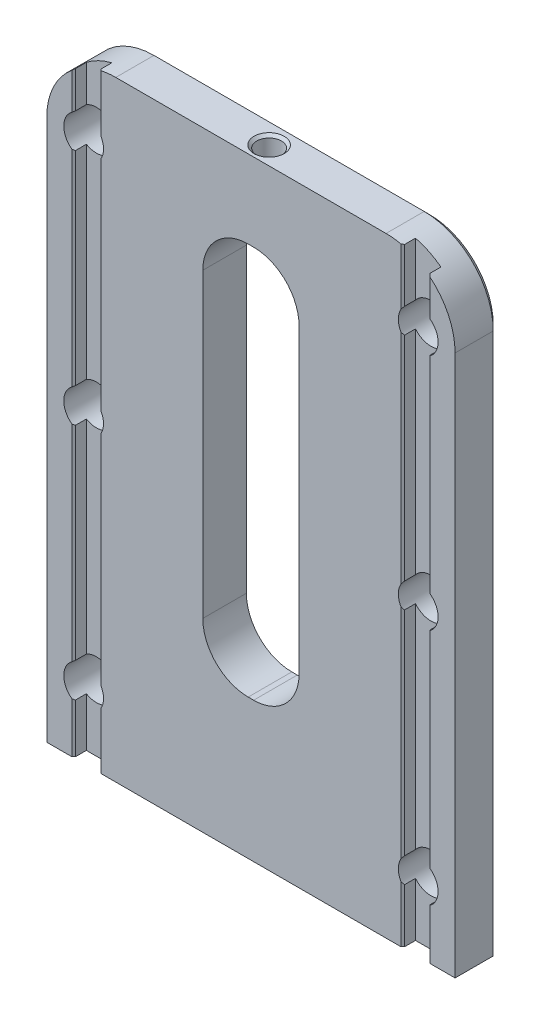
ISO-10303-21;
HEADER;
FILE_DESCRIPTION(('STEP AP214'),'2;1');
FILE_NAME('part.step','',(''),(''),'','','');
FILE_SCHEMA(('AUTOMOTIVE_DESIGN { 1 0 10303 214 1 1 1 1 }'));
ENDSEC;
DATA;
#1=APPLICATION_CONTEXT('core data for automotive mechanical design processes');
#2=APPLICATION_PROTOCOL_DEFINITION('international standard','automotive_design',2000,#1);
#3=PRODUCT_CONTEXT('',#1,'mechanical');
#4=PRODUCT('Part','Part','',(#3));
#5=PRODUCT_RELATED_PRODUCT_CATEGORY('part','',(#4));
#6=PRODUCT_DEFINITION_FORMATION('','',#4);
#7=PRODUCT_DEFINITION_CONTEXT('part definition',#1,'design');
#8=PRODUCT_DEFINITION('design','',#6,#7);
#9=PRODUCT_DEFINITION_SHAPE('','',#8);
#10=(LENGTH_UNIT() NAMED_UNIT(*) SI_UNIT(.MILLI.,.METRE.));
#11=(NAMED_UNIT(*) PLANE_ANGLE_UNIT() SI_UNIT($,.RADIAN.));
#12=(NAMED_UNIT(*) SI_UNIT($,.STERADIAN.) SOLID_ANGLE_UNIT());
#13=UNCERTAINTY_MEASURE_WITH_UNIT(LENGTH_MEASURE(1.E-05),#10,'distance_accuracy_value','');
#14=(GEOMETRIC_REPRESENTATION_CONTEXT(3) GLOBAL_UNCERTAINTY_ASSIGNED_CONTEXT((#13)) GLOBAL_UNIT_ASSIGNED_CONTEXT((#10,
#11,#12)) REPRESENTATION_CONTEXT('',''));
#15=CARTESIAN_POINT('',(0.,0.,0.));
#16=DIRECTION('',(0.,0.,1.));
#17=DIRECTION('',(1.,0.,0.));
#18=AXIS2_PLACEMENT_3D('',#15,#16,#17);
#19=CARTESIAN_POINT('',(-6.731,74.676,-176.297222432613));
#20=DIRECTION('',(0.,-1.,0.));
#21=DIRECTION('',(0.,0.,-1.));
#22=AXIS2_PLACEMENT_3D('',#19,#20,#21);
#23=PLANE('',#22);
#24=DIRECTION('',(0.,0.,1.));
#25=VECTOR('',#24,1.);
#26=CARTESIAN_POINT('',(0.381,74.676,-16.256));
#27=LINE('',#26,#25);
#28=CARTESIAN_POINT('',(0.381,74.676,-17.1113460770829));
#29=VERTEX_POINT('',#28);
#30=CARTESIAN_POINT('',(0.381,74.676,-16.7483440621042));
#31=VERTEX_POINT('',#30);
#32=EDGE_CURVE('E985',#29,#31,#27,.T.);
#33=ORIENTED_EDGE('',*,*,#32,.T.);
#34=CARTESIAN_POINT('',(0.,74.676,-18.796));
#35=DIRECTION('',(0.,-1.,0.));
#36=DIRECTION('',(0.,0.,-1.));
#37=AXIS2_PLACEMENT_3D('',#34,#35,#36);
#38=CIRCLE('',#37,2.0828);
#39=CARTESIAN_POINT('',(-0.381,74.676,-16.7483440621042));
#40=VERTEX_POINT('',#39);
#41=EDGE_CURVE('E951',#31,#40,#38,.T.);
#42=ORIENTED_EDGE('',*,*,#41,.T.);
#43=DIRECTION('',(0.,0.,1.));
#44=VECTOR('',#43,1.);
#45=CARTESIAN_POINT('',(-0.381,74.676,-22.352));
#46=LINE('',#45,#44);
#47=CARTESIAN_POINT('',(-0.381,74.676,-17.1113460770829));
#48=VERTEX_POINT('',#47);
#49=EDGE_CURVE('E982',#40,#48,#46,.F.);
#50=ORIENTED_EDGE('',*,*,#49,.T.);
#51=CARTESIAN_POINT('',(0.,74.676,-18.796));
#52=DIRECTION('',(0.,-1.,0.));
#53=DIRECTION('',(0.,0.,-1.));
#54=AXIS2_PLACEMENT_3D('',#51,#52,#53);
#55=CIRCLE('',#54,1.7272);
#56=EDGE_CURVE('E908',#48,#29,#55,.F.);
#57=ORIENTED_EDGE('',*,*,#56,.T.);
#58=EDGE_LOOP('',(#33,#42,#50,#57));
#59=FACE_BOUND('',#58,.T.);
#60=ADVANCED_FACE('F16',(#59),#23,.T.);
#61=CARTESIAN_POINT('',(-0.381000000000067,74.676,-20.4806539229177));
#62=VERTEX_POINT('',#61);
#63=CARTESIAN_POINT('',(-0.381,74.676,-20.8436559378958));
#64=VERTEX_POINT('',#63);
#65=EDGE_CURVE('E992',#62,#64,#46,.F.);
#66=ORIENTED_EDGE('',*,*,#65,.T.);
#67=CARTESIAN_POINT('',(0.,74.676,-18.796));
#68=DIRECTION('',(0.,-1.,0.));
#69=DIRECTION('',(0.,0.,-1.));
#70=AXIS2_PLACEMENT_3D('',#67,#68,#69);
#71=CIRCLE('',#70,2.0828);
#72=CARTESIAN_POINT('',(0.381,74.676,-20.8436559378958));
#73=VERTEX_POINT('',#72);
#74=EDGE_CURVE('E972',#64,#73,#71,.T.);
#75=ORIENTED_EDGE('',*,*,#74,.T.);
#76=CARTESIAN_POINT('',(0.381,74.676,-20.4806539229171));
#77=VERTEX_POINT('',#76);
#78=EDGE_CURVE('E1241',#73,#77,#27,.T.);
#79=ORIENTED_EDGE('',*,*,#78,.T.);
#80=EDGE_CURVE('E909',#77,#62,#55,.F.);
#81=ORIENTED_EDGE('',*,*,#80,.T.);
#82=EDGE_LOOP('',(#66,#75,#79,#81));
#83=FACE_BOUND('',#82,.T.);
#84=ADVANCED_FACE('F918',(#83),#23,.T.);
#85=CARTESIAN_POINT('',(0.381,68.326,-176.297222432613));
#86=DIRECTION('',(0.,0.,-1.));
#87=DIRECTION('',(-1.,0.,0.));
#88=AXIS2_PLACEMENT_3D('',#85,#86,#87);
#89=CYLINDRICAL_SURFACE('',#88,6.35);
#90=CARTESIAN_POINT('',(0.381,74.676,-16.7483440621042));
#91=CARTESIAN_POINT('',(0.437529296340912,74.6760039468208,-16.7588611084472));
#92=CARTESIAN_POINT('',(0.493592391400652,74.6752443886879,-16.7717171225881));
#93=CARTESIAN_POINT('',(0.604417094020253,74.6723098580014,-16.8019998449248));
#94=CARTESIAN_POINT('',(0.659179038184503,74.670135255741,-16.8194253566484));
#95=CARTESIAN_POINT('',(0.820665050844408,74.6616733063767,-16.878281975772));
#96=CARTESIAN_POINT('',(0.924948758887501,74.6534464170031,-16.9263606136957));
#97=CARTESIAN_POINT('',(1.12383473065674,74.6331959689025,-17.0386972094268));
#98=CARTESIAN_POINT('',(1.21844127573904,74.6211740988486,-17.1029479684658));
#99=CARTESIAN_POINT('',(1.39576017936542,74.5950349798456,-17.24587856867));
#100=CARTESIAN_POINT('',(1.47846856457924,74.5809170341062,-17.3245632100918));
#101=CARTESIAN_POINT('',(1.63195248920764,74.5520654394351,-17.4966041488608));
#102=CARTESIAN_POINT('',(1.70235174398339,74.5373254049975,-17.5902952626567));
#103=CARTESIAN_POINT('',(1.82659794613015,74.5095924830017,-17.7883955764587));
#104=CARTESIAN_POINT('',(1.88043621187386,74.4966005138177,-17.8928103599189));
#105=CARTESIAN_POINT('',(1.97016756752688,74.4741058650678,-18.1101413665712));
#106=CARTESIAN_POINT('',(2.00595761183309,74.4646233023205,-18.2231022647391));
#107=CARTESIAN_POINT('',(2.0578318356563,74.4506628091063,-18.4535623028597));
#108=CARTESIAN_POINT('',(2.07396465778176,74.4461725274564,-18.5710494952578));
#109=CARTESIAN_POINT('',(2.08185563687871,74.4439705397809,-18.724004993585));
#110=CARTESIAN_POINT('',(2.08277553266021,74.4437128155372,-18.7591018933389));
#111=CARTESIAN_POINT('',(2.0827992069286,74.4437103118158,-18.7941824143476));
#112=B_SPLINE_CURVE_WITH_KNOTS('',3,(#90,#91,#92,#93,#94,#95,#96,#97,#98,#99,#100,#101,#102,
#103,#104,#105,#106,#107,#108,#109,#110,#111),.UNSPECIFIED.,.F.,.F.,(4,2,2,2,2,2,2,2,2,2,4),(0.,
0.172384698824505,0.344724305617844,0.688320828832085,1.03176467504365,1.37532294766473,
1.72802722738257,2.08091608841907,2.43579756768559,2.78979908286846,2.89507613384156),.UNSPECIFIED.);
#113=CARTESIAN_POINT('',(2.0827992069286,74.4437103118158,-18.7941824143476));
#114=VERTEX_POINT('',#113);
#115=EDGE_CURVE('E950',#31,#114,#112,.T.);
#116=ORIENTED_EDGE('',*,*,#115,.F.);
#117=ORIENTED_EDGE('',*,*,#32,.F.);
#118=CARTESIAN_POINT('',(0.,74.6645596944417,-17.0688));
#119=CARTESIAN_POINT('',(-0.0961837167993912,74.6587764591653,-17.0688026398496));
#120=CARTESIAN_POINT('',(-0.192262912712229,74.6507837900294,-17.0768619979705));
#121=CARTESIAN_POINT('',(-0.381378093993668,74.6307871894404,-17.1087006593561));
#122=CARTESIAN_POINT('',(-0.474412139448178,74.6187807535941,-17.1324897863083));
#123=CARTESIAN_POINT('',(-0.654696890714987,74.5916310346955,-17.1948521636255));
#124=CARTESIAN_POINT('',(-0.741957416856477,74.5764932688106,-17.2333995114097));
#125=CARTESIAN_POINT('',(-0.908685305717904,74.5442338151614,-17.3240893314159));
#126=CARTESIAN_POINT('',(-0.98815214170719,74.5271119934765,-17.376232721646));
#127=CARTESIAN_POINT('',(-1.13948826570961,74.4917786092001,-17.494364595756));
#128=CARTESIAN_POINT('',(-1.21108439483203,74.4735499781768,-17.5606981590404));
#129=CARTESIAN_POINT('',(-1.34222883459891,74.4380869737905,-17.7046151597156));
#130=CARTESIAN_POINT('',(-1.40177548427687,74.4208527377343,-17.7822001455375));
#131=CARTESIAN_POINT('',(-1.50774493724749,74.3888583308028,-17.9476582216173));
#132=CARTESIAN_POINT('',(-1.55400879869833,74.3741289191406,-18.0356394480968));
#133=CARTESIAN_POINT('',(-1.6309088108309,74.3489870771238,-18.2187585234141));
#134=CARTESIAN_POINT('',(-1.66155048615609,74.3385731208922,-18.3138938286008));
#135=CARTESIAN_POINT('',(-1.70508936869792,74.3236031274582,-18.5043925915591));
#136=CARTESIAN_POINT('',(-1.71867317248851,74.3188209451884,-18.5995811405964));
#137=CARTESIAN_POINT('',(-1.72984948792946,74.3148942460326,-18.7909968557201));
#138=CARTESIAN_POINT('',(-1.72744630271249,74.3157482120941,-18.8872237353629));
#139=CARTESIAN_POINT('',(-1.70718701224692,74.3228388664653,-19.0738132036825));
#140=CARTESIAN_POINT('',(-1.68996776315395,74.3288536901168,-19.1642545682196));
#141=CARTESIAN_POINT('',(-1.64155713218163,74.3453363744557,-19.3408835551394));
#142=CARTESIAN_POINT('',(-1.61036425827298,74.3558047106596,-19.4270707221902));
#143=CARTESIAN_POINT('',(-1.53433381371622,74.3803878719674,-19.5945292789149));
#144=CARTESIAN_POINT('',(-1.48926082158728,74.394564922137,-19.6756843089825));
#145=CARTESIAN_POINT('',(-1.38696984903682,74.4251496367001,-19.8294744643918));
#146=CARTESIAN_POINT('',(-1.32974859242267,74.4415579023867,-19.9021072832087));
#147=CARTESIAN_POINT('',(-1.20137305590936,74.4760590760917,-20.0407063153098));
#148=CARTESIAN_POINT('',(-1.12965535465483,74.4941952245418,-20.1061407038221));
#149=CARTESIAN_POINT('',(-0.976171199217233,74.5297719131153,-20.2241751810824));
#150=CARTESIAN_POINT('',(-0.894403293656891,74.5472123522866,-20.276773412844));
#151=CARTESIAN_POINT('',(-0.721287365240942,74.5802270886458,-20.368491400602));
#152=CARTESIAN_POINT('',(-0.629792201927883,74.5957616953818,-20.4073487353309));
#153=CARTESIAN_POINT('',(-0.441012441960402,74.623291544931,-20.4688949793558));
#154=CARTESIAN_POINT('',(-0.343729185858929,74.6352876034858,-20.4915876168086));
#155=CARTESIAN_POINT('',(-0.149334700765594,74.6545454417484,-20.5194439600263));
#156=CARTESIAN_POINT('',(-0.0523118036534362,74.6619425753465,-20.5251297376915));
#157=CARTESIAN_POINT('',(0.141543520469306,74.6722253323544,-20.520117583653));
#158=CARTESIAN_POINT('',(0.238375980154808,74.6751118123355,-20.5094227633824));
#159=CARTESIAN_POINT('',(0.425952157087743,74.6765129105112,-20.4724970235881));
#160=CARTESIAN_POINT('',(0.516791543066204,74.6751592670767,-20.446754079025));
#161=CARTESIAN_POINT('',(0.692964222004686,74.6689451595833,-20.3808865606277));
#162=CARTESIAN_POINT('',(0.778297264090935,74.6640845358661,-20.3407613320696));
#163=CARTESIAN_POINT('',(0.941784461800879,74.6517253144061,-20.2469353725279));
#164=CARTESIAN_POINT('',(1.01987933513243,74.6442070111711,-20.1931341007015));
#165=CARTESIAN_POINT('',(1.16614976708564,74.6277034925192,-20.073591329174));
#166=CARTESIAN_POINT('',(1.23432370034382,74.618718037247,-20.0078478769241));
#167=CARTESIAN_POINT('',(1.36067042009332,74.6003076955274,-19.8642597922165));
#168=CARTESIAN_POINT('',(1.41853210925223,74.590877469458,-19.7861417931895));
#169=CARTESIAN_POINT('',(1.5204031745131,74.5731548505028,-19.6212200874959));
#170=CARTESIAN_POINT('',(1.56441231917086,74.5648624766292,-19.5344162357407));
#171=CARTESIAN_POINT('',(1.63743543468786,74.5505697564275,-19.3541370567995));
#172=CARTESIAN_POINT('',(1.66639164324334,74.5445782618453,-19.2606375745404));
#173=CARTESIAN_POINT('',(1.70812496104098,74.5358068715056,-19.0699536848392));
#174=CARTESIAN_POINT('',(1.72090465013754,74.5330264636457,-18.972769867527));
#175=CARTESIAN_POINT('',(1.72977132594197,74.5311055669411,-18.7796002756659));
#176=CARTESIAN_POINT('',(1.72619342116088,74.5318920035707,-18.6836304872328));
#177=CARTESIAN_POINT('',(1.70322696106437,74.5368252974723,-18.4936946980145));
#178=CARTESIAN_POINT('',(1.68383860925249,74.5409721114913,-18.3997286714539));
#179=CARTESIAN_POINT('',(1.63001338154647,74.5520106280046,-18.2169433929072));
#180=CARTESIAN_POINT('',(1.59565779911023,74.5588874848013,-18.1280992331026));
#181=CARTESIAN_POINT('',(1.51291924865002,74.574441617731,-17.957372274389));
#182=CARTESIAN_POINT('',(1.46453457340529,74.5831191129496,-17.8754903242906));
#183=CARTESIAN_POINT('',(1.35396787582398,74.6012708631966,-17.7192799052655));
#184=CARTESIAN_POINT('',(1.29153348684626,74.6107574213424,-17.6451314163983));
#185=CARTESIAN_POINT('',(1.15509506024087,74.6290154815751,-17.5082443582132));
#186=CARTESIAN_POINT('',(1.08108917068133,74.6377868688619,-17.4455076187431));
#187=CARTESIAN_POINT('',(0.922810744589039,74.6533462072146,-17.3327288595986));
#188=CARTESIAN_POINT('',(0.838456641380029,74.6601167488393,-17.2827987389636));
#189=CARTESIAN_POINT('',(0.662390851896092,74.6703730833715,-17.1978773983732));
#190=CARTESIAN_POINT('',(0.570684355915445,74.6738611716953,-17.1628757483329));
#191=CARTESIAN_POINT('',(0.39927072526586,74.6764467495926,-17.1136512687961));
#192=CARTESIAN_POINT('',(0.320303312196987,74.67621063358,-17.0968510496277));
#193=CARTESIAN_POINT('',(0.160866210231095,74.6726840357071,-17.0744245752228));
#194=CARTESIAN_POINT('',(0.080396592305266,74.6693936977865,-17.0687977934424));
#195=CARTESIAN_POINT('',(0.,74.6645596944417,-17.0688));
#196=B_SPLINE_CURVE_WITH_KNOTS('',3,(#118,#119,#120,#121,#122,#123,#124,#125,#126,#127,#128,
#129,#130,#131,#132,#133,#134,#135,#136,#137,#138,#139,#140,#141,#142,#143,#144,#145,#146,#147,
#148,#149,#150,#151,#152,#153,#154,#155,#156,#157,#158,#159,#160,#161,#162,#163,#164,#165,#166,
#167,#168,#169,#170,#171,#172,#173,#174,#175,#176,#177,#178,#179,#180,#181,#182,#183,#184,#185,
#186,#187,#188,#189,#190,#191,#192,#193,#194,#195),.UNSPECIFIED.,.T.,.F.,(4,2,2,2,2,2,2,2,2,2,2,
2,2,2,2,2,2,2,2,2,2,2,2,2,2,2,2,2,2,2,2,2,2,2,2,2,2,2,4),(0.,0.288771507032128,
0.577723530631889,0.866170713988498,1.15463737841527,1.45113618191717,1.74767582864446,
2.04762859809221,2.34747521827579,2.63481952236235,2.92208648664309,3.19758933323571,
3.47312160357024,3.75361176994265,4.03417767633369,4.32911038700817,4.62408573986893,
4.92442371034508,5.22469238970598,5.51564375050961,5.80653985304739,6.08848861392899,
6.37045021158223,6.65454786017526,6.93869200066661,7.23032819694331,7.52196926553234,
7.81472133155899,8.10742670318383,8.39416277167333,8.68089514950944,8.96608920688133,
9.25131798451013,9.54214985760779,9.83302832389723,10.1263678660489,10.4195021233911,
10.6608874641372,10.9022614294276),.UNSPECIFIED.);
#197=EDGE_CURVE('E852',#77,#29,#196,.T.);
#198=ORIENTED_EDGE('',*,*,#197,.F.);
#199=ORIENTED_EDGE('',*,*,#78,.F.);
#200=CARTESIAN_POINT('',(2.0828,74.4437100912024,-18.796));
#201=CARTESIAN_POINT('',(2.08280089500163,74.4437049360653,-18.853549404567));
#202=CARTESIAN_POINT('',(2.08041328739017,74.4443745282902,-18.9110700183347));
#203=CARTESIAN_POINT('',(2.07089655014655,74.447011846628,-19.0256762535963));
#204=CARTESIAN_POINT('',(2.06376837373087,74.4489793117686,-19.0827619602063));
#205=CARTESIAN_POINT('',(2.03538265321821,74.4567361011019,-19.2524893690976));
#206=CARTESIAN_POINT('',(2.00712340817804,74.4643804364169,-19.363957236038));
#207=CARTESIAN_POINT('',(1.93286325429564,74.4835701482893,-19.5803476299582));
#208=CARTESIAN_POINT('',(1.88686591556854,74.4951147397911,-19.6852714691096));
#209=CARTESIAN_POINT('',(1.77847473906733,74.5205664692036,-19.8859963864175));
#210=CARTESIAN_POINT('',(1.7160764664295,74.5344742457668,-19.981794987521));
#211=CARTESIAN_POINT('',(1.57490770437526,74.5631772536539,-20.163957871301));
#212=CARTESIAN_POINT('',(1.49579128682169,74.5779855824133,-20.2500520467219));
#213=CARTESIAN_POINT('',(1.3240868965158,74.6061785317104,-20.4079731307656));
#214=CARTESIAN_POINT('',(1.23149081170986,74.6195622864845,-20.4797913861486));
#215=CARTESIAN_POINT('',(1.03435029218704,74.6430865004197,-20.6076612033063));
#216=CARTESIAN_POINT('',(0.929701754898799,74.6531953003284,-20.6635582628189));
#217=CARTESIAN_POINT('',(0.712296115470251,74.668279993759,-20.7567659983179));
#218=CARTESIAN_POINT('',(0.599560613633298,74.6732690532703,-20.7941242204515));
#219=CARTESIAN_POINT('',(0.450233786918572,74.6757185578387,-20.8298659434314));
#220=CARTESIAN_POINT('',(0.415691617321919,74.6760051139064,-20.8372082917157));
#221=CARTESIAN_POINT('',(0.380999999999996,74.676,-20.8436559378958));
#222=B_SPLINE_CURVE_WITH_KNOTS('',3,(#200,#201,#202,#203,#204,#205,#206,#207,#208,#209,#210,
#211,#212,#213,#214,#215,#216,#217,#218,#219,#220,#221),.UNSPECIFIED.,.F.,.F.,(4,2,2,2,2,2,2,2,
2,2,4),(0.,0.172538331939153,0.345041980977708,0.688995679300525,1.03288018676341,
1.37685777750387,1.72880742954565,2.08096976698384,2.43644139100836,2.79099657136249,
2.89688792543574),.UNSPECIFIED.);
#223=CARTESIAN_POINT('',(2.0828,74.4437100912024,-18.796));
#224=VERTEX_POINT('',#223);
#225=EDGE_CURVE('E943',#224,#73,#222,.T.);
#226=ORIENTED_EDGE('',*,*,#225,.F.);
#227=CARTESIAN_POINT('',(0.381,68.326,-18.796));
#228=DIRECTION('',(0.,0.,1.));
#229=DIRECTION('',(1.,0.,0.));
#230=AXIS2_PLACEMENT_3D('',#227,#228,#229);
#231=CIRCLE('',#230,6.35);
#232=CARTESIAN_POINT('',(2.083054,74.4436394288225,-18.796));
#233=VERTEX_POINT('',#232);
#234=EDGE_CURVE('E1285',#233,#224,#231,.T.);
#235=ORIENTED_EDGE('',*,*,#234,.F.);
#236=CARTESIAN_POINT('',(2.083054,74.4436394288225,-18.796));
#237=CARTESIAN_POINT('',(2.08305489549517,74.4436342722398,-18.8535560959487));
#238=CARTESIAN_POINT('',(2.08066702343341,74.4443040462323,-18.9110833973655));
#239=CARTESIAN_POINT('',(2.07114923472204,74.4469420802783,-19.0257029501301));
#240=CARTESIAN_POINT('',(2.06402027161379,74.4489100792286,-19.0827952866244));
#241=CARTESIAN_POINT('',(2.03563143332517,74.4566689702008,-19.2525423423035));
#242=CARTESIAN_POINT('',(2.00736909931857,74.4643153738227,-19.3640230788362));
#243=CARTESIAN_POINT('',(1.93310089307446,74.4835102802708,-19.5804384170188));
#244=CARTESIAN_POINT('',(1.88709859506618,74.4950579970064,-19.685374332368));
#245=CARTESIAN_POINT('',(1.7786957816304,74.5205166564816,-19.8861224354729));
#246=CARTESIAN_POINT('',(1.71629082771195,74.5344282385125,-19.98193214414));
#247=CARTESIAN_POINT('',(1.57510646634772,74.5631393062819,-20.1641169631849));
#248=CARTESIAN_POINT('',(1.49598098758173,74.5779518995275,-20.2502218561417));
#249=CARTESIAN_POINT('',(1.32425679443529,74.6061531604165,-20.4081627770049));
#250=CARTESIAN_POINT('',(1.23164996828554,74.6195409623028,-20.4799901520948));
#251=CARTESIAN_POINT('',(1.03448596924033,74.6430726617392,-20.6078767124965));
#252=CARTESIAN_POINT('',(0.929824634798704,74.6531848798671,-20.6637813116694));
#253=CARTESIAN_POINT('',(0.712392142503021,74.6682752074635,-20.7570018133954));
#254=CARTESIAN_POINT('',(0.599642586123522,74.6732664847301,-20.7943652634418));
#255=CARTESIAN_POINT('',(0.450279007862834,74.6757181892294,-20.8301164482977));
#256=CARTESIAN_POINT('',(0.415714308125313,74.6760051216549,-20.8374632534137));
#257=CARTESIAN_POINT('',(0.381,74.676,-20.8439142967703));
#258=B_SPLINE_CURVE_WITH_KNOTS('',3,(#236,#237,#238,#239,#240,#241,#242,#243,#244,#245,#246,
#247,#248,#249,#250,#251,#252,#253,#254,#255,#256,#257),.UNSPECIFIED.,.F.,.F.,(4,2,2,2,2,2,2,2,
2,2,4),(0.,0.172558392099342,0.345082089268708,0.689075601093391,1.03299984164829,
1.37701724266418,1.72901005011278,2.08121553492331,2.43673213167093,2.79133225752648,
2.89729242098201),.UNSPECIFIED.);
#259=CARTESIAN_POINT('',(0.381,74.676,-20.8439142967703));
#260=VERTEX_POINT('',#259);
#261=EDGE_CURVE('E928',#233,#260,#258,.T.);
#262=ORIENTED_EDGE('',*,*,#261,.T.);
#263=CARTESIAN_POINT('',(0.381,74.676,-22.352));
#264=VERTEX_POINT('',#263);
#265=EDGE_CURVE('E1242',#264,#260,#27,.T.);
#266=ORIENTED_EDGE('',*,*,#265,.F.);
#267=CARTESIAN_POINT('',(0.381,68.326,-22.352));
#268=DIRECTION('',(0.,0.,-1.));
#269=DIRECTION('',(-1.,0.,0.));
#270=AXIS2_PLACEMENT_3D('',#267,#268,#269);
#271=CIRCLE('',#270,6.35);
#272=CARTESIAN_POINT('',(6.731,68.326,-22.352));
#273=VERTEX_POINT('',#272);
#274=EDGE_CURVE('E1256',#273,#264,#271,.F.);
#275=ORIENTED_EDGE('',*,*,#274,.F.);
#276=DIRECTION('',(0.,0.,1.));
#277=VECTOR('',#276,1.);
#278=CARTESIAN_POINT('',(6.731,68.326,-22.352));
#279=LINE('',#278,#277);
#280=CARTESIAN_POINT('',(6.731,68.326,-16.256));
#281=VERTEX_POINT('',#280);
#282=EDGE_CURVE('E1006',#281,#273,#279,.F.);
#283=ORIENTED_EDGE('',*,*,#282,.F.);
#284=CARTESIAN_POINT('',(0.381,68.326,-16.256));
#285=DIRECTION('',(0.,0.,1.));
#286=DIRECTION('',(1.,0.,0.));
#287=AXIS2_PLACEMENT_3D('',#284,#285,#286);
#288=CIRCLE('',#287,6.35);
#289=CARTESIAN_POINT('',(0.381,74.676,-16.256));
#290=VERTEX_POINT('',#289);
#291=EDGE_CURVE('E1240',#290,#281,#288,.F.);
#292=ORIENTED_EDGE('',*,*,#291,.F.);
#293=CARTESIAN_POINT('',(0.381,74.676,-16.7480857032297));
#294=VERTEX_POINT('',#293);
#295=EDGE_CURVE('E996',#294,#290,#27,.T.);
#296=ORIENTED_EDGE('',*,*,#295,.F.);
#297=CARTESIAN_POINT('',(0.381,74.676,-16.7480857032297));
#298=CARTESIAN_POINT('',(0.437536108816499,74.6760039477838,-16.758602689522));
#299=CARTESIAN_POINT('',(0.49360601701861,74.6752442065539,-16.7714589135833));
#300=CARTESIAN_POINT('',(0.604444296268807,74.6723089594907,-16.8017425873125));
#301=CARTESIAN_POINT('',(0.659213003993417,74.6701338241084,-16.8191688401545));
#302=CARTESIAN_POINT('',(0.820719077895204,74.6616697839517,-16.8780284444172));
#303=CARTESIAN_POINT('',(0.925015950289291,74.6534408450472,-16.9261100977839));
#304=CARTESIAN_POINT('',(1.12392749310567,74.6331852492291,-17.038454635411));
#305=CARTESIAN_POINT('',(1.21854644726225,74.6211602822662,-17.102710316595));
#306=CARTESIAN_POINT('',(1.39588923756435,74.5950142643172,-17.2456525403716));
#307=CARTESIAN_POINT('',(1.47860909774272,74.5808925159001,-17.3243438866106));
#308=CARTESIAN_POINT('',(1.63211565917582,74.5520328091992,-17.4964006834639));
#309=CARTESIAN_POINT('',(1.70252594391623,74.5372884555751,-17.5901010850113));
#310=CARTESIAN_POINT('',(1.8267925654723,74.50954709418,-17.7882217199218));
#311=CARTESIAN_POINT('',(1.88064022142,74.4965510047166,-17.8926475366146));
#312=CARTESIAN_POINT('',(1.97038869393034,74.4740487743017,-18.1100026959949));
#313=CARTESIAN_POINT('',(2.00618637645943,74.4645627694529,-18.2229767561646));
#314=CARTESIAN_POINT('',(2.05807347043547,74.4505966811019,-18.4534643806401));
#315=CARTESIAN_POINT('',(2.07421152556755,74.4461042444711,-18.5709659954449));
#316=CARTESIAN_POINT('',(2.08210855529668,74.4439002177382,-18.7239590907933));
#317=CARTESIAN_POINT('',(2.08302952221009,74.4436421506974,-18.7590788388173));
#318=CARTESIAN_POINT('',(2.08305320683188,74.4436396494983,-18.7941821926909));
#319=B_SPLINE_CURVE_WITH_KNOTS('',3,(#297,#298,#299,#300,#301,#302,#303,#304,#305,#306,#307,
#308,#309,#310,#311,#312,#313,#314,#315,#316,#317,#318),.UNSPECIFIED.,.F.,.F.,(4,2,2,2,2,2,2,2,
2,2,4),(0.,0.172404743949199,0.344764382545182,0.688400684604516,1.03188421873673,
1.3754822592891,1.72822979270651,2.08116189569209,2.43608835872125,2.79013483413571,
2.89548040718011),.UNSPECIFIED.);
#320=CARTESIAN_POINT('',(2.08305320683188,74.4436396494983,-18.7941821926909));
#321=VERTEX_POINT('',#320);
#322=EDGE_CURVE('E936',#294,#321,#319,.T.);
#323=ORIENTED_EDGE('',*,*,#322,.T.);
#324=CARTESIAN_POINT('',(0.381,68.326,-18.7956675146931));
#325=DIRECTION('',(-0.000872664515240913,0.,0.99999961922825));
#326=DIRECTION('',(-0.99999961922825,0.,-0.000872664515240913));
#327=AXIS2_PLACEMENT_3D('',#324,#325,#326);
#328=ELLIPSE('',#327,6.35000241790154,6.35);
#329=EDGE_CURVE('E497',#114,#321,#328,.F.);
#330=ORIENTED_EDGE('',*,*,#329,.F.);
#331=EDGE_LOOP('',(#116,#117,#198,#199,#226,#235,#262,#266,#275,#283,#292,#296,#323,#330));
#332=FACE_BOUND('',#331,.T.);
#333=ADVANCED_FACE('F913',(#332),#89,.F.);
#334=CARTESIAN_POINT('',(-0.381,68.326,-176.297222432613));
#335=DIRECTION('',(0.,0.,-1.));
#336=DIRECTION('',(-1.,0.,0.));
#337=AXIS2_PLACEMENT_3D('',#334,#335,#336);
#338=CYLINDRICAL_SURFACE('',#337,6.35);
#339=CARTESIAN_POINT('',(-0.381,74.676,-20.8436559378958));
#340=CARTESIAN_POINT('',(-0.43753081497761,74.6760039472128,-20.8331386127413));
#341=CARTESIAN_POINT('',(-0.493595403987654,74.675244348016,-20.8202821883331));
#342=CARTESIAN_POINT('',(-0.604423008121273,74.6723096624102,-20.789998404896));
#343=CARTESIAN_POINT('',(-0.659186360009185,74.6701349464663,-20.7725722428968));
#344=CARTESIAN_POINT('',(-0.820670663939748,74.6616728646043,-20.7137154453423));
#345=CARTESIAN_POINT('',(-0.924951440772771,74.6534461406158,-20.6656379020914));
#346=CARTESIAN_POINT('',(-1.12382909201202,74.6331965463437,-20.5533059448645));
#347=CARTESIAN_POINT('',(-1.21843053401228,74.6211754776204,-20.4890592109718));
#348=CARTESIAN_POINT('',(-1.39575079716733,74.5950365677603,-20.3461304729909));
#349=CARTESIAN_POINT('',(-1.47846429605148,74.5809177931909,-20.2674420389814));
#350=CARTESIAN_POINT('',(-1.63197155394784,74.5520619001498,-20.0953740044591));
#351=CARTESIAN_POINT('',(-1.70238620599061,74.5373183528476,-20.0016570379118));
#352=CARTESIAN_POINT('',(-1.82662465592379,74.5095858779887,-19.8035545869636));
#353=CARTESIAN_POINT('',(-1.88044791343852,74.4965970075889,-19.6991687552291));
#354=CARTESIAN_POINT('',(-1.97011774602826,74.4741189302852,-19.4819718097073));
#355=CARTESIAN_POINT('',(-2.00587687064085,74.4646468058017,-19.3691226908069));
#356=CARTESIAN_POINT('',(-2.05779871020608,74.4506699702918,-19.1387179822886));
#357=CARTESIAN_POINT('',(-2.07396725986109,74.4461637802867,-19.0211638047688));
#358=CARTESIAN_POINT('',(-2.0859269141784,74.4428422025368,-18.7888239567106));
#359=CARTESIAN_POINT('',(-2.0823693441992,74.443844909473,-18.6740740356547));
#360=CARTESIAN_POINT('',(-2.05651142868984,74.4509765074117,-18.4468746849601));
#361=CARTESIAN_POINT('',(-2.03421116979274,74.4571053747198,-18.3344252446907));
#362=CARTESIAN_POINT('',(-1.97192673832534,74.4735578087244,-18.1160479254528));
#363=CARTESIAN_POINT('',(-1.93211301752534,74.4838408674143,-18.0100681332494));
#364=CARTESIAN_POINT('',(-1.83603819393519,74.5072456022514,-17.8061898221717));
#365=CARTESIAN_POINT('',(-1.77977475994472,74.5203676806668,-17.7082924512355));
#366=CARTESIAN_POINT('',(-1.65031625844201,74.548205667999,-17.5200850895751));
#367=CARTESIAN_POINT('',(-1.57665073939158,74.5629583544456,-17.430104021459));
#368=CARTESIAN_POINT('',(-1.41528676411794,74.5917365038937,-17.2635286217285));
#369=CARTESIAN_POINT('',(-1.32758206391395,74.6057616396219,-17.1869402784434));
#370=CARTESIAN_POINT('',(-1.13879889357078,74.6313521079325,-17.0480979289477));
#371=CARTESIAN_POINT('',(-1.03751781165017,74.6428713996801,-16.9861107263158));
#372=CARTESIAN_POINT('',(-0.825647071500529,74.6612998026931,-16.8801893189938));
#373=CARTESIAN_POINT('',(-0.715075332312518,74.6682175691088,-16.8362212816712));
#374=CARTESIAN_POINT('',(-0.565365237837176,74.6734281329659,-16.7910403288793));
#375=CARTESIAN_POINT('',(-0.52879995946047,74.6743869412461,-16.7810889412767));
#376=CARTESIAN_POINT('',(-0.455224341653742,74.6756721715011,-16.7632055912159));
#377=CARTESIAN_POINT('',(-0.418214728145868,74.6759995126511,-16.7552707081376));
#378=CARTESIAN_POINT('',(-0.381,74.676,-16.7483440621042));
#379=B_SPLINE_CURVE_WITH_KNOTS('',3,(#339,#340,#341,#342,#343,#344,#345,#346,#347,#348,#349,
#350,#351,#352,#353,#354,#355,#356,#357,#358,#359,#360,#361,#362,#363,#364,#365,#366,#367,#368,
#369,#370,#371,#372,#373,#374,#375,#376,#377,#378),.UNSPECIFIED.,.F.,.F.,(4,2,2,2,2,2,2,2,2,2,2,
2,2,2,2,2,2,2,2,4),(0.,0.172389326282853,0.344733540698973,0.688320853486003,1.03174527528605,
1.37532297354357,1.7281138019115,2.08091611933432,2.43541040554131,2.78979908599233,
3.1325575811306,3.47531449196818,3.81480684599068,4.15434733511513,4.50440448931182,
4.85461776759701,5.21080504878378,5.56632045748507,5.67999802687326,5.79350999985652),.UNSPECIFIED.);
#380=EDGE_CURVE('E967',#64,#40,#379,.T.);
#381=ORIENTED_EDGE('',*,*,#380,.F.);
#382=ORIENTED_EDGE('',*,*,#65,.F.);
#383=CARTESIAN_POINT('',(0.,74.6645596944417,-17.0688));
#384=CARTESIAN_POINT('',(-0.0943401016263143,74.670229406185,-17.0688015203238));
#385=CARTESIAN_POINT('',(-0.188824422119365,74.673775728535,-17.0765540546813));
#386=CARTESIAN_POINT('',(-0.375331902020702,74.6766831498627,-17.1074249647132));
#387=CARTESIAN_POINT('',(-0.467354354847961,74.6760430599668,-17.1305477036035));
#388=CARTESIAN_POINT('',(-0.646208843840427,74.6710899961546,-17.1914589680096));
#389=CARTESIAN_POINT('',(-0.733045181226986,74.6667801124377,-17.2292351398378));
#390=CARTESIAN_POINT('',(-0.899249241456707,74.6553654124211,-17.3183446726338));
#391=CARTESIAN_POINT('',(-0.978616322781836,74.6482603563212,-17.3696791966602));
#392=CARTESIAN_POINT('',(-1.12893061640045,74.6322591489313,-17.4853284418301));
#393=CARTESIAN_POINT('',(-1.1997365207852,74.6233381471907,-17.5498232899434));
#394=CARTESIAN_POINT('',(-1.3297222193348,74.6050718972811,-17.6895786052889));
#395=CARTESIAN_POINT('',(-1.3889005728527,74.595726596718,-17.7648404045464));
#396=CARTESIAN_POINT('',(-1.49518250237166,74.5777255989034,-17.9258579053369));
#397=CARTESIAN_POINT('',(-1.54200550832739,74.5690885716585,-18.0118012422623));
#398=CARTESIAN_POINT('',(-1.62053467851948,74.553974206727,-18.1905157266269));
#399=CARTESIAN_POINT('',(-1.65224212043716,74.5474966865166,-18.2832862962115));
#400=CARTESIAN_POINT('',(-1.69932164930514,74.5376911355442,-18.4721131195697));
#401=CARTESIAN_POINT('',(-1.71484581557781,74.5343338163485,-18.5681298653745));
#402=CARTESIAN_POINT('',(-1.72957284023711,74.5311520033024,-18.7614592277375));
#403=CARTESIAN_POINT('',(-1.72877777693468,74.5313270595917,-18.8587716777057));
#404=CARTESIAN_POINT('',(-1.71106974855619,74.535145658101,-19.0499800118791));
#405=CARTESIAN_POINT('',(-1.69446192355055,74.5387235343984,-19.1439057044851));
#406=CARTESIAN_POINT('',(-1.64609690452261,74.5487513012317,-19.327608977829));
#407=CARTESIAN_POINT('',(-1.61433871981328,74.5552013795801,-19.4173862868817));
#408=CARTESIAN_POINT('',(-1.5363303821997,74.570140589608,-19.5910049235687));
#409=CARTESIAN_POINT('',(-1.48997670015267,74.5786441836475,-19.6747984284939));
#410=CARTESIAN_POINT('',(-1.38413591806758,74.5964936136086,-19.8335407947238));
#411=CARTESIAN_POINT('',(-1.32464698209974,74.6058395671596,-19.9084884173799));
#412=CARTESIAN_POINT('',(-1.19277214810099,74.6242566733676,-20.0489891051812));
#413=CARTESIAN_POINT('',(-1.12015055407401,74.6333184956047,-20.1143224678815));
#414=CARTESIAN_POINT('',(-0.964808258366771,74.6495872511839,-20.2319153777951));
#415=CARTESIAN_POINT('',(-0.882087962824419,74.6567942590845,-20.2841754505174));
#416=CARTESIAN_POINT('',(-0.70929845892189,74.6680948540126,-20.3738266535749));
#417=CARTESIAN_POINT('',(-0.619270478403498,74.6722047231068,-20.4112950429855));
#418=CARTESIAN_POINT('',(-0.434116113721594,74.6764520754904,-20.4705766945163));
#419=CARTESIAN_POINT('',(-0.338990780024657,74.6765903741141,-20.492393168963));
#420=CARTESIAN_POINT('',(-0.149080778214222,74.6724553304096,-20.5193541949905));
#421=CARTESIAN_POINT('',(-0.0543538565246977,74.668298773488,-20.5249251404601));
#422=CARTESIAN_POINT('',(0.134450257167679,74.6557521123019,-20.5205461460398));
#423=CARTESIAN_POINT('',(0.22852746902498,74.6473621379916,-20.5105966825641));
#424=CARTESIAN_POINT('',(0.412962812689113,74.6268490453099,-20.47571764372));
#425=CARTESIAN_POINT('',(0.50333626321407,74.6147435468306,-20.4508582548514));
#426=CARTESIAN_POINT('',(0.678508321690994,74.5876137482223,-20.3870811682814));
#427=CARTESIAN_POINT('',(0.763305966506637,74.5725889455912,-20.348161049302));
#428=CARTESIAN_POINT('',(0.927897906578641,74.5402215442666,-20.2559341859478));
#429=CARTESIAN_POINT('',(1.0074442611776,74.5228200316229,-20.2022057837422));
#430=CARTESIAN_POINT('',(1.15651812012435,74.4875271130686,-20.0824037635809));
#431=CARTESIAN_POINT('',(1.22604309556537,74.4696355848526,-20.016327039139));
#432=CARTESIAN_POINT('',(1.35529775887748,74.4343877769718,-19.8712267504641));
#433=CARTESIAN_POINT('',(1.41466146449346,74.4170647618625,-19.7918681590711));
#434=CARTESIAN_POINT('',(1.51915807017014,74.3852816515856,-19.6237497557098));
#435=CARTESIAN_POINT('',(1.56429280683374,74.3708211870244,-19.5349911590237));
#436=CARTESIAN_POINT('',(1.63808580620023,74.346571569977,-19.3522517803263));
#437=CARTESIAN_POINT('',(1.66704170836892,74.3366986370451,-19.2584027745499));
#438=CARTESIAN_POINT('',(1.708656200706,74.3223599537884,-19.0667704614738));
#439=CARTESIAN_POINT('',(1.72132153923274,74.317891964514,-18.9689888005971));
#440=CARTESIAN_POINT('',(1.7296180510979,74.3149736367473,-18.7776732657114));
#441=CARTESIAN_POINT('',(1.72609166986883,74.316225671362,-18.684179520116));
#442=CARTESIAN_POINT('',(1.70405570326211,74.3239310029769,-18.4992028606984));
#443=CARTESIAN_POINT('',(1.685546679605,74.3303841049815,-18.407719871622));
#444=CARTESIAN_POINT('',(1.63453467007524,74.3476963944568,-18.2303722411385));
#445=CARTESIAN_POINT('',(1.60219719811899,74.3585033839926,-18.1444545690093));
#446=CARTESIAN_POINT('',(1.52459719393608,74.3834626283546,-17.9792007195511));
#447=CARTESIAN_POINT('',(1.47933204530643,74.3976155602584,-17.8998658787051));
#448=CARTESIAN_POINT('',(1.37487577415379,74.4286624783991,-17.7462685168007));
#449=CARTESIAN_POINT('',(1.31516098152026,74.4456494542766,-17.6723810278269));
#450=CARTESIAN_POINT('',(1.18454678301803,74.4803581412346,-17.5354334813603));
#451=CARTESIAN_POINT('',(1.11364362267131,74.4980800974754,-17.472377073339));
#452=CARTESIAN_POINT('',(0.959292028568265,74.5334654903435,-17.356322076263));
#453=CARTESIAN_POINT('',(0.875452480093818,74.5510976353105,-17.3038327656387));
#454=CARTESIAN_POINT('',(0.699699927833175,74.5839996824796,-17.2137934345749));
#455=CARTESIAN_POINT('',(0.607790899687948,74.5992707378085,-17.1762361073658));
#456=CARTESIAN_POINT('',(0.430524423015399,74.6244837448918,-17.1210804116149));
#457=CARTESIAN_POINT('',(0.345826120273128,74.6348569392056,-17.1015475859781));
#458=CARTESIAN_POINT('',(0.174125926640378,74.6522765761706,-17.0754078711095));
#459=CARTESIAN_POINT('',(0.0871244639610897,74.6593236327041,-17.0687985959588));
#460=CARTESIAN_POINT('',(0.,74.6645596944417,-17.0688));
#461=B_SPLINE_CURVE_WITH_KNOTS('',3,(#383,#384,#385,#386,#387,#388,#389,#390,#391,#392,#393,
#394,#395,#396,#397,#398,#399,#400,#401,#402,#403,#404,#405,#406,#407,#408,#409,#410,#411,#412,
#413,#414,#415,#416,#417,#418,#419,#420,#421,#422,#423,#424,#425,#426,#427,#428,#429,#430,#431,
#432,#433,#434,#435,#436,#437,#438,#439,#440,#441,#442,#443,#444,#445,#446,#447,#448,#449,#450,
#451,#452,#453,#454,#455,#456,#457,#458,#459,#460),.UNSPECIFIED.,.T.,.F.,(4,2,2,2,2,2,2,2,2,2,2,
2,2,2,2,2,2,2,2,2,2,2,2,2,2,2,2,2,2,2,2,2,2,2,2,2,2,2,4),(0.,0.283217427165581,
0.566515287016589,0.849574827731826,1.13265865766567,1.41991396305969,1.70720483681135,
2.00054661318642,2.29386358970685,2.58439862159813,2.87489665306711,3.15990017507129,
3.44492233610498,3.73201358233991,4.01914498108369,4.31206142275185,4.60496608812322,
4.89631996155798,5.18761402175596,5.47119050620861,5.75475828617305,6.03700157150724,
6.31929348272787,6.61064579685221,6.90207150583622,7.20243860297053,7.50276691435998,
7.79737107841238,8.0918531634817,8.3711923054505,8.65052097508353,8.92659600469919,
9.20272694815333,9.49096770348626,9.77930539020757,10.0792923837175,10.3791324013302,
10.6407361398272,10.9022915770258),.UNSPECIFIED.);
#462=EDGE_CURVE('E740',#48,#62,#461,.T.);
#463=ORIENTED_EDGE('',*,*,#462,.F.);
#464=ORIENTED_EDGE('',*,*,#49,.F.);
#465=EDGE_LOOP('',(#381,#382,#463,#464));
#466=FACE_BOUND('',#465,.T.);
#467=ADVANCED_FACE('F917',(#466),#338,.F.);
#468=CARTESIAN_POINT('',(0.,85.598,-18.796));
#469=DIRECTION('',(0.,1.,0.));
#470=DIRECTION('',(0.,0.,1.));
#471=AXIS2_PLACEMENT_3D('',#468,#469,#470);
#472=CONICAL_SURFACE('',#471,2.1082,0.785398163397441);
#473=CARTESIAN_POINT('',(0.,85.598,-18.796));
#474=DIRECTION('',(0.,-1.,0.));
#475=DIRECTION('',(1.,0.,0.));
#476=AXIS2_PLACEMENT_3D('',#473,#474,#475);
#477=CIRCLE('',#476,2.1082);
#478=CARTESIAN_POINT('',(2.1082,85.598,-18.796));
#479=VERTEX_POINT('',#478);
#480=EDGE_CURVE('E504',#479,#479,#477,.T.);
#481=ORIENTED_EDGE('',*,*,#480,.F.);
#482=EDGE_LOOP('',(#481));
#483=FACE_BOUND('',#482,.T.);
#484=CARTESIAN_POINT('',(0.,85.217,-18.796));
#485=DIRECTION('',(0.,-1.,0.));
#486=DIRECTION('',(0.,0.,-1.));
#487=AXIS2_PLACEMENT_3D('',#484,#485,#486);
#488=CIRCLE('',#487,1.7272);
#489=CARTESIAN_POINT('',(0.,85.217,-20.5232));
#490=VERTEX_POINT('',#489);
#491=EDGE_CURVE('E490',#490,#490,#488,.F.);
#492=ORIENTED_EDGE('',*,*,#491,.F.);
#493=EDGE_LOOP('',(#492));
#494=FACE_BOUND('',#493,.T.);
#495=DIRECTION('',(0.707106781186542,0.707106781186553,0.));
#496=VECTOR('',#495,1.);
#497=CARTESIAN_POINT('',(0.,83.4898,-18.796));
#498=LINE('',#497,#496);
#499=CARTESIAN_POINT('',(2.083054,85.572854,-18.796));
#500=VERTEX_POINT('',#499);
#501=CARTESIAN_POINT('',(2.0828,85.5726,-18.796));
#502=VERTEX_POINT('',#501);
#503=EDGE_CURVE('E24',#500,#502,#498,.F.);
#504=ORIENTED_EDGE('',*,*,#503,.T.);
#505=CARTESIAN_POINT('',(0.,85.5726,-18.796));
#506=DIRECTION('',(0.,1.,0.));
#507=DIRECTION('',(0.,0.,1.));
#508=AXIS2_PLACEMENT_3D('',#505,#506,#507);
#509=CIRCLE('',#508,2.0828);
#510=CARTESIAN_POINT('',(2.0827992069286,85.5726,-18.7941824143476));
#511=VERTEX_POINT('',#510);
#512=EDGE_CURVE('E10',#502,#511,#509,.T.);
#513=ORIENTED_EDGE('',*,*,#512,.T.);
#514=DIRECTION('',(0.707106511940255,0.707106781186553,0.000617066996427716));
#515=VECTOR('',#514,1.);
#516=CARTESIAN_POINT('',(0.,83.4898,-18.796));
#517=LINE('',#516,#515);
#518=CARTESIAN_POINT('',(2.08305320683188,85.572854,-18.7941821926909));
#519=VERTEX_POINT('',#518);
#520=EDGE_CURVE('E489',#511,#519,#517,.T.);
#521=ORIENTED_EDGE('',*,*,#520,.T.);
#522=CARTESIAN_POINT('',(0.,85.572854,-18.796));
#523=DIRECTION('',(0.,1.,0.));
#524=DIRECTION('',(0.,0.,1.));
#525=AXIS2_PLACEMENT_3D('',#522,#523,#524);
#526=CIRCLE('',#525,2.083054);
#527=EDGE_CURVE('E481',#500,#519,#526,.T.);
#528=ORIENTED_EDGE('',*,*,#527,.F.);
#529=EDGE_LOOP('',(#504,#513,#521,#528));
#530=FACE_BOUND('',#529,.T.);
#531=ADVANCED_FACE('F499',(#483,#494,#530),#472,.F.);
#532=CARTESIAN_POINT('',(-28.5496,85.598,-22.352));
#533=DIRECTION('',(0.,0.,-1.));
#534=DIRECTION('',(-1.,0.,0.));
#535=AXIS2_PLACEMENT_3D('',#532,#533,#534);
#536=PLANE('',#535);
#537=DIRECTION('',(0.,1.,0.));
#538=VECTOR('',#537,1.);
#539=CARTESIAN_POINT('',(-27.7876,85.598,-22.352));
#540=LINE('',#539,#538);
#541=CARTESIAN_POINT('',(-27.7876,1.01599999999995,-22.352));
#542=VERTEX_POINT('',#541);
#543=CARTESIAN_POINT('',(-27.7876,75.946,-22.352));
#544=VERTEX_POINT('',#543);
#545=EDGE_CURVE('E817',#542,#544,#540,.T.);
#546=ORIENTED_EDGE('',*,*,#545,.T.);
#547=CARTESIAN_POINT('',(-18.8976,75.946,-22.352));
#548=DIRECTION('',(0.,0.,-1.));
#549=DIRECTION('',(-1.,0.,0.));
#550=AXIS2_PLACEMENT_3D('',#547,#548,#549);
#551=CIRCLE('',#550,8.89);
#552=CARTESIAN_POINT('',(-18.8976,84.836,-22.352));
#553=VERTEX_POINT('',#552);
#554=EDGE_CURVE('E808',#544,#553,#551,.T.);
#555=ORIENTED_EDGE('',*,*,#554,.T.);
#556=DIRECTION('',(1.,0.,0.));
#557=VECTOR('',#556,1.);
#558=CARTESIAN_POINT('',(18.8976,84.836,-22.352));
#559=LINE('',#558,#557);
#560=CARTESIAN_POINT('',(18.8976,84.836,-22.352));
#561=VERTEX_POINT('',#560);
#562=EDGE_CURVE('E811',#553,#561,#559,.T.);
#563=ORIENTED_EDGE('',*,*,#562,.T.);
#564=CARTESIAN_POINT('',(18.8976,75.946,-22.352));
#565=DIRECTION('',(0.,0.,-1.));
#566=DIRECTION('',(-1.,0.,0.));
#567=AXIS2_PLACEMENT_3D('',#564,#565,#566);
#568=CIRCLE('',#567,8.89);
#569=CARTESIAN_POINT('',(27.7876,75.946,-22.352));
#570=VERTEX_POINT('',#569);
#571=EDGE_CURVE('E813',#561,#570,#568,.T.);
#572=ORIENTED_EDGE('',*,*,#571,.T.);
#573=DIRECTION('',(0.,-1.,0.));
#574=VECTOR('',#573,1.);
#575=CARTESIAN_POINT('',(27.7876,85.598,-22.352));
#576=LINE('',#575,#574);
#577=CARTESIAN_POINT('',(27.7876,1.016,-22.352));
#578=VERTEX_POINT('',#577);
#579=EDGE_CURVE('E815',#570,#578,#576,.T.);
#580=ORIENTED_EDGE('',*,*,#579,.T.);
#581=DIRECTION('',(-1.,0.,0.));
#582=VECTOR('',#581,1.);
#583=CARTESIAN_POINT('',(-28.5496,1.01599999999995,-22.352));
#584=LINE('',#583,#582);
#585=EDGE_CURVE('E668',#578,#542,#584,.T.);
#586=ORIENTED_EDGE('',*,*,#585,.T.);
#587=EDGE_LOOP('',(#546,#555,#563,#572,#580,#586));
#588=FACE_BOUND('',#587,.T.);
#589=DIRECTION('',(0.,1.,0.));
#590=VECTOR('',#589,1.);
#591=CARTESIAN_POINT('',(6.731,85.598,-22.352));
#592=LINE('',#591,#590);
#593=CARTESIAN_POINT('',(6.731,26.162,-22.352));
#594=VERTEX_POINT('',#593);
#595=EDGE_CURVE('E1040',#594,#273,#592,.T.);
#596=ORIENTED_EDGE('',*,*,#595,.T.);
#597=ORIENTED_EDGE('',*,*,#274,.T.);
#598=DIRECTION('',(-1.,0.,0.));
#599=VECTOR('',#598,1.);
#600=CARTESIAN_POINT('',(-28.5496,74.676,-22.352));
#601=LINE('',#600,#599);
#602=CARTESIAN_POINT('',(-0.381,74.676,-22.352));
#603=VERTEX_POINT('',#602);
#604=EDGE_CURVE('E1038',#264,#603,#601,.T.);
#605=ORIENTED_EDGE('',*,*,#604,.T.);
#606=CARTESIAN_POINT('',(-0.381,68.326,-22.352));
#607=DIRECTION('',(0.,0.,-1.));
#608=DIRECTION('',(-1.,0.,0.));
#609=AXIS2_PLACEMENT_3D('',#606,#607,#608);
#610=CIRCLE('',#609,6.35);
#611=CARTESIAN_POINT('',(-6.731,68.326,-22.352));
#612=VERTEX_POINT('',#611);
#613=EDGE_CURVE('E683',#603,#612,#610,.F.);
#614=ORIENTED_EDGE('',*,*,#613,.T.);
#615=DIRECTION('',(0.,-1.,0.));
#616=VECTOR('',#615,1.);
#617=CARTESIAN_POINT('',(-6.731,85.598,-22.352));
#618=LINE('',#617,#616);
#619=CARTESIAN_POINT('',(-6.731,26.162,-22.352));
#620=VERTEX_POINT('',#619);
#621=EDGE_CURVE('E1035',#612,#620,#618,.T.);
#622=ORIENTED_EDGE('',*,*,#621,.T.);
#623=CARTESIAN_POINT('',(-0.381,26.162,-22.352));
#624=DIRECTION('',(0.,0.,-1.));
#625=DIRECTION('',(-1.,0.,0.));
#626=AXIS2_PLACEMENT_3D('',#623,#624,#625);
#627=CIRCLE('',#626,6.35);
#628=CARTESIAN_POINT('',(-0.381,19.812,-22.352));
#629=VERTEX_POINT('',#628);
#630=EDGE_CURVE('E1247',#620,#629,#627,.F.);
#631=ORIENTED_EDGE('',*,*,#630,.T.);
#632=DIRECTION('',(1.,0.,0.));
#633=VECTOR('',#632,1.);
#634=CARTESIAN_POINT('',(-28.5496,19.812,-22.352));
#635=LINE('',#634,#633);
#636=CARTESIAN_POINT('',(0.381,19.812,-22.352));
#637=VERTEX_POINT('',#636);
#638=EDGE_CURVE('E764',#629,#637,#635,.T.);
#639=ORIENTED_EDGE('',*,*,#638,.T.);
#640=CARTESIAN_POINT('',(0.381,26.162,-22.352));
#641=DIRECTION('',(0.,0.,-1.));
#642=DIRECTION('',(-1.,0.,0.));
#643=AXIS2_PLACEMENT_3D('',#640,#641,#642);
#644=CIRCLE('',#643,6.35);
#645=EDGE_CURVE('E1253',#637,#594,#644,.F.);
#646=ORIENTED_EDGE('',*,*,#645,.T.);
#647=EDGE_LOOP('',(#596,#597,#605,#614,#622,#631,#639,#646));
#648=FACE_BOUND('',#647,.T.);
#649=CARTESIAN_POINT('',(-23.3934,76.073,-22.352));
#650=DIRECTION('',(0.,0.,-1.));
#651=DIRECTION('',(-1.,0.,0.));
#652=AXIS2_PLACEMENT_3D('',#649,#650,#651);
#653=CIRCLE('',#652,2.778125);
#654=CARTESIAN_POINT('',(-26.171525,76.073,-22.352));
#655=VERTEX_POINT('',#654);
#656=EDGE_CURVE('E691',#655,#655,#653,.T.);
#657=ORIENTED_EDGE('',*,*,#656,.F.);
#658=EDGE_LOOP('',(#657));
#659=FACE_BOUND('',#658,.T.);
#660=CARTESIAN_POINT('',(23.3934,76.073,-22.352));
#661=DIRECTION('',(0.,0.,-1.));
#662=DIRECTION('',(-1.,0.,0.));
#663=AXIS2_PLACEMENT_3D('',#660,#661,#662);
#664=CIRCLE('',#663,2.778125);
#665=CARTESIAN_POINT('',(20.615275,76.073,-22.352));
#666=VERTEX_POINT('',#665);
#667=EDGE_CURVE('E664',#666,#666,#664,.T.);
#668=ORIENTED_EDGE('',*,*,#667,.F.);
#669=EDGE_LOOP('',(#668));
#670=FACE_BOUND('',#669,.T.);
#671=CARTESIAN_POINT('',(23.3934,9.525,-22.352));
#672=DIRECTION('',(0.,0.,-1.));
#673=DIRECTION('',(-1.,0.,0.));
#674=AXIS2_PLACEMENT_3D('',#671,#672,#673);
#675=CIRCLE('',#674,2.778125);
#676=CARTESIAN_POINT('',(20.615275,9.525,-22.352));
#677=VERTEX_POINT('',#676);
#678=EDGE_CURVE('E687',#677,#677,#675,.T.);
#679=ORIENTED_EDGE('',*,*,#678,.F.);
#680=EDGE_LOOP('',(#679));
#681=FACE_BOUND('',#680,.T.);
#682=CARTESIAN_POINT('',(-23.3934,9.525,-22.352));
#683=DIRECTION('',(0.,0.,-1.));
#684=DIRECTION('',(-1.,0.,0.));
#685=AXIS2_PLACEMENT_3D('',#682,#683,#684);
#686=CIRCLE('',#685,2.778125);
#687=CARTESIAN_POINT('',(-26.171525,9.525,-22.352));
#688=VERTEX_POINT('',#687);
#689=EDGE_CURVE('E708',#688,#688,#686,.T.);
#690=ORIENTED_EDGE('',*,*,#689,.F.);
#691=EDGE_LOOP('',(#690));
#692=FACE_BOUND('',#691,.T.);
#693=CARTESIAN_POINT('',(23.3934,42.799,-22.352));
#694=DIRECTION('',(0.,0.,-1.));
#695=DIRECTION('',(-1.,0.,0.));
#696=AXIS2_PLACEMENT_3D('',#693,#694,#695);
#697=CIRCLE('',#696,2.778125);
#698=CARTESIAN_POINT('',(20.615275,42.799,-22.352));
#699=VERTEX_POINT('',#698);
#700=EDGE_CURVE('E700',#699,#699,#697,.T.);
#701=ORIENTED_EDGE('',*,*,#700,.F.);
#702=EDGE_LOOP('',(#701));
#703=FACE_BOUND('',#702,.T.);
#704=CARTESIAN_POINT('',(-23.3934,42.799,-22.352));
#705=DIRECTION('',(0.,0.,-1.));
#706=DIRECTION('',(-1.,0.,0.));
#707=AXIS2_PLACEMENT_3D('',#704,#705,#706);
#708=CIRCLE('',#707,2.778125);
#709=CARTESIAN_POINT('',(-26.171525,42.799,-22.352));
#710=VERTEX_POINT('',#709);
#711=EDGE_CURVE('E746',#710,#710,#708,.T.);
#712=ORIENTED_EDGE('',*,*,#711,.F.);
#713=EDGE_LOOP('',(#712));
#714=FACE_BOUND('',#713,.T.);
#715=ADVANCED_FACE('F1231',(#588,#648,#659,#670,#681,#692,#703,#714),#536,.T.);
#716=CARTESIAN_POINT('',(24.7904,85.598,-16.256));
#717=DIRECTION('',(0.,-1.,0.));
#718=DIRECTION('',(1.,0.,0.));
#719=AXIS2_PLACEMENT_3D('',#716,#717,#718);
#720=PLANE('',#719);
#721=ORIENTED_EDGE('',*,*,#480,.T.);
#722=EDGE_LOOP('',(#721));
#723=FACE_BOUND('',#722,.T.);
#724=DIRECTION('',(0.,0.,-1.));
#725=VECTOR('',#724,1.);
#726=CARTESIAN_POINT('',(18.8976,85.598,-22.352));
#727=LINE('',#726,#725);
#728=CARTESIAN_POINT('',(18.8976,85.598,-16.256));
#729=VERTEX_POINT('',#728);
#730=CARTESIAN_POINT('',(18.8976,85.598,-21.59));
#731=VERTEX_POINT('',#730);
#732=EDGE_CURVE('E828',#729,#731,#727,.T.);
#733=ORIENTED_EDGE('',*,*,#732,.T.);
#734=DIRECTION('',(-1.,0.,0.));
#735=VECTOR('',#734,1.);
#736=CARTESIAN_POINT('',(-18.8976,85.598,-21.59));
#737=LINE('',#736,#735);
#738=CARTESIAN_POINT('',(-18.8976,85.598,-21.59));
#739=VERTEX_POINT('',#738);
#740=EDGE_CURVE('E803',#731,#739,#737,.T.);
#741=ORIENTED_EDGE('',*,*,#740,.T.);
#742=DIRECTION('',(0.,0.,-1.));
#743=VECTOR('',#742,1.);
#744=CARTESIAN_POINT('',(-18.8976,85.598,-16.256));
#745=LINE('',#744,#743);
#746=CARTESIAN_POINT('',(-18.8976,85.598,-16.256));
#747=VERTEX_POINT('',#746);
#748=EDGE_CURVE('E655',#739,#747,#745,.F.);
#749=ORIENTED_EDGE('',*,*,#748,.T.);
#750=DIRECTION('',(-1.,0.,0.));
#751=VECTOR('',#750,1.);
#752=CARTESIAN_POINT('',(19.812,85.598,-16.256));
#753=LINE('',#752,#751);
#754=EDGE_CURVE('E1074',#729,#747,#753,.T.);
#755=ORIENTED_EDGE('',*,*,#754,.F.);
#756=EDGE_LOOP('',(#733,#741,#749,#755));
#757=FACE_BOUND('',#756,.T.);
#758=ADVANCED_FACE('F1225',(#723,#757),#720,.F.);
#759=CARTESIAN_POINT('',(0.,74.676,-18.796));
#760=DIRECTION('',(0.,-1.,0.));
#761=DIRECTION('',(0.,0.,-1.));
#762=AXIS2_PLACEMENT_3D('',#759,#760,#761);
#763=CIRCLE('',#762,2.083054);
#764=CARTESIAN_POINT('',(-0.381,74.676,-16.7480857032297));
#765=VERTEX_POINT('',#764);
#766=EDGE_CURVE('E31',#294,#765,#763,.T.);
#767=ORIENTED_EDGE('',*,*,#766,.F.);
#768=ORIENTED_EDGE('',*,*,#295,.T.);
#769=DIRECTION('',(1.,0.,0.));
#770=VECTOR('',#769,1.);
#771=CARTESIAN_POINT('',(19.812,74.676,-16.256));
#772=LINE('',#771,#770);
#773=CARTESIAN_POINT('',(-0.381,74.676,-16.256));
#774=VERTEX_POINT('',#773);
#775=EDGE_CURVE('E1027',#774,#290,#772,.T.);
#776=ORIENTED_EDGE('',*,*,#775,.F.);
#777=EDGE_CURVE('E991',#774,#765,#46,.F.);
#778=ORIENTED_EDGE('',*,*,#777,.T.);
#779=EDGE_LOOP('',(#767,#768,#776,#778));
#780=FACE_BOUND('',#779,.T.);
#781=ADVANCED_FACE('F1217',(#780),#23,.T.);
#782=CARTESIAN_POINT('',(0.,74.676,-18.796));
#783=DIRECTION('',(0.,-1.,0.));
#784=DIRECTION('',(0.,0.,-1.));
#785=AXIS2_PLACEMENT_3D('',#782,#783,#784);
#786=CIRCLE('',#785,2.083054);
#787=CARTESIAN_POINT('',(-0.381,74.676,-20.8439142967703));
#788=VERTEX_POINT('',#787);
#789=EDGE_CURVE('E1238',#788,#260,#786,.T.);
#790=ORIENTED_EDGE('',*,*,#789,.F.);
#791=EDGE_CURVE('E994',#788,#603,#46,.F.);
#792=ORIENTED_EDGE('',*,*,#791,.T.);
#793=ORIENTED_EDGE('',*,*,#604,.F.);
#794=ORIENTED_EDGE('',*,*,#265,.T.);
#795=EDGE_LOOP('',(#790,#792,#793,#794));
#796=FACE_BOUND('',#795,.T.);
#797=ADVANCED_FACE('F1221',(#796),#23,.T.);
#798=ORIENTED_EDGE('',*,*,#791,.F.);
#799=CARTESIAN_POINT('',(-0.381,74.676,-20.8439142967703));
#800=CARTESIAN_POINT('',(-0.437537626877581,74.6760039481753,-20.8333970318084));
#801=CARTESIAN_POINT('',(-0.493609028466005,74.6752441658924,-20.8205403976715));
#802=CARTESIAN_POINT('',(-0.604450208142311,74.6723087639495,-20.7902556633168));
#803=CARTESIAN_POINT('',(-0.659220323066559,74.6701335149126,-20.7728287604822));
#804=CARTESIAN_POINT('',(-0.820724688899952,74.6616693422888,-20.7139689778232));
#805=CARTESIAN_POINT('',(-0.925018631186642,74.6534405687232,-20.6658884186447));
#806=CARTESIAN_POINT('',(-1.12392185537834,74.633185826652,-20.5535485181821));
#807=CARTESIAN_POINT('',(-1.21853570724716,74.6211616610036,-20.489296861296));
#808=CARTESIAN_POINT('',(-1.39587985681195,74.5950158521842,-20.3463564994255));
#809=CARTESIAN_POINT('',(-1.47860482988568,74.5808932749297,-20.2676613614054));
#810=CARTESIAN_POINT('',(-1.63213472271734,74.5520292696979,-20.09557747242));
#811=CARTESIAN_POINT('',(-1.70256040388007,74.5372814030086,-20.00185122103));
#812=CARTESIAN_POINT('',(-1.82681927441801,74.5095404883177,-19.803728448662));
#813=CARTESIAN_POINT('',(-1.88065192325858,74.4965474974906,-19.6993315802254));
#814=CARTESIAN_POINT('',(-1.97033886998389,74.474061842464,-19.4821104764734));
#815=CARTESIAN_POINT('',(-2.00610562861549,74.4645862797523,-19.369248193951));
#816=CARTESIAN_POINT('',(-2.058040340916,74.4506038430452,-19.1388158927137));
#817=CARTESIAN_POINT('',(-2.0742141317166,74.4460954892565,-19.0212472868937));
#818=CARTESIAN_POINT('',(-2.08618145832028,74.4427712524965,-18.7888794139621));
#819=CARTESIAN_POINT('',(-2.08262658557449,74.4437733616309,-18.6741159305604));
#820=CARTESIAN_POINT('',(-2.05677188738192,74.4509052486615,-18.4468892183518));
#821=CARTESIAN_POINT('',(-2.03447214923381,74.4570350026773,-18.3344259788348));
#822=CARTESIAN_POINT('',(-1.97218683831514,74.4734904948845,-18.1160221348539));
#823=CARTESIAN_POINT('',(-1.93237185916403,74.4837756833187,-18.0100295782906));
#824=CARTESIAN_POINT('',(-1.83629274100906,74.5071856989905,-17.8061261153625));
#825=CARTESIAN_POINT('',(-1.78002626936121,74.5203109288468,-17.7082163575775));
#826=CARTESIAN_POINT('',(-1.65055937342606,74.5481561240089,-17.5199836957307));
#827=CARTESIAN_POINT('',(-1.57688832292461,74.5629128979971,-17.4299898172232));
#828=CARTESIAN_POINT('',(-1.4155113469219,74.5916995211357,-17.2633898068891));
#829=CARTESIAN_POINT('',(-1.32779917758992,74.605729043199,-17.186789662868));
#830=CARTESIAN_POINT('',(-1.13899814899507,74.6313283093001,-17.0479240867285));
#831=CARTESIAN_POINT('',(-1.03770652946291,74.642851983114,-16.9859256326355));
#832=CARTESIAN_POINT('',(-0.825812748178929,74.6612883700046,-16.8799836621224));
#833=CARTESIAN_POINT('',(-0.715228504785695,74.6682097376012,-16.8360063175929));
#834=CARTESIAN_POINT('',(-0.565482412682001,74.6734248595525,-16.7908090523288));
#835=CARTESIAN_POINT('',(-0.528894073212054,74.6743848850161,-16.7808506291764));
#836=CARTESIAN_POINT('',(-0.455271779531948,74.675671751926,-16.7629555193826));
#837=CARTESIAN_POINT('',(-0.418238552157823,74.6759995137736,-16.7550159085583));
#838=CARTESIAN_POINT('',(-0.381,74.676,-16.7480857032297));
#839=B_SPLINE_CURVE_WITH_KNOTS('',3,(#799,#800,#801,#802,#803,#804,#805,#806,#807,#808,#809,
#810,#811,#812,#813,#814,#815,#816,#817,#818,#819,#820,#821,#822,#823,#824,#825,#826,#827,#828,
#829,#830,#831,#832,#833,#834,#835,#836,#837,#838),.UNSPECIFIED.,.F.,.F.,(4,2,2,2,2,2,2,2,2,2,2,
2,2,2,2,2,2,2,2,4),(0.,0.172409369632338,0.344773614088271,0.688400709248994,1.03186482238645,
1.3754822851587,1.72831635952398,2.0811619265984,2.43570120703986,2.79013483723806,
3.13293351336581,3.47573059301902,3.81526039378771,4.15483835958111,4.50493682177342,
4.85519140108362,5.21142408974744,5.56698498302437,5.68073483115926,5.79431896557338),.UNSPECIFIED.);
#840=EDGE_CURVE('E1268',#788,#765,#839,.T.);
#841=ORIENTED_EDGE('',*,*,#840,.T.);
#842=ORIENTED_EDGE('',*,*,#777,.F.);
#843=CARTESIAN_POINT('',(-0.381,68.326,-16.256));
#844=DIRECTION('',(0.,0.,1.));
#845=DIRECTION('',(1.,0.,0.));
#846=AXIS2_PLACEMENT_3D('',#843,#844,#845);
#847=CIRCLE('',#846,6.35);
#848=CARTESIAN_POINT('',(-6.731,68.326,-16.256));
#849=VERTEX_POINT('',#848);
#850=EDGE_CURVE('E1257',#849,#774,#847,.F.);
#851=ORIENTED_EDGE('',*,*,#850,.F.);
#852=DIRECTION('',(0.,0.,1.));
#853=VECTOR('',#852,1.);
#854=CARTESIAN_POINT('',(-6.731,68.326,-16.256));
#855=LINE('',#854,#853);
#856=EDGE_CURVE('E1016',#612,#849,#855,.T.);
#857=ORIENTED_EDGE('',*,*,#856,.F.);
#858=ORIENTED_EDGE('',*,*,#613,.F.);
#859=EDGE_LOOP('',(#798,#841,#842,#851,#857,#858));
#860=FACE_BOUND('',#859,.T.);
#861=ADVANCED_FACE('F890',(#860),#338,.F.);
#862=CARTESIAN_POINT('',(-21.2344,85.598,-16.256));
#863=DIRECTION('',(-1.,0.,0.));
#864=DIRECTION('',(0.,0.,1.));
#865=AXIS2_PLACEMENT_3D('',#862,#863,#864);
#866=PLANE('',#865);
#867=DIRECTION('',(0.,0.,1.));
#868=VECTOR('',#867,1.);
#869=CARTESIAN_POINT('',(-21.2344,11.2733413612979,-17.145));
#870=LINE('',#869,#868);
#871=CARTESIAN_POINT('',(-21.2344,11.2733413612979,-16.51));
#872=VERTEX_POINT('',#871);
#873=CARTESIAN_POINT('',(-21.2344,11.2733413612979,-18.034));
#874=VERTEX_POINT('',#873);
#875=EDGE_CURVE('E726',#872,#874,#870,.F.);
#876=ORIENTED_EDGE('',*,*,#875,.F.);
#877=DIRECTION('',(0.,1.,0.));
#878=VECTOR('',#877,1.);
#879=CARTESIAN_POINT('',(-21.2344,85.598,-16.51));
#880=LINE('',#879,#878);
#881=CARTESIAN_POINT('',(-21.2344,41.0506586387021,-16.51));
#882=VERTEX_POINT('',#881);
#883=EDGE_CURVE('E529',#872,#882,#880,.T.);
#884=ORIENTED_EDGE('',*,*,#883,.T.);
#885=DIRECTION('',(0.,0.,1.));
#886=VECTOR('',#885,1.);
#887=CARTESIAN_POINT('',(-21.2344,41.0506586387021,-17.145));
#888=LINE('',#887,#886);
#889=CARTESIAN_POINT('',(-21.2344,41.0506586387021,-18.034));
#890=VERTEX_POINT('',#889);
#891=EDGE_CURVE('E747',#890,#882,#888,.T.);
#892=ORIENTED_EDGE('',*,*,#891,.F.);
#893=DIRECTION('',(0.,-1.,0.));
#894=VECTOR('',#893,1.);
#895=CARTESIAN_POINT('',(-21.2344,85.598,-18.034));
#896=LINE('',#895,#894);
#897=EDGE_CURVE('E1050',#890,#874,#896,.T.);
#898=ORIENTED_EDGE('',*,*,#897,.T.);
#899=EDGE_LOOP('',(#876,#884,#892,#898));
#900=FACE_BOUND('',#899,.T.);
#901=ADVANCED_FACE('F1186',(#900),#866,.T.);
#902=CARTESIAN_POINT('',(-24.7904,85.598,-17.78));
#903=DIRECTION('',(1.,0.,0.));
#904=DIRECTION('',(0.,0.,-1.));
#905=AXIS2_PLACEMENT_3D('',#902,#903,#904);
#906=PLANE('',#905);
#907=DIRECTION('',(0.,0.,1.));
#908=VECTOR('',#907,1.);
#909=CARTESIAN_POINT('',(-24.7904,73.6716733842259,-17.145));
#910=LINE('',#909,#908);
#911=CARTESIAN_POINT('',(-24.7904,73.6716733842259,-16.51));
#912=VERTEX_POINT('',#911);
#913=CARTESIAN_POINT('',(-24.7904,73.6716733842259,-18.034));
#914=VERTEX_POINT('',#913);
#915=EDGE_CURVE('E772',#912,#914,#910,.F.);
#916=ORIENTED_EDGE('',*,*,#915,.F.);
#917=DIRECTION('',(0.,-1.,0.));
#918=VECTOR('',#917,1.);
#919=CARTESIAN_POINT('',(-24.7904,85.598,-16.51));
#920=LINE('',#919,#918);
#921=CARTESIAN_POINT('',(-24.7904,45.2003266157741,-16.51));
#922=VERTEX_POINT('',#921);
#923=EDGE_CURVE('E516',#912,#922,#920,.T.);
#924=ORIENTED_EDGE('',*,*,#923,.T.);
#925=DIRECTION('',(0.,0.,1.));
#926=VECTOR('',#925,1.);
#927=CARTESIAN_POINT('',(-24.7904,45.2003266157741,-17.145));
#928=LINE('',#927,#926);
#929=CARTESIAN_POINT('',(-24.7904,45.2003266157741,-18.034));
#930=VERTEX_POINT('',#929);
#931=EDGE_CURVE('E745',#930,#922,#928,.T.);
#932=ORIENTED_EDGE('',*,*,#931,.F.);
#933=DIRECTION('',(0.,-1.,0.));
#934=VECTOR('',#933,1.);
#935=CARTESIAN_POINT('',(-24.7904,85.598,-18.034));
#936=LINE('',#935,#934);
#937=EDGE_CURVE('E1053',#914,#930,#936,.T.);
#938=ORIENTED_EDGE('',*,*,#937,.F.);
#939=EDGE_LOOP('',(#916,#924,#932,#938));
#940=FACE_BOUND('',#939,.T.);
#941=ADVANCED_FACE('F1128',(#940),#906,.T.);
#942=CARTESIAN_POINT('',(-21.2344,85.598,-18.034));
#943=DIRECTION('',(0.,0.,1.));
#944=DIRECTION('',(1.,0.,0.));
#945=AXIS2_PLACEMENT_3D('',#942,#943,#944);
#946=PLANE('',#945);
#947=CARTESIAN_POINT('',(-23.3934,42.799,-18.034));
#948=DIRECTION('',(0.,0.,1.));
#949=DIRECTION('',(1.,0.,0.));
#950=AXIS2_PLACEMENT_3D('',#947,#948,#949);
#951=CIRCLE('',#950,2.778125);
#952=CARTESIAN_POINT('',(-21.2344,44.5473413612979,-18.034));
#953=VERTEX_POINT('',#952);
#954=EDGE_CURVE('E761',#953,#930,#951,.T.);
#955=ORIENTED_EDGE('',*,*,#954,.F.);
#956=CARTESIAN_POINT('',(-21.2344,74.3246586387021,-18.034));
#957=VERTEX_POINT('',#956);
#958=EDGE_CURVE('E1049',#957,#953,#896,.T.);
#959=ORIENTED_EDGE('',*,*,#958,.F.);
#960=CARTESIAN_POINT('',(-23.3934,76.073,-18.034));
#961=DIRECTION('',(0.,0.,1.));
#962=DIRECTION('',(1.,0.,0.));
#963=AXIS2_PLACEMENT_3D('',#960,#961,#962);
#964=CIRCLE('',#963,2.778125);
#965=EDGE_CURVE('E758',#914,#957,#964,.T.);
#966=ORIENTED_EDGE('',*,*,#965,.F.);
#967=ORIENTED_EDGE('',*,*,#937,.T.);
#968=EDGE_LOOP('',(#955,#959,#966,#967));
#969=FACE_BOUND('',#968,.T.);
#970=ADVANCED_FACE('F1122',(#969),#946,.T.);
#971=CARTESIAN_POINT('',(21.2344,85.598,-16.256));
#972=DIRECTION('',(-1.,0.,0.));
#973=DIRECTION('',(0.,0.,1.));
#974=AXIS2_PLACEMENT_3D('',#971,#972,#973);
#975=PLANE('',#974);
#976=DIRECTION('',(0.,0.,1.));
#977=VECTOR('',#976,1.);
#978=CARTESIAN_POINT('',(21.2344,41.0506586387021,-17.145));
#979=LINE('',#978,#977);
#980=CARTESIAN_POINT('',(21.2344,41.0506586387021,-18.034));
#981=VERTEX_POINT('',#980);
#982=CARTESIAN_POINT('',(21.2344,41.0506586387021,-16.51));
#983=VERTEX_POINT('',#982);
#984=EDGE_CURVE('E692',#981,#983,#979,.T.);
#985=ORIENTED_EDGE('',*,*,#984,.T.);
#986=DIRECTION('',(0.,-1.,0.));
#987=VECTOR('',#986,1.);
#988=CARTESIAN_POINT('',(21.2344,11.2733413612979,-16.51));
#989=LINE('',#988,#987);
#990=CARTESIAN_POINT('',(21.2344,11.2733413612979,-16.51));
#991=VERTEX_POINT('',#990);
#992=EDGE_CURVE('E589',#983,#991,#989,.T.);
#993=ORIENTED_EDGE('',*,*,#992,.T.);
#994=DIRECTION('',(0.,0.,1.));
#995=VECTOR('',#994,1.);
#996=CARTESIAN_POINT('',(21.2344,11.2733413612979,-17.145));
#997=LINE('',#996,#995);
#998=CARTESIAN_POINT('',(21.2344,11.2733413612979,-18.034));
#999=VERTEX_POINT('',#998);
#1000=EDGE_CURVE('E712',#991,#999,#997,.F.);
#1001=ORIENTED_EDGE('',*,*,#1000,.T.);
#1002=DIRECTION('',(0.,-1.,0.));
#1003=VECTOR('',#1002,1.);
#1004=CARTESIAN_POINT('',(21.2344,85.598,-18.034));
#1005=LINE('',#1004,#1003);
#1006=EDGE_CURVE('E1069',#981,#999,#1005,.T.);
#1007=ORIENTED_EDGE('',*,*,#1006,.F.);
#1008=EDGE_LOOP('',(#985,#993,#1001,#1007));
#1009=FACE_BOUND('',#1008,.T.);
#1010=ADVANCED_FACE('F1396',(#1009),#975,.F.);
#1011=CARTESIAN_POINT('',(21.2344,85.598,-18.034));
#1012=DIRECTION('',(0.,0.,-1.));
#1013=DIRECTION('',(-1.,0.,0.));
#1014=AXIS2_PLACEMENT_3D('',#1011,#1012,#1013);
#1015=PLANE('',#1014);
#1016=CARTESIAN_POINT('',(21.2344,74.3246586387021,-18.034));
#1017=VERTEX_POINT('',#1016);
#1018=CARTESIAN_POINT('',(21.2344,44.5473413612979,-18.034));
#1019=VERTEX_POINT('',#1018);
#1020=EDGE_CURVE('E1068',#1017,#1019,#1005,.T.);
#1021=ORIENTED_EDGE('',*,*,#1020,.T.);
#1022=CARTESIAN_POINT('',(23.3934,42.799,-18.034));
#1023=DIRECTION('',(0.,0.,-1.));
#1024=DIRECTION('',(-1.,0.,0.));
#1025=AXIS2_PLACEMENT_3D('',#1022,#1023,#1024);
#1026=CIRCLE('',#1025,2.778125);
#1027=CARTESIAN_POINT('',(24.7904,45.2003266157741,-18.034));
#1028=VERTEX_POINT('',#1027);
#1029=EDGE_CURVE('E695',#1019,#1028,#1026,.T.);
#1030=ORIENTED_EDGE('',*,*,#1029,.T.);
#1031=DIRECTION('',(0.,-1.,0.));
#1032=VECTOR('',#1031,1.);
#1033=CARTESIAN_POINT('',(24.7904,85.598,-18.034));
#1034=LINE('',#1033,#1032);
#1035=CARTESIAN_POINT('',(24.7904,73.6716733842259,-18.034));
#1036=VERTEX_POINT('',#1035);
#1037=EDGE_CURVE('E1064',#1036,#1028,#1034,.T.);
#1038=ORIENTED_EDGE('',*,*,#1037,.F.);
#1039=CARTESIAN_POINT('',(23.3934,76.073,-18.034));
#1040=DIRECTION('',(0.,0.,-1.));
#1041=DIRECTION('',(-1.,0.,0.));
#1042=AXIS2_PLACEMENT_3D('',#1039,#1040,#1041);
#1043=CIRCLE('',#1042,2.778125);
#1044=EDGE_CURVE('E698',#1036,#1017,#1043,.T.);
#1045=ORIENTED_EDGE('',*,*,#1044,.T.);
#1046=EDGE_LOOP('',(#1021,#1030,#1038,#1045));
#1047=FACE_BOUND('',#1046,.T.);
#1048=ADVANCED_FACE('F1401',(#1047),#1015,.F.);
#1049=CARTESIAN_POINT('',(24.7904,85.598,-17.78));
#1050=DIRECTION('',(1.,0.,0.));
#1051=DIRECTION('',(0.,0.,-1.));
#1052=AXIS2_PLACEMENT_3D('',#1049,#1050,#1051);
#1053=PLANE('',#1052);
#1054=DIRECTION('',(0.,0.,1.));
#1055=VECTOR('',#1054,1.);
#1056=CARTESIAN_POINT('',(24.7904,45.2003266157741,-17.145));
#1057=LINE('',#1056,#1055);
#1058=CARTESIAN_POINT('',(24.7904,45.2003266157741,-16.51));
#1059=VERTEX_POINT('',#1058);
#1060=EDGE_CURVE('E674',#1028,#1059,#1057,.T.);
#1061=ORIENTED_EDGE('',*,*,#1060,.T.);
#1062=DIRECTION('',(0.,1.,0.));
#1063=VECTOR('',#1062,1.);
#1064=CARTESIAN_POINT('',(24.7904,85.598,-16.51));
#1065=LINE('',#1064,#1063);
#1066=CARTESIAN_POINT('',(24.7904,73.6716733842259,-16.51));
#1067=VERTEX_POINT('',#1066);
#1068=EDGE_CURVE('E602',#1059,#1067,#1065,.T.);
#1069=ORIENTED_EDGE('',*,*,#1068,.T.);
#1070=DIRECTION('',(0.,0.,1.));
#1071=VECTOR('',#1070,1.);
#1072=CARTESIAN_POINT('',(24.7904,73.6716733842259,-17.145));
#1073=LINE('',#1072,#1071);
#1074=EDGE_CURVE('E670',#1067,#1036,#1073,.F.);
#1075=ORIENTED_EDGE('',*,*,#1074,.T.);
#1076=ORIENTED_EDGE('',*,*,#1037,.T.);
#1077=EDGE_LOOP('',(#1061,#1069,#1075,#1076));
#1078=FACE_BOUND('',#1077,.T.);
#1079=ADVANCED_FACE('F1392',(#1078),#1053,.F.);
#1080=CARTESIAN_POINT('',(19.812,85.598,-16.256));
#1081=DIRECTION('',(0.,0.,1.));
#1082=DIRECTION('',(1.,0.,0.));
#1083=AXIS2_PLACEMENT_3D('',#1080,#1081,#1082);
#1084=PLANE('',#1083);
#1085=CARTESIAN_POINT('',(23.3934,76.073,-16.256));
#1086=DIRECTION('',(0.,0.,1.));
#1087=DIRECTION('',(1.,0.,0.));
#1088=AXIS2_PLACEMENT_3D('',#1085,#1086,#1087);
#1089=CIRCLE('',#1088,2.778125);
#1090=CARTESIAN_POINT('',(20.9804,77.4497387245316,-16.256));
#1091=VERTEX_POINT('',#1090);
#1092=CARTESIAN_POINT('',(20.9804,74.6962612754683,-16.256));
#1093=VERTEX_POINT('',#1092);
#1094=EDGE_CURVE('E656',#1091,#1093,#1089,.T.);
#1095=ORIENTED_EDGE('',*,*,#1094,.F.);
#1096=DIRECTION('',(0.,1.,0.));
#1097=VECTOR('',#1096,1.);
#1098=CARTESIAN_POINT('',(20.9804,85.3108528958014,-16.256));
#1099=LINE('',#1098,#1097);
#1100=CARTESIAN_POINT('',(20.9804,85.3705980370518,-16.256));
#1101=VERTEX_POINT('',#1100);
#1102=EDGE_CURVE('E605',#1091,#1101,#1099,.T.);
#1103=ORIENTED_EDGE('',*,*,#1102,.T.);
#1104=CARTESIAN_POINT('',(18.8976,75.946,-16.256));
#1105=DIRECTION('',(0.,0.,1.));
#1106=DIRECTION('',(1.,0.,0.));
#1107=AXIS2_PLACEMENT_3D('',#1104,#1105,#1106);
#1108=CIRCLE('',#1107,9.652);
#1109=EDGE_CURVE('E652',#1101,#729,#1108,.T.);
#1110=ORIENTED_EDGE('',*,*,#1109,.T.);
#1111=ORIENTED_EDGE('',*,*,#754,.T.);
#1112=CARTESIAN_POINT('',(-18.8976,75.946,-16.256));
#1113=DIRECTION('',(0.,0.,1.));
#1114=DIRECTION('',(1.,0.,0.));
#1115=AXIS2_PLACEMENT_3D('',#1112,#1113,#1114);
#1116=CIRCLE('',#1115,9.652);
#1117=CARTESIAN_POINT('',(-20.9804,85.3705980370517,-16.256));
#1118=VERTEX_POINT('',#1117);
#1119=EDGE_CURVE('E654',#747,#1118,#1116,.T.);
#1120=ORIENTED_EDGE('',*,*,#1119,.T.);
#1121=DIRECTION('',(0.,-1.,0.));
#1122=VECTOR('',#1121,1.);
#1123=CARTESIAN_POINT('',(-20.9804,85.598,-16.256));
#1124=LINE('',#1123,#1122);
#1125=CARTESIAN_POINT('',(-20.9804,77.4497387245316,-16.256));
#1126=VERTEX_POINT('',#1125);
#1127=EDGE_CURVE('E621',#1118,#1126,#1124,.T.);
#1128=ORIENTED_EDGE('',*,*,#1127,.T.);
#1129=CARTESIAN_POINT('',(-23.3934,76.073,-16.256));
#1130=DIRECTION('',(0.,0.,1.));
#1131=DIRECTION('',(1.,0.,0.));
#1132=AXIS2_PLACEMENT_3D('',#1129,#1130,#1131);
#1133=CIRCLE('',#1132,2.778125);
#1134=CARTESIAN_POINT('',(-20.9804,74.6962612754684,-16.256));
#1135=VERTEX_POINT('',#1134);
#1136=EDGE_CURVE('E659',#1135,#1126,#1133,.T.);
#1137=ORIENTED_EDGE('',*,*,#1136,.F.);
#1138=DIRECTION('',(0.,-1.,0.));
#1139=VECTOR('',#1138,1.);
#1140=CARTESIAN_POINT('',(-20.9804,85.598,-16.256));
#1141=LINE('',#1140,#1139);
#1142=CARTESIAN_POINT('',(-20.9804,44.1757387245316,-16.256));
#1143=VERTEX_POINT('',#1142);
#1144=EDGE_CURVE('E619',#1135,#1143,#1141,.T.);
#1145=ORIENTED_EDGE('',*,*,#1144,.T.);
#1146=CARTESIAN_POINT('',(-23.3934,42.799,-16.256));
#1147=DIRECTION('',(0.,0.,1.));
#1148=DIRECTION('',(1.,0.,0.));
#1149=AXIS2_PLACEMENT_3D('',#1146,#1147,#1148);
#1150=CIRCLE('',#1149,2.778125);
#1151=CARTESIAN_POINT('',(-20.9804,41.4222612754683,-16.256));
#1152=VERTEX_POINT('',#1151);
#1153=EDGE_CURVE('E750',#1152,#1143,#1150,.T.);
#1154=ORIENTED_EDGE('',*,*,#1153,.F.);
#1155=DIRECTION('',(0.,-1.,0.));
#1156=VECTOR('',#1155,1.);
#1157=CARTESIAN_POINT('',(-20.9804,85.598,-16.256));
#1158=LINE('',#1157,#1156);
#1159=CARTESIAN_POINT('',(-20.9804,10.9017387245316,-16.256));
#1160=VERTEX_POINT('',#1159);
#1161=EDGE_CURVE('E617',#1152,#1160,#1158,.T.);
#1162=ORIENTED_EDGE('',*,*,#1161,.T.);
#1163=CARTESIAN_POINT('',(-23.3934,9.525,-16.256));
#1164=DIRECTION('',(0.,0.,1.));
#1165=DIRECTION('',(1.,0.,0.));
#1166=AXIS2_PLACEMENT_3D('',#1163,#1164,#1165);
#1167=CIRCLE('',#1166,2.778125);
#1168=CARTESIAN_POINT('',(-20.9804,8.14826127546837,-16.256));
#1169=VERTEX_POINT('',#1168);
#1170=EDGE_CURVE('E711',#1169,#1160,#1167,.T.);
#1171=ORIENTED_EDGE('',*,*,#1170,.F.);
#1172=DIRECTION('',(0.,-1.,0.));
#1173=VECTOR('',#1172,1.);
#1174=CARTESIAN_POINT('',(-20.9804,85.598,-16.256));
#1175=LINE('',#1174,#1173);
#1176=CARTESIAN_POINT('',(-20.9804,0.253999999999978,-16.256));
#1177=VERTEX_POINT('',#1176);
#1178=EDGE_CURVE('E615',#1169,#1177,#1175,.T.);
#1179=ORIENTED_EDGE('',*,*,#1178,.T.);
#1180=DIRECTION('',(-1.,0.,0.));
#1181=VECTOR('',#1180,1.);
#1182=CARTESIAN_POINT('',(19.812,0.254,-16.256));
#1183=LINE('',#1182,#1181);
#1184=CARTESIAN_POINT('',(20.9804,0.254,-16.256));
#1185=VERTEX_POINT('',#1184);
#1186=EDGE_CURVE('E911',#1185,#1177,#1183,.T.);
#1187=ORIENTED_EDGE('',*,*,#1186,.F.);
#1188=DIRECTION('',(0.,1.,0.));
#1189=VECTOR('',#1188,1.);
#1190=CARTESIAN_POINT('',(20.9804,7.7766586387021,-16.256));
#1191=LINE('',#1190,#1189);
#1192=CARTESIAN_POINT('',(20.9804,8.14826127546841,-16.256));
#1193=VERTEX_POINT('',#1192);
#1194=EDGE_CURVE('E612',#1185,#1193,#1191,.T.);
#1195=ORIENTED_EDGE('',*,*,#1194,.T.);
#1196=CARTESIAN_POINT('',(23.3934,9.525,-16.256));
#1197=DIRECTION('',(0.,0.,1.));
#1198=DIRECTION('',(1.,0.,0.));
#1199=AXIS2_PLACEMENT_3D('',#1196,#1197,#1198);
#1200=CIRCLE('',#1199,2.778125);
#1201=CARTESIAN_POINT('',(20.9804,10.9017387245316,-16.256));
#1202=VERTEX_POINT('',#1201);
#1203=EDGE_CURVE('E660',#1202,#1193,#1200,.T.);
#1204=ORIENTED_EDGE('',*,*,#1203,.F.);
#1205=DIRECTION('',(0.,1.,0.));
#1206=VECTOR('',#1205,1.);
#1207=CARTESIAN_POINT('',(20.9804,41.0506586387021,-16.256));
#1208=LINE('',#1207,#1206);
#1209=CARTESIAN_POINT('',(20.9804,41.4222612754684,-16.256));
#1210=VERTEX_POINT('',#1209);
#1211=EDGE_CURVE('E609',#1202,#1210,#1208,.T.);
#1212=ORIENTED_EDGE('',*,*,#1211,.T.);
#1213=CARTESIAN_POINT('',(23.3934,42.799,-16.256));
#1214=DIRECTION('',(0.,0.,1.));
#1215=DIRECTION('',(1.,0.,0.));
#1216=AXIS2_PLACEMENT_3D('',#1213,#1214,#1215);
#1217=CIRCLE('',#1216,2.778125);
#1218=CARTESIAN_POINT('',(20.9804,44.1757387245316,-16.256));
#1219=VERTEX_POINT('',#1218);
#1220=EDGE_CURVE('E688',#1219,#1210,#1217,.T.);
#1221=ORIENTED_EDGE('',*,*,#1220,.F.);
#1222=DIRECTION('',(0.,1.,0.));
#1223=VECTOR('',#1222,1.);
#1224=CARTESIAN_POINT('',(20.9804,74.3246586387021,-16.256));
#1225=LINE('',#1224,#1223);
#1226=EDGE_CURVE('E607',#1219,#1093,#1225,.T.);
#1227=ORIENTED_EDGE('',*,*,#1226,.T.);
#1228=EDGE_LOOP('',(#1095,#1103,#1110,#1111,#1120,#1128,#1137,#1145,#1154,#1162,#1171,#1179,
#1187,#1195,#1204,#1212,#1221,#1227));
#1229=FACE_BOUND('',#1228,.T.);
#1230=DIRECTION('',(0.,-1.,0.));
#1231=VECTOR('',#1230,1.);
#1232=CARTESIAN_POINT('',(6.731,85.598,-16.256));
#1233=LINE('',#1232,#1231);
#1234=CARTESIAN_POINT('',(6.731,26.162,-16.256));
#1235=VERTEX_POINT('',#1234);
#1236=EDGE_CURVE('E1030',#281,#1235,#1233,.T.);
#1237=ORIENTED_EDGE('',*,*,#1236,.T.);
#1238=CARTESIAN_POINT('',(0.381,26.162,-16.256));
#1239=DIRECTION('',(0.,0.,1.));
#1240=DIRECTION('',(1.,0.,0.));
#1241=AXIS2_PLACEMENT_3D('',#1238,#1239,#1240);
#1242=CIRCLE('',#1241,6.35);
#1243=CARTESIAN_POINT('',(0.381,19.812,-16.256));
#1244=VERTEX_POINT('',#1243);
#1245=EDGE_CURVE('E1249',#1235,#1244,#1242,.F.);
#1246=ORIENTED_EDGE('',*,*,#1245,.T.);
#1247=DIRECTION('',(-1.,0.,0.));
#1248=VECTOR('',#1247,1.);
#1249=CARTESIAN_POINT('',(19.812,19.812,-16.256));
#1250=LINE('',#1249,#1248);
#1251=CARTESIAN_POINT('',(-0.381,19.812,-16.256));
#1252=VERTEX_POINT('',#1251);
#1253=EDGE_CURVE('E1032',#1244,#1252,#1250,.T.);
#1254=ORIENTED_EDGE('',*,*,#1253,.T.);
#1255=CARTESIAN_POINT('',(-0.381,26.162,-16.256));
#1256=DIRECTION('',(0.,0.,1.));
#1257=DIRECTION('',(1.,0.,0.));
#1258=AXIS2_PLACEMENT_3D('',#1255,#1256,#1257);
#1259=CIRCLE('',#1258,6.35);
#1260=CARTESIAN_POINT('',(-6.731,26.162,-16.256));
#1261=VERTEX_POINT('',#1260);
#1262=EDGE_CURVE('E1245',#1252,#1261,#1259,.F.);
#1263=ORIENTED_EDGE('',*,*,#1262,.T.);
#1264=DIRECTION('',(0.,1.,0.));
#1265=VECTOR('',#1264,1.);
#1266=CARTESIAN_POINT('',(-6.731,85.598,-16.256));
#1267=LINE('',#1266,#1265);
#1268=EDGE_CURVE('E1024',#1261,#849,#1267,.T.);
#1269=ORIENTED_EDGE('',*,*,#1268,.T.);
#1270=ORIENTED_EDGE('',*,*,#850,.T.);
#1271=ORIENTED_EDGE('',*,*,#775,.T.);
#1272=ORIENTED_EDGE('',*,*,#291,.T.);
#1273=EDGE_LOOP('',(#1237,#1246,#1254,#1263,#1269,#1270,#1271,#1272));
#1274=FACE_BOUND('',#1273,.T.);
#1275=ADVANCED_FACE('F1197',(#1229,#1274),#1084,.T.);
#1276=DIRECTION('',(0.,0.,1.));
#1277=VECTOR('',#1276,1.);
#1278=CARTESIAN_POINT('',(-24.7904,83.5903451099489,-18.034));
#1279=LINE('',#1278,#1277);
#1280=CARTESIAN_POINT('',(-24.7904,83.5903451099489,-18.034));
#1281=VERTEX_POINT('',#1280);
#1282=CARTESIAN_POINT('',(-24.7904,83.5903451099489,-16.51));
#1283=VERTEX_POINT('',#1282);
#1284=EDGE_CURVE('E784',#1281,#1283,#1279,.T.);
#1285=ORIENTED_EDGE('',*,*,#1284,.T.);
#1286=DIRECTION('',(0.,-1.,0.));
#1287=VECTOR('',#1286,1.);
#1288=CARTESIAN_POINT('',(-24.7904,85.598,-16.51));
#1289=LINE('',#1288,#1287);
#1290=CARTESIAN_POINT('',(-24.7904,78.4743266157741,-16.51));
#1291=VERTEX_POINT('',#1290);
#1292=EDGE_CURVE('E507',#1283,#1291,#1289,.T.);
#1293=ORIENTED_EDGE('',*,*,#1292,.T.);
#1294=DIRECTION('',(0.,0.,1.));
#1295=VECTOR('',#1294,1.);
#1296=CARTESIAN_POINT('',(-24.7904,78.4743266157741,-17.145));
#1297=LINE('',#1296,#1295);
#1298=CARTESIAN_POINT('',(-24.7904,78.4743266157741,-18.034));
#1299=VERTEX_POINT('',#1298);
#1300=EDGE_CURVE('E768',#1299,#1291,#1297,.T.);
#1301=ORIENTED_EDGE('',*,*,#1300,.F.);
#1302=EDGE_CURVE('E843',#1281,#1299,#936,.T.);
#1303=ORIENTED_EDGE('',*,*,#1302,.F.);
#1304=EDGE_LOOP('',(#1285,#1293,#1301,#1303));
#1305=FACE_BOUND('',#1304,.T.);
#1306=ADVANCED_FACE('F1436',(#1305),#906,.T.);
#1307=CARTESIAN_POINT('',(-21.2344,85.3108528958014,-18.034));
#1308=VERTEX_POINT('',#1307);
#1309=CARTESIAN_POINT('',(-21.2344,77.8213413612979,-18.034));
#1310=VERTEX_POINT('',#1309);
#1311=EDGE_CURVE('E1045',#1308,#1310,#896,.T.);
#1312=ORIENTED_EDGE('',*,*,#1311,.F.);
#1313=CARTESIAN_POINT('',(-18.8976,75.946,-18.034));
#1314=DIRECTION('',(0.,0.,1.));
#1315=DIRECTION('',(1.,0.,0.));
#1316=AXIS2_PLACEMENT_3D('',#1313,#1314,#1315);
#1317=CIRCLE('',#1316,9.652);
#1318=EDGE_CURVE('E777',#1308,#1281,#1317,.T.);
#1319=ORIENTED_EDGE('',*,*,#1318,.T.);
#1320=ORIENTED_EDGE('',*,*,#1302,.T.);
#1321=CARTESIAN_POINT('',(-23.3934,76.073,-18.034));
#1322=DIRECTION('',(0.,0.,1.));
#1323=DIRECTION('',(1.,0.,0.));
#1324=AXIS2_PLACEMENT_3D('',#1321,#1322,#1323);
#1325=CIRCLE('',#1324,2.778125);
#1326=EDGE_CURVE('E774',#1310,#1299,#1325,.T.);
#1327=ORIENTED_EDGE('',*,*,#1326,.F.);
#1328=EDGE_LOOP('',(#1312,#1319,#1320,#1327));
#1329=FACE_BOUND('',#1328,.T.);
#1330=ADVANCED_FACE('F1442',(#1329),#946,.T.);
#1331=DIRECTION('',(0.,0.,1.));
#1332=VECTOR('',#1331,1.);
#1333=CARTESIAN_POINT('',(-21.2344,44.5473413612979,-17.145));
#1334=LINE('',#1333,#1332);
#1335=CARTESIAN_POINT('',(-21.2344,44.5473413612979,-16.51));
#1336=VERTEX_POINT('',#1335);
#1337=EDGE_CURVE('E751',#1336,#953,#1334,.F.);
#1338=ORIENTED_EDGE('',*,*,#1337,.F.);
#1339=DIRECTION('',(0.,1.,0.));
#1340=VECTOR('',#1339,1.);
#1341=CARTESIAN_POINT('',(-21.2344,85.598,-16.51));
#1342=LINE('',#1341,#1340);
#1343=CARTESIAN_POINT('',(-21.2344,74.3246586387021,-16.51));
#1344=VERTEX_POINT('',#1343);
#1345=EDGE_CURVE('E526',#1336,#1344,#1342,.T.);
#1346=ORIENTED_EDGE('',*,*,#1345,.T.);
#1347=DIRECTION('',(0.,0.,1.));
#1348=VECTOR('',#1347,1.);
#1349=CARTESIAN_POINT('',(-21.2344,74.3246586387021,-17.145));
#1350=LINE('',#1349,#1348);
#1351=EDGE_CURVE('E755',#957,#1344,#1350,.T.);
#1352=ORIENTED_EDGE('',*,*,#1351,.F.);
#1353=ORIENTED_EDGE('',*,*,#958,.T.);
#1354=EDGE_LOOP('',(#1338,#1346,#1352,#1353));
#1355=FACE_BOUND('',#1354,.T.);
#1356=ADVANCED_FACE('F1190',(#1355),#866,.T.);
#1357=CARTESIAN_POINT('',(24.7904,83.5903451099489,-18.034));
#1358=VERTEX_POINT('',#1357);
#1359=CARTESIAN_POINT('',(24.7904,78.4743266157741,-18.034));
#1360=VERTEX_POINT('',#1359);
#1361=EDGE_CURVE('E1060',#1358,#1360,#1034,.T.);
#1362=ORIENTED_EDGE('',*,*,#1361,.F.);
#1363=CARTESIAN_POINT('',(18.8976,75.946,-18.034));
#1364=DIRECTION('',(0.,0.,-1.));
#1365=DIRECTION('',(-1.,0.,0.));
#1366=AXIS2_PLACEMENT_3D('',#1363,#1364,#1365);
#1367=CIRCLE('',#1366,9.652);
#1368=CARTESIAN_POINT('',(21.2344,85.3108528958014,-18.034));
#1369=VERTEX_POINT('',#1368);
#1370=EDGE_CURVE('E669',#1358,#1369,#1367,.F.);
#1371=ORIENTED_EDGE('',*,*,#1370,.T.);
#1372=CARTESIAN_POINT('',(21.2344,77.8213413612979,-18.034));
#1373=VERTEX_POINT('',#1372);
#1374=EDGE_CURVE('E729',#1369,#1373,#1005,.T.);
#1375=ORIENTED_EDGE('',*,*,#1374,.T.);
#1376=CARTESIAN_POINT('',(23.3934,76.073,-18.034));
#1377=DIRECTION('',(0.,0.,-1.));
#1378=DIRECTION('',(-1.,0.,0.));
#1379=AXIS2_PLACEMENT_3D('',#1376,#1377,#1378);
#1380=CIRCLE('',#1379,2.778125);
#1381=EDGE_CURVE('E673',#1373,#1360,#1380,.T.);
#1382=ORIENTED_EDGE('',*,*,#1381,.T.);
#1383=EDGE_LOOP('',(#1362,#1371,#1375,#1382));
#1384=FACE_BOUND('',#1383,.T.);
#1385=ADVANCED_FACE('F1345',(#1384),#1015,.F.);
#1386=DIRECTION('',(0.,0.,1.));
#1387=VECTOR('',#1386,1.);
#1388=CARTESIAN_POINT('',(24.7904,78.4743266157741,-17.145));
#1389=LINE('',#1388,#1387);
#1390=CARTESIAN_POINT('',(24.7904,78.4743266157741,-16.51));
#1391=VERTEX_POINT('',#1390);
#1392=EDGE_CURVE('E672',#1360,#1391,#1389,.T.);
#1393=ORIENTED_EDGE('',*,*,#1392,.T.);
#1394=DIRECTION('',(0.,1.,0.));
#1395=VECTOR('',#1394,1.);
#1396=CARTESIAN_POINT('',(24.7904,85.598,-16.51));
#1397=LINE('',#1396,#1395);
#1398=CARTESIAN_POINT('',(24.7904,83.5903451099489,-16.51));
#1399=VERTEX_POINT('',#1398);
#1400=EDGE_CURVE('E648',#1391,#1399,#1397,.T.);
#1401=ORIENTED_EDGE('',*,*,#1400,.T.);
#1402=DIRECTION('',(0.,0.,1.));
#1403=VECTOR('',#1402,1.);
#1404=CARTESIAN_POINT('',(24.7904,83.5903451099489,-16.256));
#1405=LINE('',#1404,#1403);
#1406=EDGE_CURVE('E789',#1399,#1358,#1405,.F.);
#1407=ORIENTED_EDGE('',*,*,#1406,.T.);
#1408=ORIENTED_EDGE('',*,*,#1361,.T.);
#1409=EDGE_LOOP('',(#1393,#1401,#1407,#1408));
#1410=FACE_BOUND('',#1409,.T.);
#1411=ADVANCED_FACE('F1341',(#1410),#1053,.F.);
#1412=DIRECTION('',(0.,0.,1.));
#1413=VECTOR('',#1412,1.);
#1414=CARTESIAN_POINT('',(21.2344,74.3246586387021,-17.145));
#1415=LINE('',#1414,#1413);
#1416=CARTESIAN_POINT('',(21.2344,74.3246586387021,-16.51));
#1417=VERTEX_POINT('',#1416);
#1418=EDGE_CURVE('E663',#1017,#1417,#1415,.T.);
#1419=ORIENTED_EDGE('',*,*,#1418,.T.);
#1420=DIRECTION('',(0.,-1.,0.));
#1421=VECTOR('',#1420,1.);
#1422=CARTESIAN_POINT('',(21.2344,44.5473413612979,-16.51));
#1423=LINE('',#1422,#1421);
#1424=CARTESIAN_POINT('',(21.2344,44.5473413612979,-16.51));
#1425=VERTEX_POINT('',#1424);
#1426=EDGE_CURVE('E591',#1417,#1425,#1423,.T.);
#1427=ORIENTED_EDGE('',*,*,#1426,.T.);
#1428=DIRECTION('',(0.,0.,1.));
#1429=VECTOR('',#1428,1.);
#1430=CARTESIAN_POINT('',(21.2344,44.5473413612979,-17.145));
#1431=LINE('',#1430,#1429);
#1432=EDGE_CURVE('E693',#1425,#1019,#1431,.F.);
#1433=ORIENTED_EDGE('',*,*,#1432,.T.);
#1434=ORIENTED_EDGE('',*,*,#1020,.F.);
#1435=EDGE_LOOP('',(#1419,#1427,#1433,#1434));
#1436=FACE_BOUND('',#1435,.T.);
#1437=ADVANCED_FACE('F1940',(#1436),#975,.F.);
#1438=DIRECTION('',(0.,0.,1.));
#1439=VECTOR('',#1438,1.);
#1440=CARTESIAN_POINT('',(21.2344,7.7766586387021,-17.145));
#1441=LINE('',#1440,#1439);
#1442=CARTESIAN_POINT('',(21.2344,7.77665863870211,-18.034));
#1443=VERTEX_POINT('',#1442);
#1444=CARTESIAN_POINT('',(21.2344,7.7766586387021,-16.51));
#1445=VERTEX_POINT('',#1444);
#1446=EDGE_CURVE('E714',#1443,#1445,#1441,.T.);
#1447=ORIENTED_EDGE('',*,*,#1446,.T.);
#1448=DIRECTION('',(0.,-1.,0.));
#1449=VECTOR('',#1448,1.);
#1450=CARTESIAN_POINT('',(21.2344,0.254,-16.51));
#1451=LINE('',#1450,#1449);
#1452=CARTESIAN_POINT('',(21.2344,0.254,-16.51));
#1453=VERTEX_POINT('',#1452);
#1454=EDGE_CURVE('E567',#1445,#1453,#1451,.T.);
#1455=ORIENTED_EDGE('',*,*,#1454,.T.);
#1456=DIRECTION('',(0.,0.,-1.));
#1457=VECTOR('',#1456,1.);
#1458=CARTESIAN_POINT('',(21.2344,0.254,-16.256));
#1459=LINE('',#1458,#1457);
#1460=CARTESIAN_POINT('',(21.2344,0.254,-18.034));
#1461=VERTEX_POINT('',#1460);
#1462=EDGE_CURVE('E733',#1453,#1461,#1459,.T.);
#1463=ORIENTED_EDGE('',*,*,#1462,.T.);
#1464=EDGE_CURVE('E1063',#1443,#1461,#1005,.T.);
#1465=ORIENTED_EDGE('',*,*,#1464,.F.);
#1466=EDGE_LOOP('',(#1447,#1455,#1463,#1465));
#1467=FACE_BOUND('',#1466,.T.);
#1468=ADVANCED_FACE('F1397',(#1467),#975,.F.);
#1469=CARTESIAN_POINT('',(24.7904,40.3976733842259,-18.034));
#1470=VERTEX_POINT('',#1469);
#1471=CARTESIAN_POINT('',(24.7904,11.9263266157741,-18.034));
#1472=VERTEX_POINT('',#1471);
#1473=EDGE_CURVE('E1065',#1470,#1472,#1034,.T.);
#1474=ORIENTED_EDGE('',*,*,#1473,.F.);
#1475=CARTESIAN_POINT('',(23.3934,42.799,-18.034));
#1476=DIRECTION('',(0.,0.,-1.));
#1477=DIRECTION('',(-1.,0.,0.));
#1478=AXIS2_PLACEMENT_3D('',#1475,#1476,#1477);
#1479=CIRCLE('',#1478,2.778125);
#1480=EDGE_CURVE('E677',#1470,#981,#1479,.T.);
#1481=ORIENTED_EDGE('',*,*,#1480,.T.);
#1482=ORIENTED_EDGE('',*,*,#1006,.T.);
#1483=CARTESIAN_POINT('',(23.3934,9.525,-18.034));
#1484=DIRECTION('',(0.,0.,-1.));
#1485=DIRECTION('',(-1.,0.,0.));
#1486=AXIS2_PLACEMENT_3D('',#1483,#1484,#1485);
#1487=CIRCLE('',#1486,2.778125);
#1488=EDGE_CURVE('E718',#999,#1472,#1487,.T.);
#1489=ORIENTED_EDGE('',*,*,#1488,.T.);
#1490=EDGE_LOOP('',(#1474,#1481,#1482,#1489));
#1491=FACE_BOUND('',#1490,.T.);
#1492=ADVANCED_FACE('F1402',(#1491),#1015,.F.);
#1493=DIRECTION('',(0.,0.,1.));
#1494=VECTOR('',#1493,1.);
#1495=CARTESIAN_POINT('',(24.7904,11.9263266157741,-17.145));
#1496=LINE('',#1495,#1494);
#1497=CARTESIAN_POINT('',(24.7904,11.9263266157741,-16.51));
#1498=VERTEX_POINT('',#1497);
#1499=EDGE_CURVE('E701',#1472,#1498,#1496,.T.);
#1500=ORIENTED_EDGE('',*,*,#1499,.T.);
#1501=DIRECTION('',(0.,1.,0.));
#1502=VECTOR('',#1501,1.);
#1503=CARTESIAN_POINT('',(24.7904,85.598,-16.51));
#1504=LINE('',#1503,#1502);
#1505=CARTESIAN_POINT('',(24.7904,40.3976733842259,-16.51));
#1506=VERTEX_POINT('',#1505);
#1507=EDGE_CURVE('E579',#1498,#1506,#1504,.T.);
#1508=ORIENTED_EDGE('',*,*,#1507,.T.);
#1509=DIRECTION('',(0.,0.,1.));
#1510=VECTOR('',#1509,1.);
#1511=CARTESIAN_POINT('',(24.7904,40.3976733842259,-17.145));
#1512=LINE('',#1511,#1510);
#1513=EDGE_CURVE('E678',#1506,#1470,#1512,.F.);
#1514=ORIENTED_EDGE('',*,*,#1513,.T.);
#1515=ORIENTED_EDGE('',*,*,#1473,.T.);
#1516=EDGE_LOOP('',(#1500,#1508,#1514,#1515));
#1517=FACE_BOUND('',#1516,.T.);
#1518=ADVANCED_FACE('F1393',(#1517),#1053,.F.);
#1519=DIRECTION('',(0.,0.,1.));
#1520=VECTOR('',#1519,1.);
#1521=CARTESIAN_POINT('',(-24.7904,40.3976733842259,-17.145));
#1522=LINE('',#1521,#1520);
#1523=CARTESIAN_POINT('',(-24.7904,40.3976733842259,-16.51));
#1524=VERTEX_POINT('',#1523);
#1525=CARTESIAN_POINT('',(-24.7904,40.3976733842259,-18.034));
#1526=VERTEX_POINT('',#1525);
#1527=EDGE_CURVE('E743',#1524,#1526,#1522,.F.);
#1528=ORIENTED_EDGE('',*,*,#1527,.F.);
#1529=DIRECTION('',(0.,-1.,0.));
#1530=VECTOR('',#1529,1.);
#1531=CARTESIAN_POINT('',(-24.7904,85.598,-16.51));
#1532=LINE('',#1531,#1530);
#1533=CARTESIAN_POINT('',(-24.7904,11.9263266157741,-16.51));
#1534=VERTEX_POINT('',#1533);
#1535=EDGE_CURVE('E532',#1524,#1534,#1532,.T.);
#1536=ORIENTED_EDGE('',*,*,#1535,.T.);
#1537=DIRECTION('',(0.,0.,1.));
#1538=VECTOR('',#1537,1.);
#1539=CARTESIAN_POINT('',(-24.7904,11.9263266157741,-17.145));
#1540=LINE('',#1539,#1538);
#1541=CARTESIAN_POINT('',(-24.7904,11.9263266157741,-18.034));
#1542=VERTEX_POINT('',#1541);
#1543=EDGE_CURVE('E734',#1542,#1534,#1540,.T.);
#1544=ORIENTED_EDGE('',*,*,#1543,.F.);
#1545=EDGE_CURVE('E1054',#1526,#1542,#936,.T.);
#1546=ORIENTED_EDGE('',*,*,#1545,.F.);
#1547=EDGE_LOOP('',(#1528,#1536,#1544,#1546));
#1548=FACE_BOUND('',#1547,.T.);
#1549=ADVANCED_FACE('F1174',(#1548),#906,.T.);
#1550=CARTESIAN_POINT('',(-23.3934,42.799,-18.034));
#1551=DIRECTION('',(0.,0.,1.));
#1552=DIRECTION('',(1.,0.,0.));
#1553=AXIS2_PLACEMENT_3D('',#1550,#1551,#1552);
#1554=CIRCLE('',#1553,2.778125);
#1555=EDGE_CURVE('E771',#1526,#890,#1554,.T.);
#1556=ORIENTED_EDGE('',*,*,#1555,.F.);
#1557=ORIENTED_EDGE('',*,*,#1545,.T.);
#1558=CARTESIAN_POINT('',(-23.3934,9.525,-18.034));
#1559=DIRECTION('',(0.,0.,1.));
#1560=DIRECTION('',(1.,0.,0.));
#1561=AXIS2_PLACEMENT_3D('',#1558,#1559,#1560);
#1562=CIRCLE('',#1561,2.778125);
#1563=EDGE_CURVE('E737',#874,#1542,#1562,.T.);
#1564=ORIENTED_EDGE('',*,*,#1563,.F.);
#1565=ORIENTED_EDGE('',*,*,#897,.F.);
#1566=EDGE_LOOP('',(#1556,#1557,#1564,#1565));
#1567=FACE_BOUND('',#1566,.T.);
#1568=ADVANCED_FACE('F1178',(#1567),#946,.T.);
#1569=DIRECTION('',(0.,0.,-1.));
#1570=VECTOR('',#1569,1.);
#1571=CARTESIAN_POINT('',(-21.2344,0.254,-16.256));
#1572=LINE('',#1571,#1570);
#1573=CARTESIAN_POINT('',(-21.2344,0.253999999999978,-16.51));
#1574=VERTEX_POINT('',#1573);
#1575=CARTESIAN_POINT('',(-21.2344,0.254,-18.034));
#1576=VERTEX_POINT('',#1575);
#1577=EDGE_CURVE('E1058',#1574,#1576,#1572,.T.);
#1578=ORIENTED_EDGE('',*,*,#1577,.F.);
#1579=DIRECTION('',(0.,1.,0.));
#1580=VECTOR('',#1579,1.);
#1581=CARTESIAN_POINT('',(-21.2344,85.598,-16.51));
#1582=LINE('',#1581,#1580);
#1583=CARTESIAN_POINT('',(-21.2344,7.7766586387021,-16.51));
#1584=VERTEX_POINT('',#1583);
#1585=EDGE_CURVE('E542',#1574,#1584,#1582,.T.);
#1586=ORIENTED_EDGE('',*,*,#1585,.T.);
#1587=DIRECTION('',(0.,0.,1.));
#1588=VECTOR('',#1587,1.);
#1589=CARTESIAN_POINT('',(-21.2344,7.7766586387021,-17.145));
#1590=LINE('',#1589,#1588);
#1591=CARTESIAN_POINT('',(-21.2344,7.77665863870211,-18.034));
#1592=VERTEX_POINT('',#1591);
#1593=EDGE_CURVE('E722',#1592,#1584,#1590,.T.);
#1594=ORIENTED_EDGE('',*,*,#1593,.F.);
#1595=EDGE_CURVE('E1051',#1592,#1576,#896,.T.);
#1596=ORIENTED_EDGE('',*,*,#1595,.T.);
#1597=EDGE_LOOP('',(#1578,#1586,#1594,#1596));
#1598=FACE_BOUND('',#1597,.T.);
#1599=ADVANCED_FACE('F1101',(#1598),#866,.T.);
#1600=DIRECTION('',(0.,0.,1.));
#1601=VECTOR('',#1600,1.);
#1602=CARTESIAN_POINT('',(21.2344,85.3108528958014,-18.034));
#1603=LINE('',#1602,#1601);
#1604=CARTESIAN_POINT('',(21.2344,85.3108528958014,-16.51));
#1605=VERTEX_POINT('',#1604);
#1606=EDGE_CURVE('E665',#1369,#1605,#1603,.T.);
#1607=ORIENTED_EDGE('',*,*,#1606,.T.);
#1608=DIRECTION('',(0.,-1.,0.));
#1609=VECTOR('',#1608,1.);
#1610=CARTESIAN_POINT('',(21.2344,77.8213413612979,-16.51));
#1611=LINE('',#1610,#1609);
#1612=CARTESIAN_POINT('',(21.2344,77.8213413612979,-16.51));
#1613=VERTEX_POINT('',#1612);
#1614=EDGE_CURVE('E623',#1605,#1613,#1611,.T.);
#1615=ORIENTED_EDGE('',*,*,#1614,.T.);
#1616=DIRECTION('',(0.,0.,1.));
#1617=VECTOR('',#1616,1.);
#1618=CARTESIAN_POINT('',(21.2344,77.8213413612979,-17.145));
#1619=LINE('',#1618,#1617);
#1620=EDGE_CURVE('E661',#1613,#1373,#1619,.F.);
#1621=ORIENTED_EDGE('',*,*,#1620,.T.);
#1622=ORIENTED_EDGE('',*,*,#1374,.F.);
#1623=EDGE_LOOP('',(#1607,#1615,#1621,#1622));
#1624=FACE_BOUND('',#1623,.T.);
#1625=ADVANCED_FACE('F1349',(#1624),#975,.F.);
#1626=CARTESIAN_POINT('',(24.7904,7.12367338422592,-18.034));
#1627=VERTEX_POINT('',#1626);
#1628=CARTESIAN_POINT('',(24.7904,0.254,-18.034));
#1629=VERTEX_POINT('',#1628);
#1630=EDGE_CURVE('E846',#1627,#1629,#1034,.T.);
#1631=ORIENTED_EDGE('',*,*,#1630,.F.);
#1632=CARTESIAN_POINT('',(23.3934,9.525,-18.034));
#1633=DIRECTION('',(0.,0.,-1.));
#1634=DIRECTION('',(-1.,0.,0.));
#1635=AXIS2_PLACEMENT_3D('',#1632,#1633,#1634);
#1636=CIRCLE('',#1635,2.778125);
#1637=EDGE_CURVE('E721',#1627,#1443,#1636,.T.);
#1638=ORIENTED_EDGE('',*,*,#1637,.T.);
#1639=ORIENTED_EDGE('',*,*,#1464,.T.);
#1640=DIRECTION('',(1.,0.,0.));
#1641=VECTOR('',#1640,1.);
#1642=CARTESIAN_POINT('',(24.7904,0.254,-18.034));
#1643=LINE('',#1642,#1641);
#1644=EDGE_CURVE('E1070',#1461,#1629,#1643,.T.);
#1645=ORIENTED_EDGE('',*,*,#1644,.T.);
#1646=EDGE_LOOP('',(#1631,#1638,#1639,#1645));
#1647=FACE_BOUND('',#1646,.T.);
#1648=ADVANCED_FACE('F1390',(#1647),#1015,.F.);
#1649=DIRECTION('',(0.,0.,1.));
#1650=VECTOR('',#1649,1.);
#1651=CARTESIAN_POINT('',(24.7904,0.254,-17.78));
#1652=LINE('',#1651,#1650);
#1653=CARTESIAN_POINT('',(24.7904,0.254,-16.51));
#1654=VERTEX_POINT('',#1653);
#1655=EDGE_CURVE('E1073',#1629,#1654,#1652,.T.);
#1656=ORIENTED_EDGE('',*,*,#1655,.T.);
#1657=DIRECTION('',(0.,1.,0.));
#1658=VECTOR('',#1657,1.);
#1659=CARTESIAN_POINT('',(24.7904,85.598,-16.51));
#1660=LINE('',#1659,#1658);
#1661=CARTESIAN_POINT('',(24.7904,7.12367338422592,-16.51));
#1662=VERTEX_POINT('',#1661);
#1663=EDGE_CURVE('E569',#1654,#1662,#1660,.T.);
#1664=ORIENTED_EDGE('',*,*,#1663,.T.);
#1665=DIRECTION('',(0.,0.,1.));
#1666=VECTOR('',#1665,1.);
#1667=CARTESIAN_POINT('',(24.7904,7.12367338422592,-17.145));
#1668=LINE('',#1667,#1666);
#1669=EDGE_CURVE('E705',#1662,#1627,#1668,.F.);
#1670=ORIENTED_EDGE('',*,*,#1669,.T.);
#1671=ORIENTED_EDGE('',*,*,#1630,.T.);
#1672=EDGE_LOOP('',(#1656,#1664,#1670,#1671));
#1673=FACE_BOUND('',#1672,.T.);
#1674=ADVANCED_FACE('F1387',(#1673),#1053,.F.);
#1675=CARTESIAN_POINT('',(24.7904,85.598,-16.256));
#1676=DIRECTION('',(0.,0.,-1.));
#1677=DIRECTION('',(-1.,0.,0.));
#1678=AXIS2_PLACEMENT_3D('',#1675,#1676,#1677);
#1679=PLANE('',#1678);
#1680=CARTESIAN_POINT('',(18.8976,75.946,-16.256));
#1681=DIRECTION('',(0.,0.,-1.));
#1682=DIRECTION('',(-1.,0.,0.));
#1683=AXIS2_PLACEMENT_3D('',#1680,#1681,#1682);
#1684=CIRCLE('',#1683,9.652);
#1685=CARTESIAN_POINT('',(28.5496,75.946,-16.256));
#1686=VERTEX_POINT('',#1685);
#1687=CARTESIAN_POINT('',(25.0444,83.3876364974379,-16.256));
#1688=VERTEX_POINT('',#1687);
#1689=EDGE_CURVE('E791',#1686,#1688,#1684,.F.);
#1690=ORIENTED_EDGE('',*,*,#1689,.T.);
#1691=DIRECTION('',(0.,-1.,0.));
#1692=VECTOR('',#1691,1.);
#1693=CARTESIAN_POINT('',(25.0444,85.598,-16.256));
#1694=LINE('',#1693,#1692);
#1695=CARTESIAN_POINT('',(25.0444,78.3073181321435,-16.256));
#1696=VERTEX_POINT('',#1695);
#1697=EDGE_CURVE('E634',#1688,#1696,#1694,.T.);
#1698=ORIENTED_EDGE('',*,*,#1697,.T.);
#1699=CARTESIAN_POINT('',(23.3934,76.073,-16.256));
#1700=DIRECTION('',(0.,0.,-1.));
#1701=DIRECTION('',(-1.,0.,0.));
#1702=AXIS2_PLACEMENT_3D('',#1699,#1700,#1701);
#1703=CIRCLE('',#1702,2.778125);
#1704=CARTESIAN_POINT('',(25.0444,73.8386818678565,-16.256));
#1705=VERTEX_POINT('',#1704);
#1706=EDGE_CURVE('E684',#1696,#1705,#1703,.T.);
#1707=ORIENTED_EDGE('',*,*,#1706,.T.);
#1708=DIRECTION('',(0.,-1.,0.));
#1709=VECTOR('',#1708,1.);
#1710=CARTESIAN_POINT('',(25.0444,85.598,-16.256));
#1711=LINE('',#1710,#1709);
#1712=CARTESIAN_POINT('',(25.0444,45.0333181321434,-16.256));
#1713=VERTEX_POINT('',#1712);
#1714=EDGE_CURVE('E636',#1705,#1713,#1711,.T.);
#1715=ORIENTED_EDGE('',*,*,#1714,.T.);
#1716=CARTESIAN_POINT('',(23.3934,42.799,-16.256));
#1717=DIRECTION('',(0.,0.,-1.));
#1718=DIRECTION('',(-1.,0.,0.));
#1719=AXIS2_PLACEMENT_3D('',#1716,#1717,#1718);
#1720=CIRCLE('',#1719,2.778125);
#1721=CARTESIAN_POINT('',(25.0444,40.5646818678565,-16.256));
#1722=VERTEX_POINT('',#1721);
#1723=EDGE_CURVE('E679',#1713,#1722,#1720,.T.);
#1724=ORIENTED_EDGE('',*,*,#1723,.T.);
#1725=DIRECTION('',(0.,-1.,0.));
#1726=VECTOR('',#1725,1.);
#1727=CARTESIAN_POINT('',(25.0444,85.598,-16.256));
#1728=LINE('',#1727,#1726);
#1729=CARTESIAN_POINT('',(25.0444,11.7593181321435,-16.256));
#1730=VERTEX_POINT('',#1729);
#1731=EDGE_CURVE('E638',#1722,#1730,#1728,.T.);
#1732=ORIENTED_EDGE('',*,*,#1731,.T.);
#1733=CARTESIAN_POINT('',(23.3934,9.525,-16.256));
#1734=DIRECTION('',(0.,0.,-1.));
#1735=DIRECTION('',(-1.,0.,0.));
#1736=AXIS2_PLACEMENT_3D('',#1733,#1734,#1735);
#1737=CIRCLE('',#1736,2.778125);
#1738=CARTESIAN_POINT('',(25.0444,7.29068186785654,-16.256));
#1739=VERTEX_POINT('',#1738);
#1740=EDGE_CURVE('E704',#1730,#1739,#1737,.T.);
#1741=ORIENTED_EDGE('',*,*,#1740,.T.);
#1742=DIRECTION('',(0.,-1.,0.));
#1743=VECTOR('',#1742,1.);
#1744=CARTESIAN_POINT('',(25.0444,85.598,-16.256));
#1745=LINE('',#1744,#1743);
#1746=CARTESIAN_POINT('',(25.0444,0.254,-16.256));
#1747=VERTEX_POINT('',#1746);
#1748=EDGE_CURVE('E641',#1739,#1747,#1745,.T.);
#1749=ORIENTED_EDGE('',*,*,#1748,.T.);
#1750=DIRECTION('',(1.,0.,0.));
#1751=VECTOR('',#1750,1.);
#1752=CARTESIAN_POINT('',(24.7904,0.254,-16.256));
#1753=LINE('',#1752,#1751);
#1754=CARTESIAN_POINT('',(28.5496,0.254,-16.256));
#1755=VERTEX_POINT('',#1754);
#1756=EDGE_CURVE('E849',#1747,#1755,#1753,.T.);
#1757=ORIENTED_EDGE('',*,*,#1756,.T.);
#1758=DIRECTION('',(0.,-1.,0.));
#1759=VECTOR('',#1758,1.);
#1760=CARTESIAN_POINT('',(28.5496,85.598,-16.256));
#1761=LINE('',#1760,#1759);
#1762=EDGE_CURVE('E842',#1686,#1755,#1761,.T.);
#1763=ORIENTED_EDGE('',*,*,#1762,.F.);
#1764=EDGE_LOOP('',(#1690,#1698,#1707,#1715,#1724,#1732,#1741,#1749,#1757,#1763));
#1765=FACE_BOUND('',#1764,.T.);
#1766=ADVANCED_FACE('F1331',(#1765),#1679,.F.);
#1767=CARTESIAN_POINT('',(28.5496,85.598,-22.352));
#1768=DIRECTION('',(1.,0.,0.));
#1769=DIRECTION('',(0.,0.,-1.));
#1770=AXIS2_PLACEMENT_3D('',#1767,#1768,#1769);
#1771=PLANE('',#1770);
#1772=DIRECTION('',(0.,0.,1.));
#1773=VECTOR('',#1772,1.);
#1774=CARTESIAN_POINT('',(28.5496,0.254000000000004,-16.256));
#1775=LINE('',#1774,#1773);
#1776=CARTESIAN_POINT('',(28.5496,0.254000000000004,-21.59));
#1777=VERTEX_POINT('',#1776);
#1778=EDGE_CURVE('E838',#1777,#1755,#1775,.T.);
#1779=ORIENTED_EDGE('',*,*,#1778,.F.);
#1780=DIRECTION('',(0.,1.,0.));
#1781=VECTOR('',#1780,1.);
#1782=CARTESIAN_POINT('',(28.5496,85.598,-21.59));
#1783=LINE('',#1782,#1781);
#1784=CARTESIAN_POINT('',(28.5496,75.946,-21.59));
#1785=VERTEX_POINT('',#1784);
#1786=EDGE_CURVE('E799',#1777,#1785,#1783,.T.);
#1787=ORIENTED_EDGE('',*,*,#1786,.T.);
#1788=DIRECTION('',(0.,0.,-1.));
#1789=VECTOR('',#1788,1.);
#1790=CARTESIAN_POINT('',(28.5496,75.946,-16.256));
#1791=LINE('',#1790,#1789);
#1792=EDGE_CURVE('E783',#1785,#1686,#1791,.F.);
#1793=ORIENTED_EDGE('',*,*,#1792,.T.);
#1794=ORIENTED_EDGE('',*,*,#1762,.T.);
#1795=EDGE_LOOP('',(#1779,#1787,#1793,#1794));
#1796=FACE_BOUND('',#1795,.T.);
#1797=ADVANCED_FACE('F1323',(#1796),#1771,.T.);
#1798=CARTESIAN_POINT('',(-28.5496,85.598,-16.256));
#1799=DIRECTION('',(-1.,0.,0.));
#1800=DIRECTION('',(0.,0.,1.));
#1801=AXIS2_PLACEMENT_3D('',#1798,#1799,#1800);
#1802=PLANE('',#1801);
#1803=DIRECTION('',(0.,0.,-1.));
#1804=VECTOR('',#1803,1.);
#1805=CARTESIAN_POINT('',(-28.5496,75.946,-22.352));
#1806=LINE('',#1805,#1804);
#1807=CARTESIAN_POINT('',(-28.5496,75.946,-16.256));
#1808=VERTEX_POINT('',#1807);
#1809=CARTESIAN_POINT('',(-28.5496,75.946,-21.59));
#1810=VERTEX_POINT('',#1809);
#1811=EDGE_CURVE('E831',#1808,#1810,#1806,.T.);
#1812=ORIENTED_EDGE('',*,*,#1811,.T.);
#1813=DIRECTION('',(0.,-1.,0.));
#1814=VECTOR('',#1813,1.);
#1815=CARTESIAN_POINT('',(-28.5496,85.598,-21.59));
#1816=LINE('',#1815,#1814);
#1817=CARTESIAN_POINT('',(-28.5496,0.253999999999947,-21.59));
#1818=VERTEX_POINT('',#1817);
#1819=EDGE_CURVE('E797',#1810,#1818,#1816,.T.);
#1820=ORIENTED_EDGE('',*,*,#1819,.T.);
#1821=DIRECTION('',(0.,0.,-1.));
#1822=VECTOR('',#1821,1.);
#1823=CARTESIAN_POINT('',(-28.5496,0.253999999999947,-16.256));
#1824=LINE('',#1823,#1822);
#1825=CARTESIAN_POINT('',(-28.5496,0.254,-16.256));
#1826=VERTEX_POINT('',#1825);
#1827=EDGE_CURVE('E834',#1826,#1818,#1824,.T.);
#1828=ORIENTED_EDGE('',*,*,#1827,.F.);
#1829=DIRECTION('',(0.,-1.,0.));
#1830=VECTOR('',#1829,1.);
#1831=CARTESIAN_POINT('',(-28.5496,85.598,-16.256));
#1832=LINE('',#1831,#1830);
#1833=EDGE_CURVE('E839',#1808,#1826,#1832,.T.);
#1834=ORIENTED_EDGE('',*,*,#1833,.F.);
#1835=EDGE_LOOP('',(#1812,#1820,#1828,#1834));
#1836=FACE_BOUND('',#1835,.T.);
#1837=ADVANCED_FACE('F18',(#1836),#1802,.T.);
#1838=CARTESIAN_POINT('',(-24.7904,85.598,-16.256));
#1839=DIRECTION('',(0.,0.,1.));
#1840=DIRECTION('',(1.,0.,0.));
#1841=AXIS2_PLACEMENT_3D('',#1838,#1839,#1840);
#1842=PLANE('',#1841);
#1843=DIRECTION('',(-1.,0.,0.));
#1844=VECTOR('',#1843,1.);
#1845=CARTESIAN_POINT('',(-24.7904,0.254,-16.256));
#1846=LINE('',#1845,#1844);
#1847=CARTESIAN_POINT('',(-25.0444,0.253999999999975,-16.256));
#1848=VERTEX_POINT('',#1847);
#1849=EDGE_CURVE('E837',#1848,#1826,#1846,.T.);
#1850=ORIENTED_EDGE('',*,*,#1849,.F.);
#1851=DIRECTION('',(0.,1.,0.));
#1852=VECTOR('',#1851,1.);
#1853=CARTESIAN_POINT('',(-25.0444,85.598,-16.256));
#1854=LINE('',#1853,#1852);
#1855=CARTESIAN_POINT('',(-25.0444,7.29068186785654,-16.256));
#1856=VERTEX_POINT('',#1855);
#1857=EDGE_CURVE('E555',#1848,#1856,#1854,.T.);
#1858=ORIENTED_EDGE('',*,*,#1857,.T.);
#1859=CARTESIAN_POINT('',(-23.3934,9.525,-16.256));
#1860=DIRECTION('',(0.,0.,1.));
#1861=DIRECTION('',(1.,0.,0.));
#1862=AXIS2_PLACEMENT_3D('',#1859,#1860,#1861);
#1863=CIRCLE('',#1862,2.778125);
#1864=CARTESIAN_POINT('',(-25.0444,11.7593181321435,-16.256));
#1865=VERTEX_POINT('',#1864);
#1866=EDGE_CURVE('E730',#1865,#1856,#1863,.T.);
#1867=ORIENTED_EDGE('',*,*,#1866,.F.);
#1868=DIRECTION('',(0.,1.,0.));
#1869=VECTOR('',#1868,1.);
#1870=CARTESIAN_POINT('',(-25.0444,85.598,-16.256));
#1871=LINE('',#1870,#1869);
#1872=CARTESIAN_POINT('',(-25.0444,40.5646818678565,-16.256));
#1873=VERTEX_POINT('',#1872);
#1874=EDGE_CURVE('E558',#1865,#1873,#1871,.T.);
#1875=ORIENTED_EDGE('',*,*,#1874,.T.);
#1876=CARTESIAN_POINT('',(-23.3934,42.799,-16.256));
#1877=DIRECTION('',(0.,0.,1.));
#1878=DIRECTION('',(1.,0.,0.));
#1879=AXIS2_PLACEMENT_3D('',#1876,#1877,#1878);
#1880=CIRCLE('',#1879,2.778125);
#1881=CARTESIAN_POINT('',(-25.0444,45.0333181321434,-16.256));
#1882=VERTEX_POINT('',#1881);
#1883=EDGE_CURVE('E682',#1882,#1873,#1880,.T.);
#1884=ORIENTED_EDGE('',*,*,#1883,.F.);
#1885=DIRECTION('',(0.,1.,0.));
#1886=VECTOR('',#1885,1.);
#1887=CARTESIAN_POINT('',(-25.0444,85.598,-16.256));
#1888=LINE('',#1887,#1886);
#1889=CARTESIAN_POINT('',(-25.0444,73.8386818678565,-16.256));
#1890=VERTEX_POINT('',#1889);
#1891=EDGE_CURVE('E561',#1882,#1890,#1888,.T.);
#1892=ORIENTED_EDGE('',*,*,#1891,.T.);
#1893=CARTESIAN_POINT('',(-23.3934,76.073,-16.256));
#1894=DIRECTION('',(0.,0.,1.));
#1895=DIRECTION('',(1.,0.,0.));
#1896=AXIS2_PLACEMENT_3D('',#1893,#1894,#1895);
#1897=CIRCLE('',#1896,2.778125);
#1898=CARTESIAN_POINT('',(-25.0444,78.3073181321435,-16.256));
#1899=VERTEX_POINT('',#1898);
#1900=EDGE_CURVE('E765',#1899,#1890,#1897,.T.);
#1901=ORIENTED_EDGE('',*,*,#1900,.F.);
#1902=DIRECTION('',(0.,1.,0.));
#1903=VECTOR('',#1902,1.);
#1904=CARTESIAN_POINT('',(-25.0444,85.598,-16.256));
#1905=LINE('',#1904,#1903);
#1906=CARTESIAN_POINT('',(-25.0444,83.3876364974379,-16.256));
#1907=VERTEX_POINT('',#1906);
#1908=EDGE_CURVE('E564',#1899,#1907,#1905,.T.);
#1909=ORIENTED_EDGE('',*,*,#1908,.T.);
#1910=CARTESIAN_POINT('',(-18.8976,75.946,-16.256));
#1911=DIRECTION('',(0.,0.,1.));
#1912=DIRECTION('',(1.,0.,0.));
#1913=AXIS2_PLACEMENT_3D('',#1910,#1911,#1912);
#1914=CIRCLE('',#1913,9.652);
#1915=EDGE_CURVE('E781',#1907,#1808,#1914,.T.);
#1916=ORIENTED_EDGE('',*,*,#1915,.T.);
#1917=ORIENTED_EDGE('',*,*,#1833,.T.);
#1918=EDGE_LOOP('',(#1850,#1858,#1867,#1875,#1884,#1892,#1901,#1909,#1916,#1917));
#1919=FACE_BOUND('',#1918,.T.);
#1920=ADVANCED_FACE('F1140',(#1919),#1842,.T.);
#1921=DIRECTION('',(0.,0.,1.));
#1922=VECTOR('',#1921,1.);
#1923=CARTESIAN_POINT('',(-24.7904,7.12367338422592,-17.145));
#1924=LINE('',#1923,#1922);
#1925=CARTESIAN_POINT('',(-24.7904,7.12367338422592,-16.51));
#1926=VERTEX_POINT('',#1925);
#1927=CARTESIAN_POINT('',(-24.7904,7.12367338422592,-18.034));
#1928=VERTEX_POINT('',#1927);
#1929=EDGE_CURVE('E735',#1926,#1928,#1924,.F.);
#1930=ORIENTED_EDGE('',*,*,#1929,.F.);
#1931=DIRECTION('',(0.,-1.,0.));
#1932=VECTOR('',#1931,1.);
#1933=CARTESIAN_POINT('',(-24.7904,85.598,-16.51));
#1934=LINE('',#1933,#1932);
#1935=CARTESIAN_POINT('',(-24.7904,0.253999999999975,-16.51));
#1936=VERTEX_POINT('',#1935);
#1937=EDGE_CURVE('E545',#1926,#1936,#1934,.T.);
#1938=ORIENTED_EDGE('',*,*,#1937,.T.);
#1939=DIRECTION('',(0.,0.,1.));
#1940=VECTOR('',#1939,1.);
#1941=CARTESIAN_POINT('',(-24.7904,0.254,-17.78));
#1942=LINE('',#1941,#1940);
#1943=CARTESIAN_POINT('',(-24.7904,0.254,-18.034));
#1944=VERTEX_POINT('',#1943);
#1945=EDGE_CURVE('E1059',#1944,#1936,#1942,.T.);
#1946=ORIENTED_EDGE('',*,*,#1945,.F.);
#1947=EDGE_CURVE('E1048',#1928,#1944,#936,.T.);
#1948=ORIENTED_EDGE('',*,*,#1947,.F.);
#1949=EDGE_LOOP('',(#1930,#1938,#1946,#1948));
#1950=FACE_BOUND('',#1949,.T.);
#1951=ADVANCED_FACE('F1115',(#1950),#906,.T.);
#1952=CARTESIAN_POINT('',(-23.3934,9.525,-18.034));
#1953=DIRECTION('',(0.,0.,1.));
#1954=DIRECTION('',(1.,0.,0.));
#1955=AXIS2_PLACEMENT_3D('',#1952,#1953,#1954);
#1956=CIRCLE('',#1955,2.778125);
#1957=EDGE_CURVE('E725',#1928,#1592,#1956,.T.);
#1958=ORIENTED_EDGE('',*,*,#1957,.F.);
#1959=ORIENTED_EDGE('',*,*,#1947,.T.);
#1960=DIRECTION('',(-1.,0.,0.));
#1961=VECTOR('',#1960,1.);
#1962=CARTESIAN_POINT('',(24.7904,0.254,-18.034));
#1963=LINE('',#1962,#1961);
#1964=EDGE_CURVE('E1055',#1576,#1944,#1963,.T.);
#1965=ORIENTED_EDGE('',*,*,#1964,.F.);
#1966=ORIENTED_EDGE('',*,*,#1595,.F.);
#1967=EDGE_LOOP('',(#1958,#1959,#1965,#1966));
#1968=FACE_BOUND('',#1967,.T.);
#1969=ADVANCED_FACE('F1111',(#1968),#946,.T.);
#1970=DIRECTION('',(0.,0.,1.));
#1971=VECTOR('',#1970,1.);
#1972=CARTESIAN_POINT('',(-21.2344,77.8213413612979,-17.145));
#1973=LINE('',#1972,#1971);
#1974=CARTESIAN_POINT('',(-21.2344,77.8213413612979,-16.51));
#1975=VERTEX_POINT('',#1974);
#1976=EDGE_CURVE('E759',#1975,#1310,#1973,.F.);
#1977=ORIENTED_EDGE('',*,*,#1976,.F.);
#1978=DIRECTION('',(0.,1.,0.));
#1979=VECTOR('',#1978,1.);
#1980=CARTESIAN_POINT('',(-21.2344,85.598,-16.51));
#1981=LINE('',#1980,#1979);
#1982=CARTESIAN_POINT('',(-21.2344,85.3108528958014,-16.51));
#1983=VERTEX_POINT('',#1982);
#1984=EDGE_CURVE('E513',#1975,#1983,#1981,.T.);
#1985=ORIENTED_EDGE('',*,*,#1984,.T.);
#1986=DIRECTION('',(0.,0.,1.));
#1987=VECTOR('',#1986,1.);
#1988=CARTESIAN_POINT('',(-21.2344,85.3108528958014,-16.256));
#1989=LINE('',#1988,#1987);
#1990=EDGE_CURVE('E775',#1983,#1308,#1989,.F.);
#1991=ORIENTED_EDGE('',*,*,#1990,.T.);
#1992=ORIENTED_EDGE('',*,*,#1311,.T.);
#1993=EDGE_LOOP('',(#1977,#1985,#1991,#1992));
#1994=FACE_BOUND('',#1993,.T.);
#1995=ADVANCED_FACE('F1405',(#1994),#866,.T.);
#1996=CARTESIAN_POINT('',(24.7904,0.254,-16.256));
#1997=DIRECTION('',(0.,-1.,0.));
#1998=DIRECTION('',(1.,0.,0.));
#1999=AXIS2_PLACEMENT_3D('',#1996,#1997,#1998);
#2000=PLANE('',#1999);
#2001=ORIENTED_EDGE('',*,*,#1756,.F.);
#2002=DIRECTION('',(0.707106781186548,0.,0.707106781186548));
#2003=VECTOR('',#2002,1.);
#2004=CARTESIAN_POINT('',(24.9174,0.254,-16.383));
#2005=LINE('',#2004,#2003);
#2006=EDGE_CURVE('E571',#1747,#1654,#2005,.F.);
#2007=ORIENTED_EDGE('',*,*,#2006,.T.);
#2008=ORIENTED_EDGE('',*,*,#1655,.F.);
#2009=ORIENTED_EDGE('',*,*,#1644,.F.);
#2010=ORIENTED_EDGE('',*,*,#1462,.F.);
#2011=DIRECTION('',(-0.707106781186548,0.,0.707106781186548));
#2012=VECTOR('',#2011,1.);
#2013=CARTESIAN_POINT('',(22.8854,0.254,-18.161));
#2014=LINE('',#2013,#2012);
#2015=EDGE_CURVE('E573',#1453,#1185,#2014,.T.);
#2016=ORIENTED_EDGE('',*,*,#2015,.T.);
#2017=ORIENTED_EDGE('',*,*,#1186,.T.);
#2018=DIRECTION('',(0.707106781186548,0.,0.707106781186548));
#2019=VECTOR('',#2018,1.);
#2020=CARTESIAN_POINT('',(1.905,0.253999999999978,6.6294));
#2021=LINE('',#2020,#2019);
#2022=EDGE_CURVE('E577',#1177,#1574,#2021,.F.);
#2023=ORIENTED_EDGE('',*,*,#2022,.T.);
#2024=ORIENTED_EDGE('',*,*,#1577,.T.);
#2025=ORIENTED_EDGE('',*,*,#1964,.T.);
#2026=ORIENTED_EDGE('',*,*,#1945,.T.);
#2027=DIRECTION('',(0.707106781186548,0.,-0.707106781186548));
#2028=VECTOR('',#2027,1.);
#2029=CARTESIAN_POINT('',(-0.127000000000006,0.253999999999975,-41.1734));
#2030=LINE('',#2029,#2028);
#2031=EDGE_CURVE('E575',#1936,#1848,#2030,.F.);
#2032=ORIENTED_EDGE('',*,*,#2031,.T.);
#2033=ORIENTED_EDGE('',*,*,#1849,.T.);
#2034=ORIENTED_EDGE('',*,*,#1827,.T.);
#2035=DIRECTION('',(1.,0.,0.));
#2036=VECTOR('',#2035,1.);
#2037=CARTESIAN_POINT('',(24.7904,0.254,-21.59));
#2038=LINE('',#2037,#2036);
#2039=EDGE_CURVE('E651',#1818,#1777,#2038,.T.);
#2040=ORIENTED_EDGE('',*,*,#2039,.T.);
#2041=ORIENTED_EDGE('',*,*,#1778,.T.);
#2042=EDGE_LOOP('',(#2001,#2007,#2008,#2009,#2010,#2016,#2017,#2023,#2024,#2025,#2026,#2032,
#2033,#2034,#2040,#2041));
#2043=FACE_BOUND('',#2042,.T.);
#2044=ADVANCED_FACE('F1090',(#2043),#2000,.T.);
#2045=CARTESIAN_POINT('',(-23.3934,9.525,-176.332459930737));
#2046=DIRECTION('',(0.,0.,1.));
#2047=DIRECTION('',(1.,0.,0.));
#2048=AXIS2_PLACEMENT_3D('',#2045,#2046,#2047);
#2049=CYLINDRICAL_SURFACE('',#2048,2.778125);
#2050=ORIENTED_EDGE('',*,*,#1866,.T.);
#2051=CARTESIAN_POINT('',(-23.3934,9.525,-17.907));
#2052=DIRECTION('',(-0.707106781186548,0.,-0.707106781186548));
#2053=DIRECTION('',(-0.707106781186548,0.,0.707106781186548));
#2054=AXIS2_PLACEMENT_3D('',#2051,#2052,#2053);
#2055=ELLIPSE('',#2054,3.92886205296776,2.778125);
#2056=EDGE_CURVE('E547',#1856,#1926,#2055,.F.);
#2057=ORIENTED_EDGE('',*,*,#2056,.T.);
#2058=ORIENTED_EDGE('',*,*,#1929,.T.);
#2059=ORIENTED_EDGE('',*,*,#1957,.T.);
#2060=ORIENTED_EDGE('',*,*,#1593,.T.);
#2061=CARTESIAN_POINT('',(-23.3934,9.525,-18.669));
#2062=DIRECTION('',(0.707106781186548,0.,-0.707106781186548));
#2063=DIRECTION('',(0.707106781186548,0.,0.707106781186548));
#2064=AXIS2_PLACEMENT_3D('',#2061,#2062,#2063);
#2065=ELLIPSE('',#2064,3.92886205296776,2.778125);
#2066=EDGE_CURVE('E549',#1584,#1169,#2065,.F.);
#2067=ORIENTED_EDGE('',*,*,#2066,.T.);
#2068=ORIENTED_EDGE('',*,*,#1170,.T.);
#2069=CARTESIAN_POINT('',(-23.3934,9.525,-18.669));
#2070=DIRECTION('',(0.707106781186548,0.,-0.707106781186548));
#2071=DIRECTION('',(0.707106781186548,0.,0.707106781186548));
#2072=AXIS2_PLACEMENT_3D('',#2069,#2070,#2071);
#2073=ELLIPSE('',#2072,3.92886205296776,2.778125);
#2074=EDGE_CURVE('E553',#1160,#872,#2073,.F.);
#2075=ORIENTED_EDGE('',*,*,#2074,.T.);
#2076=ORIENTED_EDGE('',*,*,#875,.T.);
#2077=ORIENTED_EDGE('',*,*,#1563,.T.);
#2078=ORIENTED_EDGE('',*,*,#1543,.T.);
#2079=CARTESIAN_POINT('',(-23.3934,9.525,-17.907));
#2080=DIRECTION('',(-0.707106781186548,0.,-0.707106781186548));
#2081=DIRECTION('',(-0.707106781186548,0.,0.707106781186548));
#2082=AXIS2_PLACEMENT_3D('',#2079,#2080,#2081);
#2083=ELLIPSE('',#2082,3.92886205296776,2.778125);
#2084=EDGE_CURVE('E551',#1534,#1865,#2083,.F.);
#2085=ORIENTED_EDGE('',*,*,#2084,.T.);
#2086=EDGE_LOOP('',(#2050,#2057,#2058,#2059,#2060,#2067,#2068,#2075,#2076,#2077,#2078,#2085));
#2087=FACE_BOUND('',#2086,.T.);
#2088=ORIENTED_EDGE('',*,*,#689,.T.);
#2089=EDGE_LOOP('',(#2088));
#2090=FACE_BOUND('',#2089,.T.);
#2091=ADVANCED_FACE('F1104',(#2087,#2090),#2049,.F.);
#2092=CARTESIAN_POINT('',(23.3934,9.525,-176.332459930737));
#2093=DIRECTION('',(0.,0.,1.));
#2094=DIRECTION('',(1.,0.,0.));
#2095=AXIS2_PLACEMENT_3D('',#2092,#2093,#2094);
#2096=CYLINDRICAL_SURFACE('',#2095,2.778125);
#2097=ORIENTED_EDGE('',*,*,#678,.T.);
#2098=EDGE_LOOP('',(#2097));
#2099=FACE_BOUND('',#2098,.T.);
#2100=ORIENTED_EDGE('',*,*,#1000,.F.);
#2101=CARTESIAN_POINT('',(23.3934,9.525,-18.669));
#2102=DIRECTION('',(0.707106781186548,0.,0.707106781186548));
#2103=DIRECTION('',(-0.707106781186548,0.,0.707106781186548));
#2104=AXIS2_PLACEMENT_3D('',#2101,#2102,#2103);
#2105=ELLIPSE('',#2104,3.92886205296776,2.778125);
#2106=EDGE_CURVE('E581',#991,#1202,#2105,.T.);
#2107=ORIENTED_EDGE('',*,*,#2106,.T.);
#2108=ORIENTED_EDGE('',*,*,#1203,.T.);
#2109=CARTESIAN_POINT('',(23.3934,9.525,-18.669));
#2110=DIRECTION('',(0.707106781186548,0.,0.707106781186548));
#2111=DIRECTION('',(-0.707106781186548,0.,0.707106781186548));
#2112=AXIS2_PLACEMENT_3D('',#2109,#2110,#2111);
#2113=ELLIPSE('',#2112,3.92886205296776,2.778125);
#2114=EDGE_CURVE('E587',#1193,#1445,#2113,.T.);
#2115=ORIENTED_EDGE('',*,*,#2114,.T.);
#2116=ORIENTED_EDGE('',*,*,#1446,.F.);
#2117=ORIENTED_EDGE('',*,*,#1637,.F.);
#2118=ORIENTED_EDGE('',*,*,#1669,.F.);
#2119=CARTESIAN_POINT('',(23.3934,9.525,-17.907));
#2120=DIRECTION('',(0.707106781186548,0.,-0.707106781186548));
#2121=DIRECTION('',(0.707106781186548,0.,0.707106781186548));
#2122=AXIS2_PLACEMENT_3D('',#2119,#2120,#2121);
#2123=ELLIPSE('',#2122,3.92886205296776,2.778125);
#2124=EDGE_CURVE('E585',#1662,#1739,#2123,.F.);
#2125=ORIENTED_EDGE('',*,*,#2124,.T.);
#2126=ORIENTED_EDGE('',*,*,#1740,.F.);
#2127=CARTESIAN_POINT('',(23.3934,9.525,-17.907));
#2128=DIRECTION('',(0.707106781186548,0.,-0.707106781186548));
#2129=DIRECTION('',(0.707106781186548,0.,0.707106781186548));
#2130=AXIS2_PLACEMENT_3D('',#2127,#2128,#2129);
#2131=ELLIPSE('',#2130,3.92886205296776,2.778125);
#2132=EDGE_CURVE('E583',#1730,#1498,#2131,.F.);
#2133=ORIENTED_EDGE('',*,*,#2132,.T.);
#2134=ORIENTED_EDGE('',*,*,#1499,.F.);
#2135=ORIENTED_EDGE('',*,*,#1488,.F.);
#2136=EDGE_LOOP('',(#2100,#2107,#2108,#2115,#2116,#2117,#2118,#2125,#2126,#2133,#2134,#2135));
#2137=FACE_BOUND('',#2136,.T.);
#2138=ADVANCED_FACE('F1413',(#2099,#2137),#2096,.F.);
#2139=CARTESIAN_POINT('',(23.3934,76.073,-176.332459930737));
#2140=DIRECTION('',(0.,0.,1.));
#2141=DIRECTION('',(1.,0.,0.));
#2142=AXIS2_PLACEMENT_3D('',#2139,#2140,#2141);
#2143=CYLINDRICAL_SURFACE('',#2142,2.778125);
#2144=ORIENTED_EDGE('',*,*,#667,.T.);
#2145=EDGE_LOOP('',(#2144));
#2146=FACE_BOUND('',#2145,.T.);
#2147=ORIENTED_EDGE('',*,*,#1706,.F.);
#2148=CARTESIAN_POINT('',(23.3934,76.073,-17.907));
#2149=DIRECTION('',(0.707106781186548,0.,-0.707106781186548));
#2150=DIRECTION('',(0.707106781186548,0.,0.707106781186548));
#2151=AXIS2_PLACEMENT_3D('',#2148,#2149,#2150);
#2152=ELLIPSE('',#2151,3.92886205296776,2.778125);
#2153=EDGE_CURVE('E626',#1696,#1391,#2152,.F.);
#2154=ORIENTED_EDGE('',*,*,#2153,.T.);
#2155=ORIENTED_EDGE('',*,*,#1392,.F.);
#2156=ORIENTED_EDGE('',*,*,#1381,.F.);
#2157=ORIENTED_EDGE('',*,*,#1620,.F.);
#2158=CARTESIAN_POINT('',(23.3934,76.073,-18.669));
#2159=DIRECTION('',(0.707106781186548,0.,0.707106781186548));
#2160=DIRECTION('',(-0.707106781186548,0.,0.707106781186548));
#2161=AXIS2_PLACEMENT_3D('',#2158,#2159,#2160);
#2162=ELLIPSE('',#2161,3.92886205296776,2.778125);
#2163=EDGE_CURVE('E628',#1613,#1091,#2162,.T.);
#2164=ORIENTED_EDGE('',*,*,#2163,.T.);
#2165=ORIENTED_EDGE('',*,*,#1094,.T.);
#2166=CARTESIAN_POINT('',(23.3934,76.073,-18.669));
#2167=DIRECTION('',(0.707106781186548,0.,0.707106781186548));
#2168=DIRECTION('',(-0.707106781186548,0.,0.707106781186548));
#2169=AXIS2_PLACEMENT_3D('',#2166,#2167,#2168);
#2170=ELLIPSE('',#2169,3.92886205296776,2.778125);
#2171=EDGE_CURVE('E632',#1093,#1417,#2170,.T.);
#2172=ORIENTED_EDGE('',*,*,#2171,.T.);
#2173=ORIENTED_EDGE('',*,*,#1418,.F.);
#2174=ORIENTED_EDGE('',*,*,#1044,.F.);
#2175=ORIENTED_EDGE('',*,*,#1074,.F.);
#2176=CARTESIAN_POINT('',(23.3934,76.073,-17.907));
#2177=DIRECTION('',(0.707106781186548,0.,-0.707106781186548));
#2178=DIRECTION('',(0.707106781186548,0.,0.707106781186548));
#2179=AXIS2_PLACEMENT_3D('',#2176,#2177,#2178);
#2180=ELLIPSE('',#2179,3.92886205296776,2.778125);
#2181=EDGE_CURVE('E630',#1067,#1705,#2180,.F.);
#2182=ORIENTED_EDGE('',*,*,#2181,.T.);
#2183=EDGE_LOOP('',(#2147,#2154,#2155,#2156,#2157,#2164,#2165,#2172,#2173,#2174,#2175,#2182));
#2184=FACE_BOUND('',#2183,.T.);
#2185=ADVANCED_FACE('F1338',(#2146,#2184),#2143,.F.);
#2186=CARTESIAN_POINT('',(-23.3934,76.073,-176.332459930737));
#2187=DIRECTION('',(0.,0.,1.));
#2188=DIRECTION('',(1.,0.,0.));
#2189=AXIS2_PLACEMENT_3D('',#2186,#2187,#2188);
#2190=CYLINDRICAL_SURFACE('',#2189,2.778125);
#2191=ORIENTED_EDGE('',*,*,#1351,.T.);
#2192=CARTESIAN_POINT('',(-23.3934,76.073,-18.669));
#2193=DIRECTION('',(0.707106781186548,0.,-0.707106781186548));
#2194=DIRECTION('',(0.707106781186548,0.,0.707106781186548));
#2195=AXIS2_PLACEMENT_3D('',#2192,#2193,#2194);
#2196=ELLIPSE('',#2195,3.92886205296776,2.778125);
#2197=EDGE_CURVE('E518',#1344,#1135,#2196,.F.);
#2198=ORIENTED_EDGE('',*,*,#2197,.T.);
#2199=ORIENTED_EDGE('',*,*,#1136,.T.);
#2200=CARTESIAN_POINT('',(-23.3934,76.073,-18.669));
#2201=DIRECTION('',(0.707106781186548,0.,-0.707106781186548));
#2202=DIRECTION('',(0.707106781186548,0.,0.707106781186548));
#2203=AXIS2_PLACEMENT_3D('',#2200,#2201,#2202);
#2204=ELLIPSE('',#2203,3.92886205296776,2.778125);
#2205=EDGE_CURVE('E522',#1126,#1975,#2204,.F.);
#2206=ORIENTED_EDGE('',*,*,#2205,.T.);
#2207=ORIENTED_EDGE('',*,*,#1976,.T.);
#2208=ORIENTED_EDGE('',*,*,#1326,.T.);
#2209=ORIENTED_EDGE('',*,*,#1300,.T.);
#2210=CARTESIAN_POINT('',(-23.3934,76.073,-17.907));
#2211=DIRECTION('',(-0.707106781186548,0.,-0.707106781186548));
#2212=DIRECTION('',(-0.707106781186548,0.,0.707106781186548));
#2213=AXIS2_PLACEMENT_3D('',#2210,#2211,#2212);
#2214=ELLIPSE('',#2213,3.92886205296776,2.778125);
#2215=EDGE_CURVE('E524',#1291,#1899,#2214,.F.);
#2216=ORIENTED_EDGE('',*,*,#2215,.T.);
#2217=ORIENTED_EDGE('',*,*,#1900,.T.);
#2218=CARTESIAN_POINT('',(-23.3934,76.073,-17.907));
#2219=DIRECTION('',(-0.707106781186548,0.,-0.707106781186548));
#2220=DIRECTION('',(-0.707106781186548,0.,0.707106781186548));
#2221=AXIS2_PLACEMENT_3D('',#2218,#2219,#2220);
#2222=ELLIPSE('',#2221,3.92886205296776,2.778125);
#2223=EDGE_CURVE('E520',#1890,#912,#2222,.F.);
#2224=ORIENTED_EDGE('',*,*,#2223,.T.);
#2225=ORIENTED_EDGE('',*,*,#915,.T.);
#2226=ORIENTED_EDGE('',*,*,#965,.T.);
#2227=EDGE_LOOP('',(#2191,#2198,#2199,#2206,#2207,#2208,#2209,#2216,#2217,#2224,#2225,#2226));
#2228=FACE_BOUND('',#2227,.T.);
#2229=ORIENTED_EDGE('',*,*,#656,.T.);
#2230=EDGE_LOOP('',(#2229));
#2231=FACE_BOUND('',#2230,.T.);
#2232=ADVANCED_FACE('F1143',(#2228,#2231),#2190,.F.);
#2233=CARTESIAN_POINT('',(-6.731,19.812,-176.297222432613));
#2234=DIRECTION('',(1.,0.,0.));
#2235=DIRECTION('',(0.,0.,-1.));
#2236=AXIS2_PLACEMENT_3D('',#2233,#2234,#2235);
#2237=PLANE('',#2236);
#2238=ORIENTED_EDGE('',*,*,#1268,.F.);
#2239=DIRECTION('',(0.,0.,1.));
#2240=VECTOR('',#2239,1.);
#2241=CARTESIAN_POINT('',(-6.731,26.162,-22.352));
#2242=LINE('',#2241,#2240);
#2243=EDGE_CURVE('E1012',#1261,#620,#2242,.F.);
#2244=ORIENTED_EDGE('',*,*,#2243,.T.);
#2245=ORIENTED_EDGE('',*,*,#621,.F.);
#2246=ORIENTED_EDGE('',*,*,#856,.T.);
#2247=EDGE_LOOP('',(#2238,#2244,#2245,#2246));
#2248=FACE_BOUND('',#2247,.T.);
#2249=ADVANCED_FACE('F1266',(#2248),#2237,.T.);
#2250=CARTESIAN_POINT('',(6.731,74.676,-176.297222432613));
#2251=DIRECTION('',(-1.,0.,0.));
#2252=DIRECTION('',(0.,-1.,0.));
#2253=AXIS2_PLACEMENT_3D('',#2250,#2251,#2252);
#2254=PLANE('',#2253);
#2255=ORIENTED_EDGE('',*,*,#595,.F.);
#2256=DIRECTION('',(0.,0.,1.));
#2257=VECTOR('',#2256,1.);
#2258=CARTESIAN_POINT('',(6.731,26.162,-16.256));
#2259=LINE('',#2258,#2257);
#2260=EDGE_CURVE('E999',#594,#1235,#2259,.T.);
#2261=ORIENTED_EDGE('',*,*,#2260,.T.);
#2262=ORIENTED_EDGE('',*,*,#1236,.F.);
#2263=ORIENTED_EDGE('',*,*,#282,.T.);
#2264=EDGE_LOOP('',(#2255,#2261,#2262,#2263));
#2265=FACE_BOUND('',#2264,.T.);
#2266=ADVANCED_FACE('F1772',(#2265),#2254,.T.);
#2267=CARTESIAN_POINT('',(6.731,19.812,-176.297222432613));
#2268=DIRECTION('',(0.,1.,0.));
#2269=DIRECTION('',(0.,0.,1.));
#2270=AXIS2_PLACEMENT_3D('',#2267,#2268,#2269);
#2271=PLANE('',#2270);
#2272=ORIENTED_EDGE('',*,*,#638,.F.);
#2273=DIRECTION('',(0.,0.,1.));
#2274=VECTOR('',#2273,1.);
#2275=CARTESIAN_POINT('',(-0.381,19.812,-16.256));
#2276=LINE('',#2275,#2274);
#2277=EDGE_CURVE('E1019',#629,#1252,#2276,.T.);
#2278=ORIENTED_EDGE('',*,*,#2277,.T.);
#2279=ORIENTED_EDGE('',*,*,#1253,.F.);
#2280=DIRECTION('',(0.,0.,1.));
#2281=VECTOR('',#2280,1.);
#2282=CARTESIAN_POINT('',(0.381,19.812,-22.352));
#2283=LINE('',#2282,#2281);
#2284=EDGE_CURVE('E1022',#1244,#637,#2283,.F.);
#2285=ORIENTED_EDGE('',*,*,#2284,.T.);
#2286=EDGE_LOOP('',(#2272,#2278,#2279,#2285));
#2287=FACE_BOUND('',#2286,.T.);
#2288=ADVANCED_FACE('F1762',(#2287),#2271,.T.);
#2289=CARTESIAN_POINT('',(-0.381,26.162,-176.297222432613));
#2290=DIRECTION('',(0.,0.,-1.));
#2291=DIRECTION('',(-1.,0.,0.));
#2292=AXIS2_PLACEMENT_3D('',#2289,#2290,#2291);
#2293=CYLINDRICAL_SURFACE('',#2292,6.35);
#2294=ORIENTED_EDGE('',*,*,#630,.F.);
#2295=ORIENTED_EDGE('',*,*,#2243,.F.);
#2296=ORIENTED_EDGE('',*,*,#1262,.F.);
#2297=ORIENTED_EDGE('',*,*,#2277,.F.);
#2298=EDGE_LOOP('',(#2294,#2295,#2296,#2297));
#2299=FACE_BOUND('',#2298,.T.);
#2300=ADVANCED_FACE('F1752',(#2299),#2293,.F.);
#2301=CARTESIAN_POINT('',(0.381,26.162,-176.297222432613));
#2302=DIRECTION('',(0.,0.,-1.));
#2303=DIRECTION('',(-1.,0.,0.));
#2304=AXIS2_PLACEMENT_3D('',#2301,#2302,#2303);
#2305=CYLINDRICAL_SURFACE('',#2304,6.35);
#2306=ORIENTED_EDGE('',*,*,#645,.F.);
#2307=ORIENTED_EDGE('',*,*,#2284,.F.);
#2308=ORIENTED_EDGE('',*,*,#1245,.F.);
#2309=ORIENTED_EDGE('',*,*,#2260,.F.);
#2310=EDGE_LOOP('',(#2306,#2307,#2308,#2309));
#2311=FACE_BOUND('',#2310,.T.);
#2312=ADVANCED_FACE('F920',(#2311),#2305,.F.);
#2313=CARTESIAN_POINT('',(23.3934,42.799,-176.297222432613));
#2314=DIRECTION('',(0.,0.,1.));
#2315=DIRECTION('',(1.,0.,0.));
#2316=AXIS2_PLACEMENT_3D('',#2313,#2314,#2315);
#2317=CYLINDRICAL_SURFACE('',#2316,2.778125);
#2318=ORIENTED_EDGE('',*,*,#1723,.F.);
#2319=CARTESIAN_POINT('',(23.3934,42.799,-17.907));
#2320=DIRECTION('',(0.707106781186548,0.,-0.707106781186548));
#2321=DIRECTION('',(0.707106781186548,0.,0.707106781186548));
#2322=AXIS2_PLACEMENT_3D('',#2319,#2320,#2321);
#2323=ELLIPSE('',#2322,3.92886205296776,2.778125);
#2324=EDGE_CURVE('E594',#1713,#1059,#2323,.F.);
#2325=ORIENTED_EDGE('',*,*,#2324,.T.);
#2326=ORIENTED_EDGE('',*,*,#1060,.F.);
#2327=ORIENTED_EDGE('',*,*,#1029,.F.);
#2328=ORIENTED_EDGE('',*,*,#1432,.F.);
#2329=CARTESIAN_POINT('',(23.3934,42.799,-18.669));
#2330=DIRECTION('',(0.707106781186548,0.,0.707106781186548));
#2331=DIRECTION('',(-0.707106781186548,0.,0.707106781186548));
#2332=AXIS2_PLACEMENT_3D('',#2329,#2330,#2331);
#2333=ELLIPSE('',#2332,3.92886205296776,2.778125);
#2334=EDGE_CURVE('E596',#1425,#1219,#2333,.T.);
#2335=ORIENTED_EDGE('',*,*,#2334,.T.);
#2336=ORIENTED_EDGE('',*,*,#1220,.T.);
#2337=CARTESIAN_POINT('',(23.3934,42.799,-18.669));
#2338=DIRECTION('',(0.707106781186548,0.,0.707106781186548));
#2339=DIRECTION('',(-0.707106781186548,0.,0.707106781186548));
#2340=AXIS2_PLACEMENT_3D('',#2337,#2338,#2339);
#2341=ELLIPSE('',#2340,3.92886205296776,2.778125);
#2342=EDGE_CURVE('E598',#1210,#983,#2341,.T.);
#2343=ORIENTED_EDGE('',*,*,#2342,.T.);
#2344=ORIENTED_EDGE('',*,*,#984,.F.);
#2345=ORIENTED_EDGE('',*,*,#1480,.F.);
#2346=ORIENTED_EDGE('',*,*,#1513,.F.);
#2347=CARTESIAN_POINT('',(23.3934,42.799,-17.907));
#2348=DIRECTION('',(0.707106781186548,0.,-0.707106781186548));
#2349=DIRECTION('',(0.707106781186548,0.,0.707106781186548));
#2350=AXIS2_PLACEMENT_3D('',#2347,#2348,#2349);
#2351=ELLIPSE('',#2350,3.92886205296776,2.778125);
#2352=EDGE_CURVE('E600',#1506,#1722,#2351,.F.);
#2353=ORIENTED_EDGE('',*,*,#2352,.T.);
#2354=EDGE_LOOP('',(#2318,#2325,#2326,#2327,#2328,#2335,#2336,#2343,#2344,#2345,#2346,#2353));
#2355=FACE_BOUND('',#2354,.T.);
#2356=ORIENTED_EDGE('',*,*,#700,.T.);
#2357=EDGE_LOOP('',(#2356));
#2358=FACE_BOUND('',#2357,.T.);
#2359=ADVANCED_FACE('F1410',(#2355,#2358),#2317,.F.);
#2360=CARTESIAN_POINT('',(-23.3934,42.799,-176.297222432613));
#2361=DIRECTION('',(0.,0.,1.));
#2362=DIRECTION('',(1.,0.,0.));
#2363=AXIS2_PLACEMENT_3D('',#2360,#2361,#2362);
#2364=CYLINDRICAL_SURFACE('',#2363,2.778125);
#2365=ORIENTED_EDGE('',*,*,#1883,.T.);
#2366=CARTESIAN_POINT('',(-23.3934,42.799,-17.907));
#2367=DIRECTION('',(-0.707106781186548,0.,-0.707106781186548));
#2368=DIRECTION('',(-0.707106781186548,0.,0.707106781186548));
#2369=AXIS2_PLACEMENT_3D('',#2366,#2367,#2368);
#2370=ELLIPSE('',#2369,3.92886205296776,2.778125);
#2371=EDGE_CURVE('E534',#1873,#1524,#2370,.F.);
#2372=ORIENTED_EDGE('',*,*,#2371,.T.);
#2373=ORIENTED_EDGE('',*,*,#1527,.T.);
#2374=ORIENTED_EDGE('',*,*,#1555,.T.);
#2375=ORIENTED_EDGE('',*,*,#891,.T.);
#2376=CARTESIAN_POINT('',(-23.3934,42.799,-18.669));
#2377=DIRECTION('',(0.707106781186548,0.,-0.707106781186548));
#2378=DIRECTION('',(0.707106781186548,0.,0.707106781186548));
#2379=AXIS2_PLACEMENT_3D('',#2376,#2377,#2378);
#2380=ELLIPSE('',#2379,3.92886205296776,2.778125);
#2381=EDGE_CURVE('E536',#882,#1152,#2380,.F.);
#2382=ORIENTED_EDGE('',*,*,#2381,.T.);
#2383=ORIENTED_EDGE('',*,*,#1153,.T.);
#2384=CARTESIAN_POINT('',(-23.3934,42.799,-18.669));
#2385=DIRECTION('',(0.707106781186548,0.,-0.707106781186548));
#2386=DIRECTION('',(0.707106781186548,0.,0.707106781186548));
#2387=AXIS2_PLACEMENT_3D('',#2384,#2385,#2386);
#2388=ELLIPSE('',#2387,3.92886205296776,2.778125);
#2389=EDGE_CURVE('E538',#1143,#1336,#2388,.F.);
#2390=ORIENTED_EDGE('',*,*,#2389,.T.);
#2391=ORIENTED_EDGE('',*,*,#1337,.T.);
#2392=ORIENTED_EDGE('',*,*,#954,.T.);
#2393=ORIENTED_EDGE('',*,*,#931,.T.);
#2394=CARTESIAN_POINT('',(-23.3934,42.799,-17.907));
#2395=DIRECTION('',(-0.707106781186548,0.,-0.707106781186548));
#2396=DIRECTION('',(-0.707106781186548,0.,0.707106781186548));
#2397=AXIS2_PLACEMENT_3D('',#2394,#2395,#2396);
#2398=ELLIPSE('',#2397,3.92886205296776,2.778125);
#2399=EDGE_CURVE('E540',#922,#1882,#2398,.F.);
#2400=ORIENTED_EDGE('',*,*,#2399,.T.);
#2401=EDGE_LOOP('',(#2365,#2372,#2373,#2374,#2375,#2382,#2383,#2390,#2391,#2392,#2393,#2400));
#2402=FACE_BOUND('',#2401,.T.);
#2403=ORIENTED_EDGE('',*,*,#711,.T.);
#2404=EDGE_LOOP('',(#2403));
#2405=FACE_BOUND('',#2404,.T.);
#2406=ADVANCED_FACE('F898',(#2402,#2405),#2364,.F.);
#2407=CARTESIAN_POINT('',(0.,60.198,-18.796));
#2408=DIRECTION('',(0.,1.,0.));
#2409=DIRECTION('',(0.,0.,1.));
#2410=AXIS2_PLACEMENT_3D('',#2407,#2408,#2409);
#2411=CYLINDRICAL_SURFACE('',#2410,1.7272);
#2412=ORIENTED_EDGE('',*,*,#491,.T.);
#2413=EDGE_LOOP('',(#2412));
#2414=FACE_BOUND('',#2413,.T.);
#2415=ORIENTED_EDGE('',*,*,#197,.T.);
#2416=ORIENTED_EDGE('',*,*,#56,.F.);
#2417=ORIENTED_EDGE('',*,*,#462,.T.);
#2418=ORIENTED_EDGE('',*,*,#80,.F.);
#2419=EDGE_LOOP('',(#2415,#2416,#2417,#2418));
#2420=FACE_BOUND('',#2419,.T.);
#2421=ADVANCED_FACE('F893',(#2414,#2420),#2411,.F.);
#2422=CARTESIAN_POINT('',(-18.8976,75.946,-16.256));
#2423=DIRECTION('',(0.,0.,1.));
#2424=DIRECTION('',(1.,0.,0.));
#2425=AXIS2_PLACEMENT_3D('',#2422,#2423,#2424);
#2426=CYLINDRICAL_SURFACE('',#2425,9.652);
#2427=ORIENTED_EDGE('',*,*,#1990,.F.);
#2428=CARTESIAN_POINT('',(-18.8976,75.946,-14.1732));
#2429=DIRECTION('',(0.707106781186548,0.,-0.707106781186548));
#2430=DIRECTION('',(0.707106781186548,0.,0.707106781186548));
#2431=AXIS2_PLACEMENT_3D('',#2428,#2429,#2430);
#2432=ELLIPSE('',#2431,13.6499893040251,9.652);
#2433=EDGE_CURVE('E509',#1983,#1118,#2432,.T.);
#2434=ORIENTED_EDGE('',*,*,#2433,.T.);
#2435=ORIENTED_EDGE('',*,*,#1119,.F.);
#2436=ORIENTED_EDGE('',*,*,#748,.F.);
#2437=CARTESIAN_POINT('',(-18.8976,75.946,-21.59));
#2438=DIRECTION('',(0.,0.,-1.));
#2439=DIRECTION('',(-1.,0.,0.));
#2440=AXIS2_PLACEMENT_3D('',#2437,#2438,#2439);
#2441=CIRCLE('',#2440,9.652);
#2442=EDGE_CURVE('E805',#739,#1810,#2441,.F.);
#2443=ORIENTED_EDGE('',*,*,#2442,.T.);
#2444=ORIENTED_EDGE('',*,*,#1811,.F.);
#2445=ORIENTED_EDGE('',*,*,#1915,.F.);
#2446=CARTESIAN_POINT('',(-18.8976,75.946,-22.4028));
#2447=DIRECTION('',(-0.707106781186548,0.,-0.707106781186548));
#2448=DIRECTION('',(-0.707106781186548,0.,0.707106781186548));
#2449=AXIS2_PLACEMENT_3D('',#2446,#2447,#2448);
#2450=ELLIPSE('',#2449,13.6499893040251,9.652);
#2451=EDGE_CURVE('E511',#1907,#1283,#2450,.T.);
#2452=ORIENTED_EDGE('',*,*,#2451,.T.);
#2453=ORIENTED_EDGE('',*,*,#1284,.F.);
#2454=ORIENTED_EDGE('',*,*,#1318,.F.);
#2455=EDGE_LOOP('',(#2427,#2434,#2435,#2436,#2443,#2444,#2445,#2452,#2453,#2454));
#2456=FACE_BOUND('',#2455,.T.);
#2457=ADVANCED_FACE('F897',(#2456),#2426,.T.);
#2458=CARTESIAN_POINT('',(18.8976,75.946,-16.256));
#2459=DIRECTION('',(0.,0.,1.));
#2460=DIRECTION('',(1.,0.,0.));
#2461=AXIS2_PLACEMENT_3D('',#2458,#2459,#2460);
#2462=CYLINDRICAL_SURFACE('',#2461,9.652);
#2463=ORIENTED_EDGE('',*,*,#1406,.F.);
#2464=CARTESIAN_POINT('',(18.8976,75.946,-22.4028));
#2465=DIRECTION('',(0.707106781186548,0.,-0.707106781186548));
#2466=DIRECTION('',(0.707106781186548,0.,0.707106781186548));
#2467=AXIS2_PLACEMENT_3D('',#2464,#2465,#2466);
#2468=ELLIPSE('',#2467,13.6499893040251,9.652);
#2469=EDGE_CURVE('E644',#1399,#1688,#2468,.T.);
#2470=ORIENTED_EDGE('',*,*,#2469,.T.);
#2471=ORIENTED_EDGE('',*,*,#1689,.F.);
#2472=ORIENTED_EDGE('',*,*,#1792,.F.);
#2473=CARTESIAN_POINT('',(18.8976,75.946,-21.59));
#2474=DIRECTION('',(0.,0.,-1.));
#2475=DIRECTION('',(-1.,0.,0.));
#2476=AXIS2_PLACEMENT_3D('',#2473,#2474,#2475);
#2477=CIRCLE('',#2476,9.652);
#2478=EDGE_CURVE('E801',#1785,#731,#2477,.F.);
#2479=ORIENTED_EDGE('',*,*,#2478,.T.);
#2480=ORIENTED_EDGE('',*,*,#732,.F.);
#2481=ORIENTED_EDGE('',*,*,#1109,.F.);
#2482=CARTESIAN_POINT('',(18.8976,75.946,-14.1732));
#2483=DIRECTION('',(0.707106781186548,0.,0.707106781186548));
#2484=DIRECTION('',(-0.707106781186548,0.,0.707106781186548));
#2485=AXIS2_PLACEMENT_3D('',#2482,#2483,#2484);
#2486=ELLIPSE('',#2485,13.6499893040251,9.652);
#2487=EDGE_CURVE('E646',#1101,#1605,#2486,.F.);
#2488=ORIENTED_EDGE('',*,*,#2487,.T.);
#2489=ORIENTED_EDGE('',*,*,#1606,.F.);
#2490=ORIENTED_EDGE('',*,*,#1370,.F.);
#2491=EDGE_LOOP('',(#2463,#2470,#2471,#2472,#2479,#2480,#2481,#2488,#2489,#2490));
#2492=FACE_BOUND('',#2491,.T.);
#2493=ADVANCED_FACE('F1327',(#2492),#2462,.T.);
#2494=CARTESIAN_POINT('',(27.7876,85.598,-22.352));
#2495=DIRECTION('',(-0.707106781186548,0.,0.707106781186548));
#2496=DIRECTION('',(0.707106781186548,0.,0.707106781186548));
#2497=AXIS2_PLACEMENT_3D('',#2494,#2495,#2496);
#2498=PLANE('',#2497);
#2499=DIRECTION('',(-0.707106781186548,0.,-0.707106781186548));
#2500=VECTOR('',#2499,1.);
#2501=CARTESIAN_POINT('',(28.5496,75.946,-21.59));
#2502=LINE('',#2501,#2500);
#2503=EDGE_CURVE('E1300',#1785,#570,#2502,.T.);
#2504=ORIENTED_EDGE('',*,*,#2503,.F.);
#2505=ORIENTED_EDGE('',*,*,#1786,.F.);
#2506=DIRECTION('',(0.577350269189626,-0.577350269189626,0.577350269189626));
#2507=VECTOR('',#2506,1.);
#2508=CARTESIAN_POINT('',(9.0085333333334,19.7950666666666,-41.1310666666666));
#2509=LINE('',#2508,#2507);
#2510=EDGE_CURVE('E1302',#578,#1777,#2509,.T.);
#2511=ORIENTED_EDGE('',*,*,#2510,.F.);
#2512=ORIENTED_EDGE('',*,*,#579,.F.);
#2513=EDGE_LOOP('',(#2504,#2505,#2511,#2512));
#2514=FACE_BOUND('',#2513,.T.);
#2515=ADVANCED_FACE('F1318',(#2514),#2498,.F.);
#2516=CARTESIAN_POINT('',(-28.5496,1.01599999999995,-22.352));
#2517=DIRECTION('',(0.,0.707106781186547,0.707106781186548));
#2518=DIRECTION('',(0.,-0.707106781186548,0.707106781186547));
#2519=AXIS2_PLACEMENT_3D('',#2516,#2517,#2518);
#2520=PLANE('',#2519);
#2521=ORIENTED_EDGE('',*,*,#2510,.T.);
#2522=ORIENTED_EDGE('',*,*,#2039,.F.);
#2523=DIRECTION('',(0.577350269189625,0.577350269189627,-0.577350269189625));
#2524=VECTOR('',#2523,1.);
#2525=CARTESIAN_POINT('',(-28.0416,0.761999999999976,-22.098));
#2526=LINE('',#2525,#2524);
#2527=EDGE_CURVE('E1297',#542,#1818,#2526,.F.);
#2528=ORIENTED_EDGE('',*,*,#2527,.F.);
#2529=ORIENTED_EDGE('',*,*,#585,.F.);
#2530=EDGE_LOOP('',(#2521,#2522,#2528,#2529));
#2531=FACE_BOUND('',#2530,.T.);
#2532=ADVANCED_FACE('F1312',(#2531),#2520,.F.);
#2533=CARTESIAN_POINT('',(18.8976,75.946,-22.352));
#2534=DIRECTION('',(0.,0.,1.));
#2535=DIRECTION('',(1.,0.,0.));
#2536=AXIS2_PLACEMENT_3D('',#2533,#2534,#2535);
#2537=CONICAL_SURFACE('',#2536,8.89,0.785398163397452);
#2538=ORIENTED_EDGE('',*,*,#2503,.T.);
#2539=ORIENTED_EDGE('',*,*,#571,.F.);
#2540=DIRECTION('',(0.,-0.707106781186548,-0.707106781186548));
#2541=VECTOR('',#2540,1.);
#2542=CARTESIAN_POINT('',(18.8976,85.598,-21.59));
#2543=LINE('',#2542,#2541);
#2544=EDGE_CURVE('E1294',#731,#561,#2543,.T.);
#2545=ORIENTED_EDGE('',*,*,#2544,.F.);
#2546=ORIENTED_EDGE('',*,*,#2478,.F.);
#2547=EDGE_LOOP('',(#2538,#2539,#2545,#2546));
#2548=FACE_BOUND('',#2547,.T.);
#2549=ADVANCED_FACE('F1362',(#2548),#2537,.T.);
#2550=CARTESIAN_POINT('',(-27.7876,85.598,-22.352));
#2551=DIRECTION('',(0.707106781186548,0.,0.707106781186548));
#2552=DIRECTION('',(0.707106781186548,0.,-0.707106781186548));
#2553=AXIS2_PLACEMENT_3D('',#2550,#2551,#2552);
#2554=PLANE('',#2553);
#2555=ORIENTED_EDGE('',*,*,#2527,.T.);
#2556=ORIENTED_EDGE('',*,*,#1819,.F.);
#2557=DIRECTION('',(-0.707106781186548,0.,0.707106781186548));
#2558=VECTOR('',#2557,1.);
#2559=CARTESIAN_POINT('',(-27.7876,75.946,-22.352));
#2560=LINE('',#2559,#2558);
#2561=EDGE_CURVE('E1290',#544,#1810,#2560,.T.);
#2562=ORIENTED_EDGE('',*,*,#2561,.F.);
#2563=ORIENTED_EDGE('',*,*,#545,.F.);
#2564=EDGE_LOOP('',(#2555,#2556,#2562,#2563));
#2565=FACE_BOUND('',#2564,.T.);
#2566=ADVANCED_FACE('F1373',(#2565),#2554,.F.);
#2567=CARTESIAN_POINT('',(24.7904,85.598,-21.59));
#2568=DIRECTION('',(0.,0.707106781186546,-0.707106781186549));
#2569=DIRECTION('',(0.,0.707106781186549,0.707106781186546));
#2570=AXIS2_PLACEMENT_3D('',#2567,#2568,#2569);
#2571=PLANE('',#2570);
#2572=ORIENTED_EDGE('',*,*,#2544,.T.);
#2573=ORIENTED_EDGE('',*,*,#562,.F.);
#2574=DIRECTION('',(0.,-0.707106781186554,-0.707106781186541));
#2575=VECTOR('',#2574,1.);
#2576=CARTESIAN_POINT('',(-18.8976,85.598,-21.59));
#2577=LINE('',#2576,#2575);
#2578=EDGE_CURVE('E1288',#739,#553,#2577,.T.);
#2579=ORIENTED_EDGE('',*,*,#2578,.F.);
#2580=ORIENTED_EDGE('',*,*,#740,.F.);
#2581=EDGE_LOOP('',(#2572,#2573,#2579,#2580));
#2582=FACE_BOUND('',#2581,.T.);
#2583=ADVANCED_FACE('F1366',(#2582),#2571,.T.);
#2584=CARTESIAN_POINT('',(-18.8976,75.946,-22.352));
#2585=DIRECTION('',(0.,0.,1.));
#2586=DIRECTION('',(1.,0.,0.));
#2587=AXIS2_PLACEMENT_3D('',#2584,#2585,#2586);
#2588=CONICAL_SURFACE('',#2587,8.89,0.785398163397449);
#2589=ORIENTED_EDGE('',*,*,#2561,.T.);
#2590=ORIENTED_EDGE('',*,*,#2442,.F.);
#2591=ORIENTED_EDGE('',*,*,#2578,.T.);
#2592=ORIENTED_EDGE('',*,*,#554,.F.);
#2593=EDGE_LOOP('',(#2589,#2590,#2591,#2592));
#2594=FACE_BOUND('',#2593,.T.);
#2595=ADVANCED_FACE('F1369',(#2594),#2588,.T.);
#2596=CARTESIAN_POINT('',(24.7904,85.598,-16.51));
#2597=DIRECTION('',(0.707106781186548,0.,-0.707106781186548));
#2598=DIRECTION('',(-0.707106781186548,0.,-0.707106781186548));
#2599=AXIS2_PLACEMENT_3D('',#2596,#2597,#2598);
#2600=PLANE('',#2599);
#2601=ORIENTED_EDGE('',*,*,#2153,.F.);
#2602=ORIENTED_EDGE('',*,*,#1697,.F.);
#2603=ORIENTED_EDGE('',*,*,#2469,.F.);
#2604=ORIENTED_EDGE('',*,*,#1400,.F.);
#2605=EDGE_LOOP('',(#2601,#2602,#2603,#2604));
#2606=FACE_BOUND('',#2605,.T.);
#2607=ADVANCED_FACE('F1335',(#2606),#2600,.F.);
#2608=CARTESIAN_POINT('',(21.2344,85.598,-16.51));
#2609=DIRECTION('',(0.707106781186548,0.,0.707106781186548));
#2610=DIRECTION('',(0.707106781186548,0.,-0.707106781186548));
#2611=AXIS2_PLACEMENT_3D('',#2608,#2609,#2610);
#2612=PLANE('',#2611);
#2613=ORIENTED_EDGE('',*,*,#2487,.F.);
#2614=ORIENTED_EDGE('',*,*,#1102,.F.);
#2615=ORIENTED_EDGE('',*,*,#2163,.F.);
#2616=ORIENTED_EDGE('',*,*,#1614,.F.);
#2617=EDGE_LOOP('',(#2613,#2614,#2615,#2616));
#2618=FACE_BOUND('',#2617,.T.);
#2619=ADVANCED_FACE('F1353',(#2618),#2612,.T.);
#2620=CARTESIAN_POINT('',(24.7904,85.598,-16.51));
#2621=DIRECTION('',(0.707106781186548,0.,-0.707106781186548));
#2622=DIRECTION('',(-0.707106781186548,0.,-0.707106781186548));
#2623=AXIS2_PLACEMENT_3D('',#2620,#2621,#2622);
#2624=PLANE('',#2623);
#2625=ORIENTED_EDGE('',*,*,#2324,.F.);
#2626=ORIENTED_EDGE('',*,*,#1714,.F.);
#2627=ORIENTED_EDGE('',*,*,#2181,.F.);
#2628=ORIENTED_EDGE('',*,*,#1068,.F.);
#2629=EDGE_LOOP('',(#2625,#2626,#2627,#2628));
#2630=FACE_BOUND('',#2629,.T.);
#2631=ADVANCED_FACE('F1622',(#2630),#2624,.F.);
#2632=CARTESIAN_POINT('',(21.2344,85.598,-16.51));
#2633=DIRECTION('',(0.707106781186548,0.,0.707106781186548));
#2634=DIRECTION('',(0.707106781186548,0.,-0.707106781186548));
#2635=AXIS2_PLACEMENT_3D('',#2632,#2633,#2634);
#2636=PLANE('',#2635);
#2637=ORIENTED_EDGE('',*,*,#2171,.F.);
#2638=ORIENTED_EDGE('',*,*,#1226,.F.);
#2639=ORIENTED_EDGE('',*,*,#2334,.F.);
#2640=ORIENTED_EDGE('',*,*,#1426,.F.);
#2641=EDGE_LOOP('',(#2637,#2638,#2639,#2640));
#2642=FACE_BOUND('',#2641,.T.);
#2643=ADVANCED_FACE('F1611',(#2642),#2636,.T.);
#2644=CARTESIAN_POINT('',(20.9804,85.598,-16.256));
#2645=DIRECTION('',(0.707106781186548,0.,0.707106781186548));
#2646=DIRECTION('',(0.707106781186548,0.,-0.707106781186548));
#2647=AXIS2_PLACEMENT_3D('',#2644,#2645,#2646);
#2648=PLANE('',#2647);
#2649=ORIENTED_EDGE('',*,*,#2106,.F.);
#2650=ORIENTED_EDGE('',*,*,#992,.F.);
#2651=ORIENTED_EDGE('',*,*,#2342,.F.);
#2652=ORIENTED_EDGE('',*,*,#1211,.F.);
#2653=EDGE_LOOP('',(#2649,#2650,#2651,#2652));
#2654=FACE_BOUND('',#2653,.T.);
#2655=ADVANCED_FACE('F1600',(#2654),#2648,.T.);
#2656=CARTESIAN_POINT('',(25.0444,85.598,-16.256));
#2657=DIRECTION('',(0.707106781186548,0.,-0.707106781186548));
#2658=DIRECTION('',(-0.707106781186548,0.,-0.707106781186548));
#2659=AXIS2_PLACEMENT_3D('',#2656,#2657,#2658);
#2660=PLANE('',#2659);
#2661=ORIENTED_EDGE('',*,*,#2352,.F.);
#2662=ORIENTED_EDGE('',*,*,#1507,.F.);
#2663=ORIENTED_EDGE('',*,*,#2132,.F.);
#2664=ORIENTED_EDGE('',*,*,#1731,.F.);
#2665=EDGE_LOOP('',(#2661,#2662,#2663,#2664));
#2666=FACE_BOUND('',#2665,.T.);
#2667=ADVANCED_FACE('F1589',(#2666),#2660,.F.);
#2668=CARTESIAN_POINT('',(25.0444,85.598,-16.256));
#2669=DIRECTION('',(0.707106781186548,0.,-0.707106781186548));
#2670=DIRECTION('',(-0.707106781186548,0.,-0.707106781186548));
#2671=AXIS2_PLACEMENT_3D('',#2668,#2669,#2670);
#2672=PLANE('',#2671);
#2673=ORIENTED_EDGE('',*,*,#2124,.F.);
#2674=ORIENTED_EDGE('',*,*,#1663,.F.);
#2675=ORIENTED_EDGE('',*,*,#2006,.F.);
#2676=ORIENTED_EDGE('',*,*,#1748,.F.);
#2677=EDGE_LOOP('',(#2673,#2674,#2675,#2676));
#2678=FACE_BOUND('',#2677,.T.);
#2679=ADVANCED_FACE('F1578',(#2678),#2672,.F.);
#2680=CARTESIAN_POINT('',(20.9804,85.598,-16.256));
#2681=DIRECTION('',(0.707106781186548,0.,0.707106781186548));
#2682=DIRECTION('',(0.707106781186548,0.,-0.707106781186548));
#2683=AXIS2_PLACEMENT_3D('',#2680,#2681,#2682);
#2684=PLANE('',#2683);
#2685=ORIENTED_EDGE('',*,*,#2015,.F.);
#2686=ORIENTED_EDGE('',*,*,#1454,.F.);
#2687=ORIENTED_EDGE('',*,*,#2114,.F.);
#2688=ORIENTED_EDGE('',*,*,#1194,.F.);
#2689=EDGE_LOOP('',(#2685,#2686,#2687,#2688));
#2690=FACE_BOUND('',#2689,.T.);
#2691=ADVANCED_FACE('F1568',(#2690),#2684,.T.);
#2692=CARTESIAN_POINT('',(-25.0444,85.598,-16.256));
#2693=DIRECTION('',(-0.707106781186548,0.,-0.707106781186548));
#2694=DIRECTION('',(-0.707106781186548,0.,0.707106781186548));
#2695=AXIS2_PLACEMENT_3D('',#2692,#2693,#2694);
#2696=PLANE('',#2695);
#2697=ORIENTED_EDGE('',*,*,#2031,.F.);
#2698=ORIENTED_EDGE('',*,*,#1937,.F.);
#2699=ORIENTED_EDGE('',*,*,#2056,.F.);
#2700=ORIENTED_EDGE('',*,*,#1857,.F.);
#2701=EDGE_LOOP('',(#2697,#2698,#2699,#2700));
#2702=FACE_BOUND('',#2701,.T.);
#2703=ADVANCED_FACE('F1164',(#2702),#2696,.F.);
#2704=CARTESIAN_POINT('',(-21.2344,85.598,-16.51));
#2705=DIRECTION('',(0.707106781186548,0.,-0.707106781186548));
#2706=DIRECTION('',(-0.707106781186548,0.,-0.707106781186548));
#2707=AXIS2_PLACEMENT_3D('',#2704,#2705,#2706);
#2708=PLANE('',#2707);
#2709=ORIENTED_EDGE('',*,*,#2022,.F.);
#2710=ORIENTED_EDGE('',*,*,#1178,.F.);
#2711=ORIENTED_EDGE('',*,*,#2066,.F.);
#2712=ORIENTED_EDGE('',*,*,#1585,.F.);
#2713=EDGE_LOOP('',(#2709,#2710,#2711,#2712));
#2714=FACE_BOUND('',#2713,.T.);
#2715=ADVANCED_FACE('F1098',(#2714),#2708,.F.);
#2716=CARTESIAN_POINT('',(-25.0444,85.598,-16.256));
#2717=DIRECTION('',(-0.707106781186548,0.,-0.707106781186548));
#2718=DIRECTION('',(-0.707106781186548,0.,0.707106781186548));
#2719=AXIS2_PLACEMENT_3D('',#2716,#2717,#2718);
#2720=PLANE('',#2719);
#2721=ORIENTED_EDGE('',*,*,#2084,.F.);
#2722=ORIENTED_EDGE('',*,*,#1535,.F.);
#2723=ORIENTED_EDGE('',*,*,#2371,.F.);
#2724=ORIENTED_EDGE('',*,*,#1874,.F.);
#2725=EDGE_LOOP('',(#2721,#2722,#2723,#2724));
#2726=FACE_BOUND('',#2725,.T.);
#2727=ADVANCED_FACE('F1168',(#2726),#2720,.F.);
#2728=CARTESIAN_POINT('',(-21.2344,85.598,-16.51));
#2729=DIRECTION('',(0.707106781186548,0.,-0.707106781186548));
#2730=DIRECTION('',(-0.707106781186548,0.,-0.707106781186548));
#2731=AXIS2_PLACEMENT_3D('',#2728,#2729,#2730);
#2732=PLANE('',#2731);
#2733=ORIENTED_EDGE('',*,*,#2074,.F.);
#2734=ORIENTED_EDGE('',*,*,#1161,.F.);
#2735=ORIENTED_EDGE('',*,*,#2381,.F.);
#2736=ORIENTED_EDGE('',*,*,#883,.F.);
#2737=EDGE_LOOP('',(#2733,#2734,#2735,#2736));
#2738=FACE_BOUND('',#2737,.T.);
#2739=ADVANCED_FACE('F1205',(#2738),#2732,.F.);
#2740=CARTESIAN_POINT('',(-21.2344,85.598,-16.51));
#2741=DIRECTION('',(0.707106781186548,0.,-0.707106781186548));
#2742=DIRECTION('',(-0.707106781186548,0.,-0.707106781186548));
#2743=AXIS2_PLACEMENT_3D('',#2740,#2741,#2742);
#2744=PLANE('',#2743);
#2745=ORIENTED_EDGE('',*,*,#2389,.F.);
#2746=ORIENTED_EDGE('',*,*,#1144,.F.);
#2747=ORIENTED_EDGE('',*,*,#2197,.F.);
#2748=ORIENTED_EDGE('',*,*,#1345,.F.);
#2749=EDGE_LOOP('',(#2745,#2746,#2747,#2748));
#2750=FACE_BOUND('',#2749,.T.);
#2751=ADVANCED_FACE('F1202',(#2750),#2744,.F.);
#2752=CARTESIAN_POINT('',(-25.0444,85.598,-16.256));
#2753=DIRECTION('',(-0.707106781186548,0.,-0.707106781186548));
#2754=DIRECTION('',(-0.707106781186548,0.,0.707106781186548));
#2755=AXIS2_PLACEMENT_3D('',#2752,#2753,#2754);
#2756=PLANE('',#2755);
#2757=ORIENTED_EDGE('',*,*,#2399,.F.);
#2758=ORIENTED_EDGE('',*,*,#923,.F.);
#2759=ORIENTED_EDGE('',*,*,#2223,.F.);
#2760=ORIENTED_EDGE('',*,*,#1891,.F.);
#2761=EDGE_LOOP('',(#2757,#2758,#2759,#2760));
#2762=FACE_BOUND('',#2761,.T.);
#2763=ADVANCED_FACE('F1136',(#2762),#2756,.F.);
#2764=CARTESIAN_POINT('',(-21.2344,85.598,-16.51));
#2765=DIRECTION('',(0.707106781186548,0.,-0.707106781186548));
#2766=DIRECTION('',(-0.707106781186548,0.,-0.707106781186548));
#2767=AXIS2_PLACEMENT_3D('',#2764,#2765,#2766);
#2768=PLANE('',#2767);
#2769=ORIENTED_EDGE('',*,*,#2205,.F.);
#2770=ORIENTED_EDGE('',*,*,#1127,.F.);
#2771=ORIENTED_EDGE('',*,*,#2433,.F.);
#2772=ORIENTED_EDGE('',*,*,#1984,.F.);
#2773=EDGE_LOOP('',(#2769,#2770,#2771,#2772));
#2774=FACE_BOUND('',#2773,.T.);
#2775=ADVANCED_FACE('F1460',(#2774),#2768,.F.);
#2776=CARTESIAN_POINT('',(-25.0444,85.598,-16.256));
#2777=DIRECTION('',(-0.707106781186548,0.,-0.707106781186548));
#2778=DIRECTION('',(-0.707106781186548,0.,0.707106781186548));
#2779=AXIS2_PLACEMENT_3D('',#2776,#2777,#2778);
#2780=PLANE('',#2779);
#2781=ORIENTED_EDGE('',*,*,#2215,.F.);
#2782=ORIENTED_EDGE('',*,*,#1292,.F.);
#2783=ORIENTED_EDGE('',*,*,#2451,.F.);
#2784=ORIENTED_EDGE('',*,*,#1908,.F.);
#2785=EDGE_LOOP('',(#2781,#2782,#2783,#2784));
#2786=FACE_BOUND('',#2785,.T.);
#2787=ADVANCED_FACE('F1149',(#2786),#2780,.F.);
#2788=CARTESIAN_POINT('',(2.0828,79.248,-18.796));
#2789=DIRECTION('',(0.,0.,1.));
#2790=DIRECTION('',(0.,-1.,0.));
#2791=AXIS2_PLACEMENT_3D('',#2788,#2789,#2790);
#2792=PLANE('',#2791);
#2793=ORIENTED_EDGE('',*,*,#234,.T.);
#2794=DIRECTION('',(0.,-1.,0.));
#2795=VECTOR('',#2794,1.);
#2796=CARTESIAN_POINT('',(2.0828,85.598,-18.796));
#2797=LINE('',#2796,#2795);
#2798=EDGE_CURVE('E1269',#502,#224,#2797,.T.);
#2799=ORIENTED_EDGE('',*,*,#2798,.F.);
#2800=ORIENTED_EDGE('',*,*,#503,.F.);
#2801=DIRECTION('',(0.,1.,0.));
#2802=VECTOR('',#2801,1.);
#2803=CARTESIAN_POINT('',(2.083054,85.598,-18.796));
#2804=LINE('',#2803,#2802);
#2805=EDGE_CURVE('E38',#500,#233,#2804,.F.);
#2806=ORIENTED_EDGE('',*,*,#2805,.T.);
#2807=EDGE_LOOP('',(#2793,#2799,#2800,#2806));
#2808=FACE_BOUND('',#2807,.T.);
#2809=ADVANCED_FACE('F1283',(#2808),#2792,.F.);
#2810=CARTESIAN_POINT('',(2.0827992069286,79.248,-18.7941824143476));
#2811=DIRECTION('',(-0.000872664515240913,0.,0.99999961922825));
#2812=DIRECTION('',(0.,-1.,0.));
#2813=AXIS2_PLACEMENT_3D('',#2810,#2811,#2812);
#2814=PLANE('',#2813);
#2815=ORIENTED_EDGE('',*,*,#329,.T.);
#2816=DIRECTION('',(0.,1.,0.));
#2817=VECTOR('',#2816,1.);
#2818=CARTESIAN_POINT('',(2.08305320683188,85.598,-18.7941821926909));
#2819=LINE('',#2818,#2817);
#2820=EDGE_CURVE('E484',#519,#321,#2819,.F.);
#2821=ORIENTED_EDGE('',*,*,#2820,.F.);
#2822=ORIENTED_EDGE('',*,*,#520,.F.);
#2823=DIRECTION('',(0.,-1.,0.));
#2824=VECTOR('',#2823,1.);
#2825=CARTESIAN_POINT('',(2.0827992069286,85.598,-18.7941824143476));
#2826=LINE('',#2825,#2824);
#2827=EDGE_CURVE('E1273',#511,#114,#2826,.T.);
#2828=ORIENTED_EDGE('',*,*,#2827,.T.);
#2829=EDGE_LOOP('',(#2815,#2821,#2822,#2828));
#2830=FACE_BOUND('',#2829,.T.);
#2831=ADVANCED_FACE('F493',(#2830),#2814,.T.);
#2832=CARTESIAN_POINT('',(0.,85.598,-18.796));
#2833=DIRECTION('',(0.,1.,0.));
#2834=DIRECTION('',(0.,0.,1.));
#2835=AXIS2_PLACEMENT_3D('',#2832,#2833,#2834);
#2836=CYLINDRICAL_SURFACE('',#2835,2.0828);
#2837=ORIENTED_EDGE('',*,*,#115,.T.);
#2838=ORIENTED_EDGE('',*,*,#2827,.F.);
#2839=ORIENTED_EDGE('',*,*,#512,.F.);
#2840=ORIENTED_EDGE('',*,*,#2798,.T.);
#2841=ORIENTED_EDGE('',*,*,#225,.T.);
#2842=ORIENTED_EDGE('',*,*,#74,.F.);
#2843=ORIENTED_EDGE('',*,*,#380,.T.);
#2844=ORIENTED_EDGE('',*,*,#41,.F.);
#2845=EDGE_LOOP('',(#2837,#2838,#2839,#2840,#2841,#2842,#2843,#2844));
#2846=FACE_BOUND('',#2845,.T.);
#2847=ADVANCED_FACE('F958',(#2846),#2836,.T.);
#2848=CARTESIAN_POINT('',(0.,85.598,-18.796));
#2849=DIRECTION('',(0.,1.,0.));
#2850=DIRECTION('',(0.,0.,1.));
#2851=AXIS2_PLACEMENT_3D('',#2848,#2849,#2850);
#2852=CYLINDRICAL_SURFACE('',#2851,2.083054);
#2853=ORIENTED_EDGE('',*,*,#766,.T.);
#2854=ORIENTED_EDGE('',*,*,#840,.F.);
#2855=ORIENTED_EDGE('',*,*,#789,.T.);
#2856=ORIENTED_EDGE('',*,*,#261,.F.);
#2857=ORIENTED_EDGE('',*,*,#2805,.F.);
#2858=ORIENTED_EDGE('',*,*,#527,.T.);
#2859=ORIENTED_EDGE('',*,*,#2820,.T.);
#2860=ORIENTED_EDGE('',*,*,#322,.F.);
#2861=EDGE_LOOP('',(#2853,#2854,#2855,#2856,#2857,#2858,#2859,#2860));
#2862=FACE_BOUND('',#2861,.T.);
#2863=ADVANCED_FACE('F483',(#2862),#2852,.F.);
#2864=CLOSED_SHELL('',(#60,#84,#333,#467,#531,#715,#758,#781,#797,#861,#901,#941,#970,#1010,
#1048,#1079,#1275,#1306,#1330,#1356,#1385,#1411,#1437,#1468,#1492,#1518,#1549,#1568,#1599,#1625,
#1648,#1674,#1766,#1797,#1837,#1920,#1951,#1969,#1995,#2044,#2091,#2138,#2185,#2232,#2249,#2266,
#2288,#2300,#2312,#2359,#2406,#2421,#2457,#2493,#2515,#2532,#2549,#2566,#2583,#2595,#2607,#2619,
#2631,#2643,#2655,#2667,#2679,#2691,#2703,#2715,#2727,#2739,#2751,#2763,#2775,#2787,#2809,#2831,
#2847,#2863));
#2865=MANIFOLD_SOLID_BREP('B1',#2864);
#2866=ADVANCED_BREP_SHAPE_REPRESENTATION('',(#18,#2865),#14);
#2867=SHAPE_DEFINITION_REPRESENTATION(#9,#2866);
ENDSEC;
END-ISO-10303-21;
